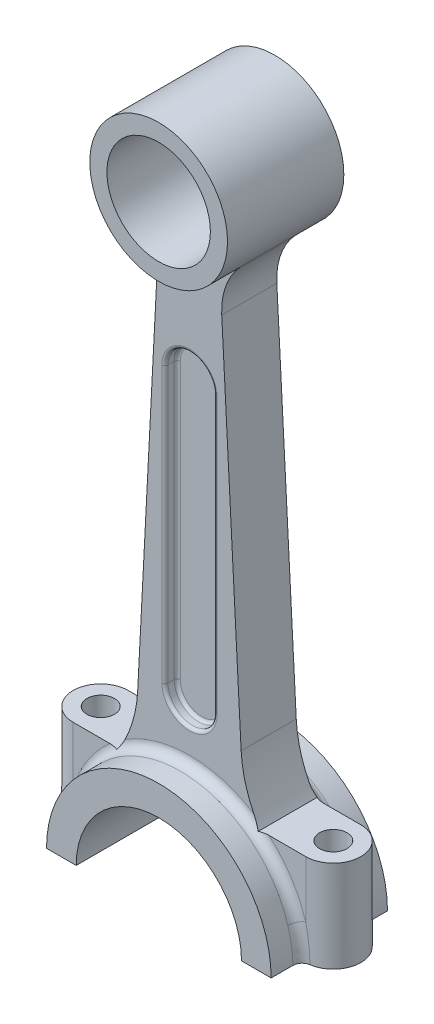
ISO-10303-21;
HEADER;
FILE_DESCRIPTION(('STEP AP214'),'2;1');
FILE_NAME('part.step','',(''),(''),'','','');
FILE_SCHEMA(('AUTOMOTIVE_DESIGN { 1 0 10303 214 1 1 1 1 }'));
ENDSEC;
DATA;
#1=APPLICATION_CONTEXT('core data for automotive mechanical design processes');
#2=APPLICATION_PROTOCOL_DEFINITION('international standard','automotive_design',2000,#1);
#3=PRODUCT_CONTEXT('',#1,'mechanical');
#4=PRODUCT('Part','Part','',(#3));
#5=PRODUCT_RELATED_PRODUCT_CATEGORY('part','',(#4));
#6=PRODUCT_DEFINITION_FORMATION('','',#4);
#7=PRODUCT_DEFINITION_CONTEXT('part definition',#1,'design');
#8=PRODUCT_DEFINITION('design','',#6,#7);
#9=PRODUCT_DEFINITION_SHAPE('','',#8);
#10=(LENGTH_UNIT() NAMED_UNIT(*) SI_UNIT(.MILLI.,.METRE.));
#11=(NAMED_UNIT(*) PLANE_ANGLE_UNIT() SI_UNIT($,.RADIAN.));
#12=(NAMED_UNIT(*) SI_UNIT($,.STERADIAN.) SOLID_ANGLE_UNIT());
#13=UNCERTAINTY_MEASURE_WITH_UNIT(LENGTH_MEASURE(1.E-05),#10,'distance_accuracy_value','');
#14=(GEOMETRIC_REPRESENTATION_CONTEXT(3) GLOBAL_UNCERTAINTY_ASSIGNED_CONTEXT((#13)) GLOBAL_UNIT_ASSIGNED_CONTEXT((#10,
#11,#12)) REPRESENTATION_CONTEXT('',''));
#15=CARTESIAN_POINT('',(0.,0.,0.));
#16=DIRECTION('',(0.,0.,1.));
#17=DIRECTION('',(1.,0.,0.));
#18=AXIS2_PLACEMENT_3D('',#15,#16,#17);
#19=CARTESIAN_POINT('',(0.,0.,-9.));
#20=DIRECTION('',(0.,0.,1.));
#21=DIRECTION('',(1.,0.,0.));
#22=AXIS2_PLACEMENT_3D('',#19,#20,#21);
#23=PLANE('',#22);
#24=DIRECTION('',(0.,1.,0.));
#25=VECTOR('',#24,1.);
#26=CARTESIAN_POINT('',(38.,-95.7078889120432,-9.));
#27=LINE('',#26,#25);
#28=CARTESIAN_POINT('',(38.,11.4747082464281,-9.));
#29=VERTEX_POINT('',#28);
#30=CARTESIAN_POINT('',(38.,30.,-9.));
#31=VERTEX_POINT('',#30);
#32=EDGE_CURVE('E343',#29,#31,#27,.T.);
#33=ORIENTED_EDGE('',*,*,#32,.F.);
#34=CARTESIAN_POINT('',(0.,0.,-9.));
#35=DIRECTION('',(0.,0.,1.));
#36=DIRECTION('',(1.,0.,0.));
#37=AXIS2_PLACEMENT_3D('',#34,#35,#36);
#38=CIRCLE('',#37,39.6946964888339);
#39=CARTESIAN_POINT('',(25.9936324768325,30.,-9.));
#40=VERTEX_POINT('',#39);
#41=EDGE_CURVE('E797',#29,#40,#38,.T.);
#42=ORIENTED_EDGE('',*,*,#41,.T.);
#43=DIRECTION('',(1.,0.,0.));
#44=VECTOR('',#43,1.);
#45=CARTESIAN_POINT('',(38.,30.,-9.));
#46=LINE('',#45,#44);
#47=EDGE_CURVE('E355',#40,#31,#46,.T.);
#48=ORIENTED_EDGE('',*,*,#47,.T.);
#49=EDGE_LOOP('',(#33,#42,#48));
#50=FACE_BOUND('',#49,.T.);
#51=ADVANCED_FACE('F44',(#50),#23,.F.);
#52=DIRECTION('',(0.,-1.,0.));
#53=VECTOR('',#52,1.);
#54=CARTESIAN_POINT('',(-9.00000000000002,55.6,-9.));
#55=LINE('',#54,#53);
#56=CARTESIAN_POINT('',(-9.00000000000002,145.6,-9.));
#57=VERTEX_POINT('',#56);
#58=CARTESIAN_POINT('',(-9.00000000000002,55.6,-9.));
#59=VERTEX_POINT('',#58);
#60=EDGE_CURVE('E477',#57,#59,#55,.T.);
#61=ORIENTED_EDGE('',*,*,#60,.T.);
#62=CARTESIAN_POINT('',(0.,55.6,-9.));
#63=DIRECTION('',(0.,0.,1.));
#64=DIRECTION('',(1.,0.,0.));
#65=AXIS2_PLACEMENT_3D('',#62,#63,#64);
#66=CIRCLE('',#65,9.);
#67=CARTESIAN_POINT('',(8.99999999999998,55.6,-9.));
#68=VERTEX_POINT('',#67);
#69=EDGE_CURVE('E479',#59,#68,#66,.T.);
#70=ORIENTED_EDGE('',*,*,#69,.T.);
#71=DIRECTION('',(0.,1.,0.));
#72=VECTOR('',#71,1.);
#73=CARTESIAN_POINT('',(8.99999999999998,145.6,-9.));
#74=LINE('',#73,#72);
#75=CARTESIAN_POINT('',(8.99999999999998,145.6,-9.));
#76=VERTEX_POINT('',#75);
#77=EDGE_CURVE('E473',#68,#76,#74,.T.);
#78=ORIENTED_EDGE('',*,*,#77,.T.);
#79=CARTESIAN_POINT('',(0.,145.6,-9.));
#80=DIRECTION('',(0.,0.,1.));
#81=DIRECTION('',(1.,0.,0.));
#82=AXIS2_PLACEMENT_3D('',#79,#80,#81);
#83=CIRCLE('',#82,9.);
#84=EDGE_CURVE('E475',#76,#57,#83,.T.);
#85=ORIENTED_EDGE('',*,*,#84,.T.);
#86=EDGE_LOOP('',(#61,#70,#78,#85));
#87=FACE_BOUND('',#86,.T.);
#88=CARTESIAN_POINT('',(56.8323077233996,51.4991773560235,-9.));
#89=DIRECTION('',(0.,0.,1.));
#90=DIRECTION('',(1.,0.,0.));
#91=AXIS2_PLACEMENT_3D('',#88,#89,#90);
#92=CIRCLE('',#91,40.);
#93=CARTESIAN_POINT('',(16.8879230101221,49.390592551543,-9.));
#94=VERTEX_POINT('',#93);
#95=CARTESIAN_POINT('',(21.0264114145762,33.6683672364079,-9.));
#96=VERTEX_POINT('',#95);
#97=EDGE_CURVE('E571',#94,#96,#92,.T.);
#98=ORIENTED_EDGE('',*,*,#97,.T.);
#99=CARTESIAN_POINT('',(0.,0.,-9.));
#100=DIRECTION('',(0.,0.,1.));
#101=DIRECTION('',(1.,0.,0.));
#102=AXIS2_PLACEMENT_3D('',#99,#100,#101);
#103=CIRCLE('',#102,39.6946964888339);
#104=CARTESIAN_POINT('',(-21.0427333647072,33.6581684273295,-9.));
#105=VERTEX_POINT('',#104);
#106=EDGE_CURVE('E794',#96,#105,#103,.T.);
#107=ORIENTED_EDGE('',*,*,#106,.T.);
#108=CARTESIAN_POINT('',(-56.8572708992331,51.471615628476,-9.));
#109=DIRECTION('',(0.,0.,1.));
#110=DIRECTION('',(1.,0.,0.));
#111=AXIS2_PLACEMENT_3D('',#108,#109,#110);
#112=CIRCLE('',#111,40.);
#113=CARTESIAN_POINT('',(-16.9112985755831,49.3933242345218,-9.));
#114=VERTEX_POINT('',#113);
#115=EDGE_CURVE('E566',#105,#114,#112,.T.);
#116=ORIENTED_EDGE('',*,*,#115,.T.);
#117=DIRECTION('',(-0.0519572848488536,-0.998649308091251,0.));
#118=VECTOR('',#117,1.);
#119=CARTESIAN_POINT('',(-19.4285221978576,1.01081856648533,-9.));
#120=LINE('',#119,#118);
#121=CARTESIAN_POINT('',(-10.6618127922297,169.51208470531,-9.));
#122=VERTEX_POINT('',#121);
#123=EDGE_CURVE('E414',#122,#114,#120,.T.);
#124=ORIENTED_EDGE('',*,*,#123,.F.);
#125=CARTESIAN_POINT('',(-33.1314222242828,170.68112361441,-9.));
#126=DIRECTION('',(0.,0.,1.));
#127=DIRECTION('',(1.,0.,0.));
#128=AXIS2_PLACEMENT_3D('',#125,#126,#127);
#129=CIRCLE('',#128,22.5);
#130=CARTESIAN_POINT('',(-16.596619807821,185.940557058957,-9.));
#131=VERTEX_POINT('',#130);
#132=EDGE_CURVE('E593',#122,#131,#129,.T.);
#133=ORIENTED_EDGE('',*,*,#132,.T.);
#134=CARTESIAN_POINT('',(-0.0618173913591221,201.199990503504,-9.));
#135=DIRECTION('',(0.,0.,1.));
#136=DIRECTION('',(1.,0.,0.));
#137=AXIS2_PLACEMENT_3D('',#134,#135,#136);
#138=CIRCLE('',#137,22.5);
#139=CARTESIAN_POINT('',(16.477135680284,185.945055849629,-9.));
#140=VERTEX_POINT('',#139);
#141=EDGE_CURVE('E401',#131,#140,#138,.T.);
#142=ORIENTED_EDGE('',*,*,#141,.T.);
#143=CARTESIAN_POINT('',(33.0160887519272,170.690121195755,-9.));
#144=DIRECTION('',(0.,0.,1.));
#145=DIRECTION('',(1.,0.,0.));
#146=AXIS2_PLACEMENT_3D('',#143,#144,#145);
#147=CIRCLE('',#146,22.5);
#148=CARTESIAN_POINT('',(10.5473723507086,169.504042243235,-9.));
#149=VERTEX_POINT('',#148);
#150=EDGE_CURVE('E588',#140,#149,#147,.T.);
#151=ORIENTED_EDGE('',*,*,#150,.T.);
#152=DIRECTION('',(0.0527146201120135,-0.998609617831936,0.));
#153=VECTOR('',#152,1.);
#154=CARTESIAN_POINT('',(19.4409806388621,1.0262507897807,-9.));
#155=LINE('',#154,#153);
#156=EDGE_CURVE('E407',#149,#94,#155,.T.);
#157=ORIENTED_EDGE('',*,*,#156,.T.);
#158=EDGE_LOOP('',(#98,#107,#116,#124,#133,#142,#151,#157));
#159=FACE_BOUND('',#158,.T.);
#160=ADVANCED_FACE('F762',(#87,#159),#23,.F.);
#161=CARTESIAN_POINT('',(0.,0.,9.));
#162=DIRECTION('',(0.,0.,1.));
#163=DIRECTION('',(1.,0.,0.));
#164=AXIS2_PLACEMENT_3D('',#161,#162,#163);
#165=PLANE('',#164);
#166=DIRECTION('',(0.,1.,0.));
#167=VECTOR('',#166,1.);
#168=CARTESIAN_POINT('',(-38.,-95.7078889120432,8.99999999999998));
#169=LINE('',#168,#167);
#170=CARTESIAN_POINT('',(-38.,11.474708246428,8.99999999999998));
#171=VERTEX_POINT('',#170);
#172=CARTESIAN_POINT('',(-38.,30.,8.99999999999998));
#173=VERTEX_POINT('',#172);
#174=EDGE_CURVE('E328',#171,#173,#169,.T.);
#175=ORIENTED_EDGE('',*,*,#174,.F.);
#176=CARTESIAN_POINT('',(0.,0.,9.));
#177=DIRECTION('',(0.,0.,1.));
#178=DIRECTION('',(1.,0.,0.));
#179=AXIS2_PLACEMENT_3D('',#176,#177,#178);
#180=CIRCLE('',#179,39.6946964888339);
#181=CARTESIAN_POINT('',(-25.9936324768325,30.,9.));
#182=VERTEX_POINT('',#181);
#183=EDGE_CURVE('E1308',#171,#182,#180,.F.);
#184=ORIENTED_EDGE('',*,*,#183,.T.);
#185=DIRECTION('',(-1.,0.,0.));
#186=VECTOR('',#185,1.);
#187=CARTESIAN_POINT('',(38.,30.,9.));
#188=LINE('',#187,#186);
#189=EDGE_CURVE('E338',#182,#173,#188,.T.);
#190=ORIENTED_EDGE('',*,*,#189,.T.);
#191=EDGE_LOOP('',(#175,#184,#190));
#192=FACE_BOUND('',#191,.T.);
#193=ADVANCED_FACE('F769',(#192),#165,.T.);
#194=DIRECTION('',(0.,1.,0.));
#195=VECTOR('',#194,1.);
#196=CARTESIAN_POINT('',(8.99999999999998,55.6,9.));
#197=LINE('',#196,#195);
#198=CARTESIAN_POINT('',(8.99999999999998,145.6,9.));
#199=VERTEX_POINT('',#198);
#200=CARTESIAN_POINT('',(8.99999999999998,55.6,9.));
#201=VERTEX_POINT('',#200);
#202=EDGE_CURVE('E505',#199,#201,#197,.F.);
#203=ORIENTED_EDGE('',*,*,#202,.T.);
#204=CARTESIAN_POINT('',(0.,55.6,9.));
#205=DIRECTION('',(0.,0.,1.));
#206=DIRECTION('',(1.,0.,0.));
#207=AXIS2_PLACEMENT_3D('',#204,#205,#206);
#208=CIRCLE('',#207,9.);
#209=CARTESIAN_POINT('',(-9.00000000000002,55.6,9.));
#210=VERTEX_POINT('',#209);
#211=EDGE_CURVE('E511',#201,#210,#208,.F.);
#212=ORIENTED_EDGE('',*,*,#211,.T.);
#213=DIRECTION('',(0.,-1.,0.));
#214=VECTOR('',#213,1.);
#215=CARTESIAN_POINT('',(-9.00000000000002,145.6,9.));
#216=LINE('',#215,#214);
#217=CARTESIAN_POINT('',(-9.00000000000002,145.6,9.));
#218=VERTEX_POINT('',#217);
#219=EDGE_CURVE('E509',#210,#218,#216,.F.);
#220=ORIENTED_EDGE('',*,*,#219,.T.);
#221=CARTESIAN_POINT('',(0.,145.6,9.));
#222=DIRECTION('',(0.,0.,1.));
#223=DIRECTION('',(1.,0.,0.));
#224=AXIS2_PLACEMENT_3D('',#221,#222,#223);
#225=CIRCLE('',#224,9.);
#226=EDGE_CURVE('E507',#218,#199,#225,.F.);
#227=ORIENTED_EDGE('',*,*,#226,.T.);
#228=EDGE_LOOP('',(#203,#212,#220,#227));
#229=FACE_BOUND('',#228,.T.);
#230=CARTESIAN_POINT('',(-56.8572708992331,51.471615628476,9.));
#231=DIRECTION('',(0.,0.,1.));
#232=DIRECTION('',(1.,0.,0.));
#233=AXIS2_PLACEMENT_3D('',#230,#231,#232);
#234=CIRCLE('',#233,40.);
#235=CARTESIAN_POINT('',(-16.9112985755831,49.3933242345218,9.));
#236=VERTEX_POINT('',#235);
#237=CARTESIAN_POINT('',(-21.0427333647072,33.6581684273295,9.));
#238=VERTEX_POINT('',#237);
#239=EDGE_CURVE('E568',#236,#238,#234,.F.);
#240=ORIENTED_EDGE('',*,*,#239,.T.);
#241=CARTESIAN_POINT('',(0.,0.,9.));
#242=DIRECTION('',(0.,0.,1.));
#243=DIRECTION('',(1.,0.,0.));
#244=AXIS2_PLACEMENT_3D('',#241,#242,#243);
#245=CIRCLE('',#244,39.6946964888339);
#246=CARTESIAN_POINT('',(21.0264114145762,33.6683672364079,9.));
#247=VERTEX_POINT('',#246);
#248=EDGE_CURVE('E815',#238,#247,#245,.F.);
#249=ORIENTED_EDGE('',*,*,#248,.T.);
#250=CARTESIAN_POINT('',(56.8323077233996,51.4991773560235,9.));
#251=DIRECTION('',(0.,0.,1.));
#252=DIRECTION('',(1.,0.,0.));
#253=AXIS2_PLACEMENT_3D('',#250,#251,#252);
#254=CIRCLE('',#253,40.);
#255=CARTESIAN_POINT('',(16.8879230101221,49.390592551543,9.));
#256=VERTEX_POINT('',#255);
#257=EDGE_CURVE('E574',#247,#256,#254,.F.);
#258=ORIENTED_EDGE('',*,*,#257,.T.);
#259=DIRECTION('',(0.0527146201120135,-0.998609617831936,0.));
#260=VECTOR('',#259,1.);
#261=CARTESIAN_POINT('',(19.4409806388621,1.0262507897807,9.));
#262=LINE('',#261,#260);
#263=CARTESIAN_POINT('',(10.5473723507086,169.504042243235,9.));
#264=VERTEX_POINT('',#263);
#265=EDGE_CURVE('E409',#264,#256,#262,.T.);
#266=ORIENTED_EDGE('',*,*,#265,.F.);
#267=CARTESIAN_POINT('',(33.0160887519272,170.690121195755,9.));
#268=DIRECTION('',(0.,0.,1.));
#269=DIRECTION('',(1.,0.,0.));
#270=AXIS2_PLACEMENT_3D('',#267,#268,#269);
#271=CIRCLE('',#270,22.5);
#272=CARTESIAN_POINT('',(16.477135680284,185.945055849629,9.));
#273=VERTEX_POINT('',#272);
#274=EDGE_CURVE('E590',#264,#273,#271,.F.);
#275=ORIENTED_EDGE('',*,*,#274,.T.);
#276=CARTESIAN_POINT('',(-0.0618173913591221,201.199990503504,9.));
#277=DIRECTION('',(0.,0.,1.));
#278=DIRECTION('',(1.,0.,0.));
#279=AXIS2_PLACEMENT_3D('',#276,#277,#278);
#280=CIRCLE('',#279,22.5);
#281=CARTESIAN_POINT('',(-16.596619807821,185.940557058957,9.));
#282=VERTEX_POINT('',#281);
#283=EDGE_CURVE('E404',#282,#273,#280,.T.);
#284=ORIENTED_EDGE('',*,*,#283,.F.);
#285=CARTESIAN_POINT('',(-33.1314222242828,170.68112361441,9.));
#286=DIRECTION('',(0.,0.,1.));
#287=DIRECTION('',(1.,0.,0.));
#288=AXIS2_PLACEMENT_3D('',#285,#286,#287);
#289=CIRCLE('',#288,22.5);
#290=CARTESIAN_POINT('',(-10.6618127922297,169.51208470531,9.));
#291=VERTEX_POINT('',#290);
#292=EDGE_CURVE('E596',#282,#291,#289,.F.);
#293=ORIENTED_EDGE('',*,*,#292,.T.);
#294=DIRECTION('',(-0.0519572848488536,-0.998649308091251,0.));
#295=VECTOR('',#294,1.);
#296=CARTESIAN_POINT('',(-19.4285221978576,1.01081856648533,9.));
#297=LINE('',#296,#295);
#298=EDGE_CURVE('E406',#291,#236,#297,.T.);
#299=ORIENTED_EDGE('',*,*,#298,.T.);
#300=EDGE_LOOP('',(#240,#249,#258,#266,#275,#284,#293,#299));
#301=FACE_BOUND('',#300,.T.);
#302=ADVANCED_FACE('F819',(#229,#301),#165,.T.);
#303=CARTESIAN_POINT('',(0.,0.,19.));
#304=DIRECTION('',(0.,1.,0.));
#305=DIRECTION('',(-1.,0.,0.));
#306=AXIS2_PLACEMENT_3D('',#303,#304,#305);
#307=PLANE('',#306);
#308=CARTESIAN_POINT('',(38.,0.,0.));
#309=DIRECTION('',(0.,-1.,0.));
#310=DIRECTION('',(1.,0.,0.));
#311=AXIS2_PLACEMENT_3D('',#308,#309,#310);
#312=CIRCLE('',#311,4.5);
#313=CARTESIAN_POINT('',(42.5,0.,0.));
#314=VERTEX_POINT('',#313);
#315=EDGE_CURVE('E1260',#314,#314,#312,.T.);
#316=ORIENTED_EDGE('',*,*,#315,.F.);
#317=EDGE_LOOP('',(#316));
#318=FACE_BOUND('',#317,.T.);
#319=DIRECTION('',(0.,0.,-1.));
#320=VECTOR('',#319,1.);
#321=CARTESIAN_POINT('',(27.,0.,19.));
#322=LINE('',#321,#320);
#323=CARTESIAN_POINT('',(27.,0.,19.));
#324=VERTEX_POINT('',#323);
#325=CARTESIAN_POINT('',(27.,0.,-19.));
#326=VERTEX_POINT('',#325);
#327=EDGE_CURVE('E442',#324,#326,#322,.T.);
#328=ORIENTED_EDGE('',*,*,#327,.T.);
#329=DIRECTION('',(1.,0.,0.));
#330=VECTOR('',#329,1.);
#331=CARTESIAN_POINT('',(0.,0.,-19.));
#332=LINE('',#331,#330);
#333=CARTESIAN_POINT('',(36.6946964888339,0.,-19.));
#334=VERTEX_POINT('',#333);
#335=EDGE_CURVE('E422',#326,#334,#332,.T.);
#336=ORIENTED_EDGE('',*,*,#335,.T.);
#337=DIRECTION('',(0.,0.,-1.));
#338=VECTOR('',#337,1.);
#339=CARTESIAN_POINT('',(36.6946964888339,0.,19.));
#340=LINE('',#339,#338);
#341=CARTESIAN_POINT('',(36.6946964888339,0.,-11.879730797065));
#342=VERTEX_POINT('',#341);
#343=EDGE_CURVE('E428',#342,#334,#340,.T.);
#344=ORIENTED_EDGE('',*,*,#343,.F.);
#345=CARTESIAN_POINT('',(39.6946964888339,0.,-11.879730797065));
#346=DIRECTION('',(0.,1.,0.));
#347=DIRECTION('',(-1.,0.,0.));
#348=AXIS2_PLACEMENT_3D('',#345,#346,#347);
#349=CIRCLE('',#348,3.);
#350=CARTESIAN_POINT('',(39.2710223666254,0.,-8.90979809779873));
#351=VERTEX_POINT('',#350);
#352=EDGE_CURVE('E1193',#342,#351,#349,.T.);
#353=ORIENTED_EDGE('',*,*,#352,.T.);
#354=CARTESIAN_POINT('',(38.,0.,0.));
#355=DIRECTION('',(0.,1.,0.));
#356=DIRECTION('',(-1.,0.,0.));
#357=AXIS2_PLACEMENT_3D('',#354,#355,#356);
#358=CIRCLE('',#357,9.);
#359=CARTESIAN_POINT('',(39.2710223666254,0.,8.90979809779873));
#360=VERTEX_POINT('',#359);
#361=EDGE_CURVE('E350',#360,#351,#358,.T.);
#362=ORIENTED_EDGE('',*,*,#361,.F.);
#363=CARTESIAN_POINT('',(39.6946964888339,0.,11.879730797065));
#364=DIRECTION('',(0.,1.,0.));
#365=DIRECTION('',(-1.,0.,0.));
#366=AXIS2_PLACEMENT_3D('',#363,#364,#365);
#367=CIRCLE('',#366,3.);
#368=CARTESIAN_POINT('',(36.6946964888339,0.,11.879730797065));
#369=VERTEX_POINT('',#368);
#370=EDGE_CURVE('E740',#360,#369,#367,.T.);
#371=ORIENTED_EDGE('',*,*,#370,.T.);
#372=CARTESIAN_POINT('',(36.6946964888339,0.,19.));
#373=VERTEX_POINT('',#372);
#374=EDGE_CURVE('E439',#373,#369,#340,.T.);
#375=ORIENTED_EDGE('',*,*,#374,.F.);
#376=DIRECTION('',(1.,0.,0.));
#377=VECTOR('',#376,1.);
#378=CARTESIAN_POINT('',(0.,0.,19.));
#379=LINE('',#378,#377);
#380=EDGE_CURVE('E426',#324,#373,#379,.T.);
#381=ORIENTED_EDGE('',*,*,#380,.F.);
#382=EDGE_LOOP('',(#328,#336,#344,#353,#362,#371,#375,#381));
#383=FACE_BOUND('',#382,.T.);
#384=ADVANCED_FACE('F783',(#318,#383),#307,.F.);
#385=CARTESIAN_POINT('',(0.,0.,19.));
#386=DIRECTION('',(0.,0.,-1.));
#387=DIRECTION('',(-1.,0.,0.));
#388=AXIS2_PLACEMENT_3D('',#385,#386,#387);
#389=CYLINDRICAL_SURFACE('',#388,36.6946964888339);
#390=DIRECTION('',(0.,0.,-1.));
#391=VECTOR('',#390,1.);
#392=CARTESIAN_POINT('',(-36.6946964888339,0.,19.));
#393=LINE('',#392,#391);
#394=CARTESIAN_POINT('',(-36.6946964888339,0.,-11.879730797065));
#395=VERTEX_POINT('',#394);
#396=CARTESIAN_POINT('',(-36.6946964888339,0.,-19.));
#397=VERTEX_POINT('',#396);
#398=EDGE_CURVE('E446',#395,#397,#393,.T.);
#399=ORIENTED_EDGE('',*,*,#398,.F.);
#400=CARTESIAN_POINT('',(-37.2455732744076,14.3911662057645,-8.96832427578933));
#401=CARTESIAN_POINT('',(-34.234055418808,13.2113580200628,-8.71499160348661));
#402=CARTESIAN_POINT('',(-34.1982004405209,13.3035272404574,-11.9577657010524));
#403=CARTESIAN_POINT('',(-37.3853323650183,13.9121563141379,-8.98005068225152));
#404=CARTESIAN_POINT('',(-34.3955473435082,12.792873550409,-8.77550313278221));
#405=CARTESIAN_POINT('',(-34.3704624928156,12.8607194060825,-11.9734009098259));
#406=CARTESIAN_POINT('',(-37.5181255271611,13.4294611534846,-8.98796530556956));
#407=CARTESIAN_POINT('',(-34.5520332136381,12.3642634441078,-8.8290398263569));
#408=CARTESIAN_POINT('',(-34.5341385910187,12.4145048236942,-11.983953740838));
#409=CARTESIAN_POINT('',(-37.769680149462,12.4570612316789,-8.9979397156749));
#410=CARTESIAN_POINT('',(-34.8505003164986,11.4957008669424,-8.92326560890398));
#411=CARTESIAN_POINT('',(-34.8441958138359,11.515595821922,-11.9972529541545));
#412=CARTESIAN_POINT('',(-37.888430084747,11.9673510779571,-8.9999947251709));
#413=CARTESIAN_POINT('',(-34.9928781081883,11.0552680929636,-8.96418391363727));
#414=CARTESIAN_POINT('',(-34.9905627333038,11.0628964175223,-11.9999929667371));
#415=CARTESIAN_POINT('',(-38.219926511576,10.5036111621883,-9.00001039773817));
#416=CARTESIAN_POINT('',(-35.389945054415,9.74019982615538,-9.0693703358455));
#417=CARTESIAN_POINT('',(-35.3991533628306,9.70978134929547,-12.0000138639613));
#418=CARTESIAN_POINT('',(-38.4119541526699,9.52111878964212,-8.99205629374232));
#419=CARTESIAN_POINT('',(-35.626069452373,8.84130700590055,-9.11989931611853));
#420=CARTESIAN_POINT('',(-35.635839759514,8.80154265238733,-11.989408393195));
#421=CARTESIAN_POINT('',(-38.7390573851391,7.53903352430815,-8.97110524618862));
#422=CARTESIAN_POINT('',(-36.0286805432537,7.02078792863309,-9.19458601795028));
#423=CARTESIAN_POINT('',(-36.0390154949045,6.96925714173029,-11.9614736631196));
#424=CARTESIAN_POINT('',(-38.8741043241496,6.53943229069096,-8.95810577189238));
#425=CARTESIAN_POINT('',(-36.1974592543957,6.0942967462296,-9.21938804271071));
#426=CARTESIAN_POINT('',(-36.2054695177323,6.0452026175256,-11.9441410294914));
#427=CARTESIAN_POINT('',(-39.0334090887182,5.0309447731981,-8.94062457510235));
#428=CARTESIAN_POINT('',(-36.3966866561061,4.69107464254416,-9.24541862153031));
#429=CARTESIAN_POINT('',(-36.4018228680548,4.65072183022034,-11.920832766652));
#430=CARTESIAN_POINT('',(-39.0793281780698,4.52600210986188,-8.93512857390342));
#431=CARTESIAN_POINT('',(-36.4541754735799,4.22142867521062,-9.2522512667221));
#432=CARTESIAN_POINT('',(-36.4584210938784,4.18394114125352,-11.9135047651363));
#433=CARTESIAN_POINT('',(-39.1565818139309,3.51412596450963,-8.92546230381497));
#434=CARTESIAN_POINT('',(-36.5508926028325,3.27974175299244,-9.2631265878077));
#435=CARTESIAN_POINT('',(-36.5536411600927,3.24853940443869,-11.9006164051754));
#436=CARTESIAN_POINT('',(-39.187917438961,3.00719263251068,-8.92129193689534));
#437=CARTESIAN_POINT('',(-36.5902654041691,2.80701526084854,-9.26718845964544));
#438=CARTESIAN_POINT('',(-36.5922643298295,2.77991849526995,-11.8950559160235));
#439=CARTESIAN_POINT('',(-39.2359541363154,1.99211007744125,-8.91476274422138));
#440=CARTESIAN_POINT('',(-36.6505735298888,1.86037451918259,-9.27320896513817));
#441=CARTESIAN_POINT('',(-36.6514726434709,1.84155267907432,-11.8863503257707));
#442=CARTESIAN_POINT('',(-39.252656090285,1.48396092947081,-8.91240380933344));
#443=CARTESIAN_POINT('',(-36.6715996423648,1.38576126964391,-9.27517731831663));
#444=CARTESIAN_POINT('',(-36.6720588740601,1.37180784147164,-11.8832050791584));
#445=CARTESIAN_POINT('',(-39.2714030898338,0.467207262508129,-8.90974884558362));
#446=CARTESIAN_POINT('',(-36.695168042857,0.436525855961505,-9.27737318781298));
#447=CARTESIAN_POINT('',(-36.6951657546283,0.431897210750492,-11.879665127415));
#448=CARTESIAN_POINT('',(-39.2734491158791,-0.0413972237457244,-8.90945267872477));
#449=CARTESIAN_POINT('',(-36.6977466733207,-0.0388020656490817,-9.27760410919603));
#450=CARTESIAN_POINT('',(-36.6976876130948,-0.0382685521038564,-11.8792702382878));
#451=CARTESIAN_POINT('',(-39.2623840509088,-1.10631881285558,-8.91102857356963));
#452=CARTESIAN_POINT('',(-36.6838315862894,-1.03316316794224,-9.27632054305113));
#453=CARTESIAN_POINT('',(-36.6840492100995,-1.0227067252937,-11.8813714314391));
#454=CARTESIAN_POINT('',(-39.2478245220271,-1.66260957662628,-8.91310786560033));
#455=CARTESIAN_POINT('',(-36.6654899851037,-1.55294697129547,-9.27463698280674));
#456=CARTESIAN_POINT('',(-36.6661036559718,-1.53695478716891,-11.884143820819));
#457=CARTESIAN_POINT('',(-39.2011771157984,-2.77386455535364,-8.91951367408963));
#458=CARTESIAN_POINT('',(-36.6069075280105,-2.58956191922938,-9.26888509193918));
#459=CARTESIAN_POINT('',(-36.6086077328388,-2.56422461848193,-11.8926848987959));
#460=CARTESIAN_POINT('',(-39.1690889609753,-3.32882874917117,-8.92384022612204));
#461=CARTESIAN_POINT('',(-36.5665619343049,-3.10731145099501,-9.26480591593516));
#462=CARTESIAN_POINT('',(-36.5690570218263,-3.07724636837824,-11.8984536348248));
#463=CARTESIAN_POINT('',(-39.0874369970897,-4.43653278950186,-8.93415771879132));
#464=CARTESIAN_POINT('',(-36.4642995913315,-4.13841502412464,-9.25345329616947));
#465=CARTESIAN_POINT('',(-36.4684157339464,-4.10123363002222,-11.9122102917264));
#466=CARTESIAN_POINT('',(-39.0378702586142,-4.98927224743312,-8.940148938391));
#467=CARTESIAN_POINT('',(-36.4021977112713,-4.65266936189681,-9.24615581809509));
#468=CARTESIAN_POINT('',(-36.4073215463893,-4.61219878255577,-11.9201985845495));
#469=CARTESIAN_POINT('',(-38.9213511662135,-6.09146579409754,-8.95290701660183));
#470=CARTESIAN_POINT('',(-36.2569090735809,-5.6751564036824,-9.22713808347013));
#471=CARTESIAN_POINT('',(-36.2637042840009,-5.63109201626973,-11.9372093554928));
#472=CARTESIAN_POINT('',(-38.8543988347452,-6.64091988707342,-8.9596738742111));
#473=CARTESIAN_POINT('',(-36.1734660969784,-6.18426337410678,-9.21537428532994));
#474=CARTESIAN_POINT('',(-36.181181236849,-6.13902010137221,-11.9462318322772));
#475=CARTESIAN_POINT('',(-38.7032132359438,-7.73567588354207,-8.97280628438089));
#476=CARTESIAN_POINT('',(-35.9861272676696,-7.19495971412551,-9.18579767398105));
#477=CARTESIAN_POINT('',(-35.9948352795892,-7.15103789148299,-11.9637417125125));
#478=CARTESIAN_POINT('',(-38.6189775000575,-8.28097718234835,-8.97917177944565));
#479=CARTESIAN_POINT('',(-35.8819012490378,-7.69738446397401,-9.16791010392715));
#480=CARTESIAN_POINT('',(-35.891009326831,-7.6551270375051,-11.9722290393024));
#481=CARTESIAN_POINT('',(-38.4333771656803,-9.36639385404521,-8.99003937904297));
#482=CARTESIAN_POINT('',(-35.6538505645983,-8.69299922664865,-9.12410038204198));
#483=CARTESIAN_POINT('',(-35.6622449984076,-8.65851133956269,-11.9867191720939));
#484=CARTESIAN_POINT('',(-38.3320129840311,-9.90650935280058,-8.99454152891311));
#485=CARTESIAN_POINT('',(-35.5296334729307,-9.18697748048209,-9.09806118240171));
#486=CARTESIAN_POINT('',(-35.5373071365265,-9.15780661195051,-11.9927220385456));
#487=CARTESIAN_POINT('',(-38.112330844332,-10.980592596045,-8.99997315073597));
#488=CARTESIAN_POINT('',(-35.2626473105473,-10.1639255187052,-9.03562151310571));
#489=CARTESIAN_POINT('',(-35.2665347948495,-10.1507140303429,-11.9999642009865));
#490=CARTESIAN_POINT('',(-37.994013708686,-11.5145606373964,-9.00090279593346));
#491=CARTESIAN_POINT('',(-35.1194279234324,-10.6476215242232,-8.99904537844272));
#492=CARTESIAN_POINT('',(-35.1207013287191,-10.6443264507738,-12.0012037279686));
#493=CARTESIAN_POINT('',(-37.740644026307,-12.5754078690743,-8.99714135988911));
#494=CARTESIAN_POINT('',(-34.8158853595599,-11.6022281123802,-8.91294741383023));
#495=CARTESIAN_POINT('',(-34.8084069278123,-11.6249981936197,-11.9961884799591));
#496=CARTESIAN_POINT('',(-37.6055897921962,-13.1022863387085,-8.99244971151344));
#497=CARTESIAN_POINT('',(-34.6550647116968,-12.0737821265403,-8.8631724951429));
#498=CARTESIAN_POINT('',(-34.6419439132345,-12.1120568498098,-11.9899329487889));
#499=CARTESIAN_POINT('',(-37.4622900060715,-13.6250821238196,-8.98392274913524));
#500=CARTESIAN_POINT('',(-34.4876905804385,-12.5341213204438,-8.80588561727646));
#501=CARTESIAN_POINT('',(-34.4653177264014,-12.5953413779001,-11.9785636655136));
#502=(BOUNDED_SURFACE() B_SPLINE_SURFACE(3,2,((#400,#401,#402),(#403,#404,#405),(#406,#407,
#408),(#409,#410,#411),(#412,#413,#414),(#415,#416,#417),(#418,#419,#420),(#421,#422,#423),
(#424,#425,#426),(#427,#428,#429),(#430,#431,#432),(#433,#434,#435),(#436,#437,#438),(#439,#440,
#441),(#442,#443,#444),(#445,#446,#447),(#448,#449,#450),(#451,#452,#453),(#454,#455,#456),
(#457,#458,#459),(#460,#461,#462),(#463,#464,#465),(#466,#467,#468),(#469,#470,#471),(#472,#473,
#474),(#475,#476,#477),(#478,#479,#480),(#481,#482,#483),(#484,#485,#486),(#487,#488,#489),
(#490,#491,#492),(#493,#494,#495),(#496,#497,#498),(#499,#500,#501)),.UNSPECIFIED.,.F.,.F.,
.F.) B_SPLINE_SURFACE_WITH_KNOTS((4,2,2,2,2,2,2,2,2,2,2,2,2,2,2,2,4),(3,3),(0.,1.54237954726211,
3.0860162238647,6.12883138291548,9.17317478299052,10.6989395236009,12.2245914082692,
13.7501513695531,15.2756092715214,16.9450088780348,18.6144349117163,20.2841408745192,
21.9538446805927,23.623787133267,25.2936889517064,26.963509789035,28.6334991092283),(0.,1.),
.UNSPECIFIED.) GEOMETRIC_REPRESENTATION_ITEM() RATIONAL_B_SPLINE_SURFACE(((1.,0.678924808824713,
1.),(1.,0.684109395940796,1.),(1.,0.689055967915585,1.),(1.,0.69845700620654,1.),(1.,
0.70291106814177,1.),(1.,0.715377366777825,1.),(1.,0.722644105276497,1.),(1.,0.735060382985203,
1.),(1.,0.740208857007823,1.),(1.,0.746292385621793,1.),(1.,0.748048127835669,1.),(1.,
0.751003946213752,1.),(1.,0.752204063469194,1.),(1.,0.754044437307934,1.),(1.,0.754684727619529,
1.),(1.,0.755403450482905,1.),(1.,0.755481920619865,1.),(1.,0.755057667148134,1.),(1.,
0.754499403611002,1.),(1.,0.752711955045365,1.),(1.,0.751482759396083,1.),(1.,0.748358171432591,
1.),(1.,0.746462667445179,1.),(1.,0.742013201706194,1.),(1.,0.739459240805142,1.),(1.,
0.733702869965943,1.),(1.,0.730500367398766,1.),(1.,0.723460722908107,1.),(1.,0.71962359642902,
1.),(1.,0.711331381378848,1.),(1.,0.706876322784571,1.),(1.,0.697369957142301,1.),(1.,
0.69231858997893,1.),(1.,0.686980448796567,1.))) REPRESENTATION_ITEM('') SURFACE());
#503=CARTESIAN_POINT('',(-34.4653177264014,-12.5953413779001,-11.9785636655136));
#504=CARTESIAN_POINT('',(-34.6419439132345,-12.1120568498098,-11.9899329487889));
#505=CARTESIAN_POINT('',(-34.8084069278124,-11.6249981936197,-11.9961884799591));
#506=CARTESIAN_POINT('',(-35.1207013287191,-10.6443264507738,-12.0012037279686));
#507=CARTESIAN_POINT('',(-35.2665347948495,-10.1507140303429,-11.9999642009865));
#508=CARTESIAN_POINT('',(-35.5373071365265,-9.1578066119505,-11.9927220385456));
#509=CARTESIAN_POINT('',(-35.6622449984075,-8.65851133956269,-11.986719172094));
#510=CARTESIAN_POINT('',(-35.8910093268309,-7.6551270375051,-11.9722290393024));
#511=CARTESIAN_POINT('',(-35.9948352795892,-7.15103789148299,-11.9637417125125));
#512=CARTESIAN_POINT('',(-36.181181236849,-6.13902010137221,-11.9462318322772));
#513=CARTESIAN_POINT('',(-36.2637042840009,-5.63109201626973,-11.9372093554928));
#514=CARTESIAN_POINT('',(-36.4073215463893,-4.61219878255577,-11.9201985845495));
#515=CARTESIAN_POINT('',(-36.4684157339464,-4.10123363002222,-11.9122102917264));
#516=CARTESIAN_POINT('',(-36.5690570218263,-3.07724636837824,-11.8984536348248));
#517=CARTESIAN_POINT('',(-36.6086077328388,-2.56422461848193,-11.8926848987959));
#518=CARTESIAN_POINT('',(-36.6661036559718,-1.53695478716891,-11.884143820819));
#519=CARTESIAN_POINT('',(-36.6840492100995,-1.0227067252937,-11.8813714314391));
#520=CARTESIAN_POINT('',(-36.6976876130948,-0.0382685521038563,-11.8792702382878));
#521=CARTESIAN_POINT('',(-36.6951657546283,0.431897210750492,-11.879665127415));
#522=CARTESIAN_POINT('',(-36.6720588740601,1.37180784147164,-11.8832050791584));
#523=CARTESIAN_POINT('',(-36.6514726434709,1.84155267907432,-11.8863503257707));
#524=CARTESIAN_POINT('',(-36.5922643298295,2.77991849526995,-11.8950559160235));
#525=CARTESIAN_POINT('',(-36.5536411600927,3.24853940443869,-11.9006164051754));
#526=CARTESIAN_POINT('',(-36.4584210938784,4.18394114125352,-11.9135047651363));
#527=CARTESIAN_POINT('',(-36.4018228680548,4.65072183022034,-11.920832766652));
#528=CARTESIAN_POINT('',(-36.2054695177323,6.0452026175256,-11.9441410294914));
#529=CARTESIAN_POINT('',(-36.0390154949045,6.96925714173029,-11.9614736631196));
#530=CARTESIAN_POINT('',(-35.635839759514,8.80154265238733,-11.989408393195));
#531=CARTESIAN_POINT('',(-35.3991533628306,9.70978134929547,-12.0000138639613));
#532=CARTESIAN_POINT('',(-34.9905627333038,11.0628964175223,-11.9999929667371));
#533=CARTESIAN_POINT('',(-34.8441958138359,11.515595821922,-11.9972529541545));
#534=CARTESIAN_POINT('',(-34.5341385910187,12.4145048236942,-11.983953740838));
#535=CARTESIAN_POINT('',(-34.3704624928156,12.8607194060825,-11.9734009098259));
#536=CARTESIAN_POINT('',(-34.1982004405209,13.3035272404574,-11.9577657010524));
#537=B_SPLINE_CURVE_WITH_KNOTS('',3,(#503,#504,#505,#506,#507,#508,#509,#510,#511,#512,#513,
#514,#515,#516,#517,#518,#519,#520,#521,#522,#523,#524,#525,#526,#527,#528,#529,#530,#531,#532,
#533,#534,#535,#536),.UNSPECIFIED.,.F.,.F.,(4,2,2,2,2,2,2,2,2,2,2,2,2,2,2,2,4),(0.,
1.66998932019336,3.33981015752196,5.00971197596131,6.67965442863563,8.34935823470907,
10.019064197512,11.6884902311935,13.3578898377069,14.8833477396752,16.4089077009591,
17.9345595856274,19.4603243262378,22.5046677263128,25.5474828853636,27.0911195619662,
28.6334991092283),.UNSPECIFIED.);
#538=CARTESIAN_POINT('',(-35.1280798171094,10.607485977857,-12.));
#539=VERTEX_POINT('',#538);
#540=EDGE_CURVE('E795',#395,#539,#537,.T.);
#541=ORIENTED_EDGE('',*,*,#540,.T.);
#542=CARTESIAN_POINT('',(0.,0.,-12.));
#543=DIRECTION('',(0.,0.,1.));
#544=DIRECTION('',(1.,0.,0.));
#545=AXIS2_PLACEMENT_3D('',#542,#543,#544);
#546=CIRCLE('',#545,36.6946964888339);
#547=CARTESIAN_POINT('',(35.1280798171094,10.6074859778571,-12.));
#548=VERTEX_POINT('',#547);
#549=EDGE_CURVE('E800',#539,#548,#546,.F.);
#550=ORIENTED_EDGE('',*,*,#549,.T.);
#551=CARTESIAN_POINT('',(34.1982004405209,13.3035272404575,-11.9577657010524));
#552=CARTESIAN_POINT('',(34.234055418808,13.2113580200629,-8.7149916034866));
#553=CARTESIAN_POINT('',(37.2455732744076,14.3911662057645,-8.96832427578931));
#554=CARTESIAN_POINT('',(34.3704624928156,12.8607194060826,-11.9734009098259));
#555=CARTESIAN_POINT('',(34.3955473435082,12.792873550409,-8.77550313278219));
#556=CARTESIAN_POINT('',(37.3853323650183,13.9121563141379,-8.98005068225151));
#557=CARTESIAN_POINT('',(34.5341385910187,12.4145048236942,-11.983953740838));
#558=CARTESIAN_POINT('',(34.552033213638,12.3642634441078,-8.82903982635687));
#559=CARTESIAN_POINT('',(37.518125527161,13.4294611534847,-8.98796530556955));
#560=CARTESIAN_POINT('',(34.8441958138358,11.5155958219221,-11.9972529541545));
#561=CARTESIAN_POINT('',(34.8505003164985,11.4957008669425,-8.92326560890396));
#562=CARTESIAN_POINT('',(37.769680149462,12.457061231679,-8.99793971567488));
#563=CARTESIAN_POINT('',(34.9905627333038,11.0628964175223,-11.9999929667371));
#564=CARTESIAN_POINT('',(34.9928781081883,11.0552680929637,-8.96418391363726));
#565=CARTESIAN_POINT('',(37.8884300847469,11.9673510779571,-8.99999472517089));
#566=CARTESIAN_POINT('',(35.3991533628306,9.70978134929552,-12.0000138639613));
#567=CARTESIAN_POINT('',(35.389945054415,9.74019982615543,-9.06937033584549));
#568=CARTESIAN_POINT('',(38.219926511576,10.5036111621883,-9.00001039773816));
#569=CARTESIAN_POINT('',(35.635839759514,8.80154265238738,-11.989408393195));
#570=CARTESIAN_POINT('',(35.626069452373,8.84130700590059,-9.11989931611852));
#571=CARTESIAN_POINT('',(38.4119541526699,9.52111878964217,-8.99205629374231));
#572=CARTESIAN_POINT('',(36.0390154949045,6.96925714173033,-11.9614736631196));
#573=CARTESIAN_POINT('',(36.0286805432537,7.02078792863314,-9.19458601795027));
#574=CARTESIAN_POINT('',(38.7390573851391,7.5390335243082,-8.97110524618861));
#575=CARTESIAN_POINT('',(36.2054695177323,6.04520261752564,-11.9441410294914));
#576=CARTESIAN_POINT('',(36.1974592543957,6.09429674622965,-9.2193880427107));
#577=CARTESIAN_POINT('',(38.8741043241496,6.53943229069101,-8.95810577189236));
#578=CARTESIAN_POINT('',(36.4018228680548,4.65072183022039,-11.920832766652));
#579=CARTESIAN_POINT('',(36.3966866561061,4.69107464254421,-9.2454186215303));
#580=CARTESIAN_POINT('',(39.0334090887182,5.03094477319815,-8.94062457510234));
#581=CARTESIAN_POINT('',(36.4584210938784,4.18394114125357,-11.9135047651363));
#582=CARTESIAN_POINT('',(36.4541754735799,4.22142867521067,-9.25225126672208));
#583=CARTESIAN_POINT('',(39.0793281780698,4.52600210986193,-8.9351285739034));
#584=CARTESIAN_POINT('',(36.5536411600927,3.24853940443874,-11.9006164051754));
#585=CARTESIAN_POINT('',(36.5508926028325,3.27974175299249,-9.26312658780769));
#586=CARTESIAN_POINT('',(39.1565818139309,3.51412596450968,-8.92546230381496));
#587=CARTESIAN_POINT('',(36.5922643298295,2.77991849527,-11.8950559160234));
#588=CARTESIAN_POINT('',(36.590265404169,2.80701526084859,-9.26718845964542));
#589=CARTESIAN_POINT('',(39.187917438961,3.00719263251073,-8.92129193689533));
#590=CARTESIAN_POINT('',(36.6514726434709,1.84155267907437,-11.8863503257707));
#591=CARTESIAN_POINT('',(36.6505735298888,1.86037451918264,-9.27320896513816));
#592=CARTESIAN_POINT('',(39.2359541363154,1.9921100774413,-8.91476274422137));
#593=CARTESIAN_POINT('',(36.6720588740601,1.37180784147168,-11.8832050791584));
#594=CARTESIAN_POINT('',(36.6715996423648,1.38576126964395,-9.27517731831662));
#595=CARTESIAN_POINT('',(39.252656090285,1.48396092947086,-8.91240380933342));
#596=CARTESIAN_POINT('',(36.6951657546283,0.431897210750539,-11.879665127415));
#597=CARTESIAN_POINT('',(36.6951680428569,0.436525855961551,-9.27737318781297));
#598=CARTESIAN_POINT('',(39.2714030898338,0.467207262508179,-8.90974884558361));
#599=CARTESIAN_POINT('',(36.6976876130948,-0.0382685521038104,-11.8792702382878));
#600=CARTESIAN_POINT('',(36.6977466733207,-0.0388020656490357,-9.27760410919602));
#601=CARTESIAN_POINT('',(39.2734491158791,-0.0413972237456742,-8.90945267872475));
#602=CARTESIAN_POINT('',(36.6840492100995,-1.02270672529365,-11.8813714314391));
#603=CARTESIAN_POINT('',(36.6838315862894,-1.0331631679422,-9.27632054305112));
#604=CARTESIAN_POINT('',(39.2623840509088,-1.10631881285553,-8.91102857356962));
#605=CARTESIAN_POINT('',(36.6661036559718,-1.53695478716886,-11.884143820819));
#606=CARTESIAN_POINT('',(36.6654899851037,-1.55294697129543,-9.27463698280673));
#607=CARTESIAN_POINT('',(39.2478245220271,-1.66260957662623,-8.91310786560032));
#608=CARTESIAN_POINT('',(36.6086077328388,-2.56422461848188,-11.8926848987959));
#609=CARTESIAN_POINT('',(36.6069075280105,-2.58956191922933,-9.26888509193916));
#610=CARTESIAN_POINT('',(39.2011771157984,-2.77386455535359,-8.91951367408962));
#611=CARTESIAN_POINT('',(36.5690570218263,-3.07724636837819,-11.8984536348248));
#612=CARTESIAN_POINT('',(36.5665619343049,-3.10731145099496,-9.26480591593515));
#613=CARTESIAN_POINT('',(39.1690889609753,-3.32882874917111,-8.92384022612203));
#614=CARTESIAN_POINT('',(36.4684157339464,-4.10123363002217,-11.9122102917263));
#615=CARTESIAN_POINT('',(36.4642995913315,-4.1384150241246,-9.25345329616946));
#616=CARTESIAN_POINT('',(39.0874369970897,-4.43653278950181,-8.93415771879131));
#617=CARTESIAN_POINT('',(36.4073215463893,-4.61219878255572,-11.9201985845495));
#618=CARTESIAN_POINT('',(36.4021977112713,-4.65266936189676,-9.24615581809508));
#619=CARTESIAN_POINT('',(39.0378702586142,-4.98927224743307,-8.94014893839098));
#620=CARTESIAN_POINT('',(36.2637042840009,-5.63109201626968,-11.9372093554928));
#621=CARTESIAN_POINT('',(36.2569090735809,-5.67515640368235,-9.22713808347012));
#622=CARTESIAN_POINT('',(38.9213511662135,-6.09146579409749,-8.95290701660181));
#623=CARTESIAN_POINT('',(36.181181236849,-6.13902010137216,-11.9462318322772));
#624=CARTESIAN_POINT('',(36.1734660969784,-6.18426337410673,-9.21537428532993));
#625=CARTESIAN_POINT('',(38.8543988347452,-6.64091988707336,-8.95967387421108));
#626=CARTESIAN_POINT('',(35.9948352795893,-7.15103789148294,-11.9637417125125));
#627=CARTESIAN_POINT('',(35.9861272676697,-7.19495971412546,-9.18579767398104));
#628=CARTESIAN_POINT('',(38.7032132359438,-7.73567588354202,-8.97280628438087));
#629=CARTESIAN_POINT('',(35.891009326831,-7.65512703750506,-11.9722290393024));
#630=CARTESIAN_POINT('',(35.8819012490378,-7.69738446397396,-9.16791010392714));
#631=CARTESIAN_POINT('',(38.6189775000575,-8.2809771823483,-8.97917177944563));
#632=CARTESIAN_POINT('',(35.6622449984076,-8.65851133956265,-11.9867191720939));
#633=CARTESIAN_POINT('',(35.6538505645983,-8.69299922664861,-9.12410038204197));
#634=CARTESIAN_POINT('',(38.4333771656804,-9.36639385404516,-8.99003937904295));
#635=CARTESIAN_POINT('',(35.5373071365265,-9.15780661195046,-11.9927220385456));
#636=CARTESIAN_POINT('',(35.5296334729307,-9.18697748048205,-9.0980611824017));
#637=CARTESIAN_POINT('',(38.3320129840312,-9.90650935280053,-8.99454152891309));
#638=CARTESIAN_POINT('',(35.2665347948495,-10.1507140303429,-11.9999642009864));
#639=CARTESIAN_POINT('',(35.2626473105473,-10.1639255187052,-9.0356215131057));
#640=CARTESIAN_POINT('',(38.112330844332,-10.980592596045,-8.99997315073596));
#641=CARTESIAN_POINT('',(35.1207013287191,-10.6443264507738,-12.0012037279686));
#642=CARTESIAN_POINT('',(35.1194279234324,-10.6476215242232,-8.99904537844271));
#643=CARTESIAN_POINT('',(37.994013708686,-11.5145606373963,-9.00090279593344));
#644=CARTESIAN_POINT('',(34.8084069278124,-11.6249981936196,-11.996188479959));
#645=CARTESIAN_POINT('',(34.8158853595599,-11.6022281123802,-8.91294741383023));
#646=CARTESIAN_POINT('',(37.740644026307,-12.5754078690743,-8.9971413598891));
#647=CARTESIAN_POINT('',(34.6419439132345,-12.1120568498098,-11.9899329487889));
#648=CARTESIAN_POINT('',(34.6550647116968,-12.0737821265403,-8.86317249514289));
#649=CARTESIAN_POINT('',(37.6055897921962,-13.1022863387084,-8.99244971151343));
#650=CARTESIAN_POINT('',(34.4653177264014,-12.5953413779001,-11.9785636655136));
#651=CARTESIAN_POINT('',(34.4876905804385,-12.5341213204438,-8.80588561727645));
#652=CARTESIAN_POINT('',(37.4622900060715,-13.6250821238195,-8.98392274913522));
#653=(BOUNDED_SURFACE() B_SPLINE_SURFACE(3,2,((#551,#552,#553),(#554,#555,#556),(#557,#558,
#559),(#560,#561,#562),(#563,#564,#565),(#566,#567,#568),(#569,#570,#571),(#572,#573,#574),
(#575,#576,#577),(#578,#579,#580),(#581,#582,#583),(#584,#585,#586),(#587,#588,#589),(#590,#591,
#592),(#593,#594,#595),(#596,#597,#598),(#599,#600,#601),(#602,#603,#604),(#605,#606,#607),
(#608,#609,#610),(#611,#612,#613),(#614,#615,#616),(#617,#618,#619),(#620,#621,#622),(#623,#624,
#625),(#626,#627,#628),(#629,#630,#631),(#632,#633,#634),(#635,#636,#637),(#638,#639,#640),
(#641,#642,#643),(#644,#645,#646),(#647,#648,#649),(#650,#651,#652)),.UNSPECIFIED.,.F.,.F.,
.F.) B_SPLINE_SURFACE_WITH_KNOTS((4,2,2,2,2,2,2,2,2,2,2,2,2,2,2,2,4),(3,3),(0.,1.54237954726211,
3.0860162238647,6.12883138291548,9.17317478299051,10.6989395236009,12.2245914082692,
13.7501513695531,15.2756092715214,16.9450088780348,18.6144349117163,20.2841408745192,
21.9538446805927,23.623787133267,25.2936889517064,26.963509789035,28.6334991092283),(0.,1.),
.UNSPECIFIED.) GEOMETRIC_REPRESENTATION_ITEM() RATIONAL_B_SPLINE_SURFACE(((1.,0.678924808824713,
1.),(1.,0.684109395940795,1.),(1.,0.689055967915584,1.),(1.,0.698457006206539,1.),(1.,
0.702911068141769,1.),(1.,0.715377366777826,1.),(1.,0.722644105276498,1.),(1.,0.735060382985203,
1.),(1.,0.740208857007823,1.),(1.,0.746292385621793,1.),(1.,0.748048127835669,1.),(1.,
0.751003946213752,1.),(1.,0.752204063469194,1.),(1.,0.754044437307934,1.),(1.,0.754684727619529,
1.),(1.,0.755403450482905,1.),(1.,0.755481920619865,1.),(1.,0.755057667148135,1.),(1.,
0.754499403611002,1.),(1.,0.752711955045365,1.),(1.,0.751482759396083,1.),(1.,0.748358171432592,
1.),(1.,0.74646266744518,1.),(1.,0.742013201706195,1.),(1.,0.739459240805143,1.),(1.,
0.733702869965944,1.),(1.,0.730500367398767,1.),(1.,0.723460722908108,1.),(1.,0.719623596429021,
1.),(1.,0.711331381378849,1.),(1.,0.706876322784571,1.),(1.,0.697369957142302,1.),(1.,
0.692318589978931,1.),(1.,0.686980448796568,1.))) REPRESENTATION_ITEM('') SURFACE());
#654=CARTESIAN_POINT('',(34.1982004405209,13.3035272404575,-11.9577657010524));
#655=CARTESIAN_POINT('',(34.3704624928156,12.8607194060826,-11.9734009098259));
#656=CARTESIAN_POINT('',(34.5341385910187,12.4145048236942,-11.983953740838));
#657=CARTESIAN_POINT('',(34.8441958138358,11.5155958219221,-11.9972529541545));
#658=CARTESIAN_POINT('',(34.9905627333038,11.0628964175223,-11.9999929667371));
#659=CARTESIAN_POINT('',(35.3991533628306,9.70978134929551,-12.0000138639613));
#660=CARTESIAN_POINT('',(35.635839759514,8.80154265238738,-11.989408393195));
#661=CARTESIAN_POINT('',(36.0390154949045,6.96925714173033,-11.9614736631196));
#662=CARTESIAN_POINT('',(36.2054695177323,6.04520261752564,-11.9441410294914));
#663=CARTESIAN_POINT('',(36.4018228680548,4.65072183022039,-11.920832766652));
#664=CARTESIAN_POINT('',(36.4584210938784,4.18394114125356,-11.9135047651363));
#665=CARTESIAN_POINT('',(36.5536411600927,3.24853940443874,-11.9006164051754));
#666=CARTESIAN_POINT('',(36.5922643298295,2.77991849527,-11.8950559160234));
#667=CARTESIAN_POINT('',(36.6514726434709,1.84155267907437,-11.8863503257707));
#668=CARTESIAN_POINT('',(36.6720588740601,1.37180784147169,-11.8832050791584));
#669=CARTESIAN_POINT('',(36.6951657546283,0.431897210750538,-11.879665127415));
#670=CARTESIAN_POINT('',(36.6976876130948,-0.0382685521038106,-11.8792702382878));
#671=CARTESIAN_POINT('',(36.6840492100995,-1.02270672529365,-11.8813714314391));
#672=CARTESIAN_POINT('',(36.6661036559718,-1.53695478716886,-11.884143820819));
#673=CARTESIAN_POINT('',(36.6086077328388,-2.56422461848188,-11.8926848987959));
#674=CARTESIAN_POINT('',(36.5690570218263,-3.07724636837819,-11.8984536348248));
#675=CARTESIAN_POINT('',(36.4684157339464,-4.10123363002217,-11.9122102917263));
#676=CARTESIAN_POINT('',(36.4073215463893,-4.61219878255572,-11.9201985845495));
#677=CARTESIAN_POINT('',(36.2637042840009,-5.63109201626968,-11.9372093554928));
#678=CARTESIAN_POINT('',(36.181181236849,-6.13902010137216,-11.9462318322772));
#679=CARTESIAN_POINT('',(35.9948352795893,-7.15103789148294,-11.9637417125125));
#680=CARTESIAN_POINT('',(35.891009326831,-7.65512703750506,-11.9722290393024));
#681=CARTESIAN_POINT('',(35.6622449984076,-8.65851133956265,-11.9867191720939));
#682=CARTESIAN_POINT('',(35.5373071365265,-9.15780661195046,-11.9927220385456));
#683=CARTESIAN_POINT('',(35.2665347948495,-10.1507140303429,-11.9999642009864));
#684=CARTESIAN_POINT('',(35.1207013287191,-10.6443264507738,-12.0012037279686));
#685=CARTESIAN_POINT('',(34.8084069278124,-11.6249981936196,-11.996188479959));
#686=CARTESIAN_POINT('',(34.6419439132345,-12.1120568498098,-11.9899329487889));
#687=CARTESIAN_POINT('',(34.4653177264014,-12.5953413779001,-11.9785636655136));
#688=B_SPLINE_CURVE_WITH_KNOTS('',3,(#654,#655,#656,#657,#658,#659,#660,#661,#662,#663,#664,
#665,#666,#667,#668,#669,#670,#671,#672,#673,#674,#675,#676,#677,#678,#679,#680,#681,#682,#683,
#684,#685,#686,#687),.UNSPECIFIED.,.F.,.F.,(4,2,2,2,2,2,2,2,2,2,2,2,2,2,2,2,4),(0.,
1.54237954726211,3.0860162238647,6.12883138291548,9.17317478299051,10.6989395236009,
12.2245914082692,13.7501513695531,15.2756092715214,16.9450088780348,18.6144349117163,
20.2841408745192,21.9538446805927,23.623787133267,25.2936889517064,26.963509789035,
28.6334991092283),.UNSPECIFIED.);
#689=EDGE_CURVE('E1195',#548,#342,#688,.T.);
#690=ORIENTED_EDGE('',*,*,#689,.T.);
#691=ORIENTED_EDGE('',*,*,#343,.T.);
#692=CARTESIAN_POINT('',(0.,0.,-19.));
#693=DIRECTION('',(0.,0.,1.));
#694=DIRECTION('',(1.,0.,0.));
#695=AXIS2_PLACEMENT_3D('',#692,#693,#694);
#696=CIRCLE('',#695,36.6946964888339);
#697=EDGE_CURVE('E412',#397,#334,#696,.F.);
#698=ORIENTED_EDGE('',*,*,#697,.F.);
#699=EDGE_LOOP('',(#399,#541,#550,#690,#691,#698));
#700=FACE_BOUND('',#699,.T.);
#701=ADVANCED_FACE('F639',(#700),#389,.T.);
#702=ORIENTED_EDGE('',*,*,#374,.T.);
#703=CARTESIAN_POINT('',(37.2455732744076,14.3911662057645,8.96832427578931));
#704=CARTESIAN_POINT('',(34.234055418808,13.2113580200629,8.7149916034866));
#705=CARTESIAN_POINT('',(34.1982004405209,13.3035272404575,11.9577657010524));
#706=CARTESIAN_POINT('',(37.3853323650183,13.9121563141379,8.98005068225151));
#707=CARTESIAN_POINT('',(34.3955473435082,12.792873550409,8.77550313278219));
#708=CARTESIAN_POINT('',(34.3704624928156,12.8607194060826,11.9734009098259));
#709=CARTESIAN_POINT('',(37.518125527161,13.4294611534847,8.98796530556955));
#710=CARTESIAN_POINT('',(34.552033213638,12.3642634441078,8.82903982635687));
#711=CARTESIAN_POINT('',(34.5341385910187,12.4145048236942,11.983953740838));
#712=CARTESIAN_POINT('',(37.769680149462,12.457061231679,8.99793971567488));
#713=CARTESIAN_POINT('',(34.8505003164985,11.4957008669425,8.92326560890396));
#714=CARTESIAN_POINT('',(34.8441958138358,11.5155958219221,11.9972529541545));
#715=CARTESIAN_POINT('',(37.8884300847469,11.9673510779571,8.99999472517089));
#716=CARTESIAN_POINT('',(34.9928781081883,11.0552680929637,8.96418391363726));
#717=CARTESIAN_POINT('',(34.9905627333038,11.0628964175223,11.9999929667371));
#718=CARTESIAN_POINT('',(38.219926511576,10.5036111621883,9.00001039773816));
#719=CARTESIAN_POINT('',(35.389945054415,9.74019982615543,9.06937033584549));
#720=CARTESIAN_POINT('',(35.3991533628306,9.70978134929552,12.0000138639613));
#721=CARTESIAN_POINT('',(38.4119541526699,9.52111878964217,8.99205629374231));
#722=CARTESIAN_POINT('',(35.626069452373,8.84130700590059,9.11989931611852));
#723=CARTESIAN_POINT('',(35.635839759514,8.80154265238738,11.989408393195));
#724=CARTESIAN_POINT('',(38.7390573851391,7.5390335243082,8.97110524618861));
#725=CARTESIAN_POINT('',(36.0286805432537,7.02078792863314,9.19458601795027));
#726=CARTESIAN_POINT('',(36.0390154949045,6.96925714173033,11.9614736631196));
#727=CARTESIAN_POINT('',(38.8741043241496,6.53943229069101,8.95810577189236));
#728=CARTESIAN_POINT('',(36.1974592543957,6.09429674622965,9.2193880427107));
#729=CARTESIAN_POINT('',(36.2054695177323,6.04520261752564,11.9441410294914));
#730=CARTESIAN_POINT('',(39.0334090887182,5.03094477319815,8.94062457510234));
#731=CARTESIAN_POINT('',(36.3966866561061,4.69107464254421,9.2454186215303));
#732=CARTESIAN_POINT('',(36.4018228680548,4.65072183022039,11.920832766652));
#733=CARTESIAN_POINT('',(39.0793281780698,4.52600210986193,8.9351285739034));
#734=CARTESIAN_POINT('',(36.4541754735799,4.22142867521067,9.25225126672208));
#735=CARTESIAN_POINT('',(36.4584210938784,4.18394114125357,11.9135047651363));
#736=CARTESIAN_POINT('',(39.1565818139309,3.51412596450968,8.92546230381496));
#737=CARTESIAN_POINT('',(36.5508926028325,3.27974175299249,9.26312658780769));
#738=CARTESIAN_POINT('',(36.5536411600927,3.24853940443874,11.9006164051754));
#739=CARTESIAN_POINT('',(39.187917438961,3.00719263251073,8.92129193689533));
#740=CARTESIAN_POINT('',(36.590265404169,2.80701526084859,9.26718845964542));
#741=CARTESIAN_POINT('',(36.5922643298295,2.77991849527,11.8950559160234));
#742=CARTESIAN_POINT('',(39.2359541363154,1.9921100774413,8.91476274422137));
#743=CARTESIAN_POINT('',(36.6505735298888,1.86037451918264,9.27320896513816));
#744=CARTESIAN_POINT('',(36.6514726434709,1.84155267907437,11.8863503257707));
#745=CARTESIAN_POINT('',(39.252656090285,1.48396092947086,8.91240380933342));
#746=CARTESIAN_POINT('',(36.6715996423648,1.38576126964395,9.27517731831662));
#747=CARTESIAN_POINT('',(36.6720588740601,1.37180784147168,11.8832050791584));
#748=CARTESIAN_POINT('',(39.2714030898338,0.467207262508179,8.90974884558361));
#749=CARTESIAN_POINT('',(36.6951680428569,0.436525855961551,9.27737318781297));
#750=CARTESIAN_POINT('',(36.6951657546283,0.431897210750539,11.879665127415));
#751=CARTESIAN_POINT('',(39.2734491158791,-0.0413972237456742,8.90945267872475));
#752=CARTESIAN_POINT('',(36.6977466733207,-0.0388020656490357,9.27760410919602));
#753=CARTESIAN_POINT('',(36.6976876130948,-0.0382685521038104,11.8792702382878));
#754=CARTESIAN_POINT('',(39.2623840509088,-1.10631881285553,8.91102857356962));
#755=CARTESIAN_POINT('',(36.6838315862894,-1.0331631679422,9.27632054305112));
#756=CARTESIAN_POINT('',(36.6840492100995,-1.02270672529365,11.8813714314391));
#757=CARTESIAN_POINT('',(39.2478245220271,-1.66260957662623,8.91310786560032));
#758=CARTESIAN_POINT('',(36.6654899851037,-1.55294697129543,9.27463698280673));
#759=CARTESIAN_POINT('',(36.6661036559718,-1.53695478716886,11.884143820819));
#760=CARTESIAN_POINT('',(39.2011771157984,-2.77386455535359,8.91951367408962));
#761=CARTESIAN_POINT('',(36.6069075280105,-2.58956191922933,9.26888509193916));
#762=CARTESIAN_POINT('',(36.6086077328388,-2.56422461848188,11.8926848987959));
#763=CARTESIAN_POINT('',(39.1690889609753,-3.32882874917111,8.92384022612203));
#764=CARTESIAN_POINT('',(36.5665619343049,-3.10731145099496,9.26480591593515));
#765=CARTESIAN_POINT('',(36.5690570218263,-3.07724636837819,11.8984536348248));
#766=CARTESIAN_POINT('',(39.0874369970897,-4.43653278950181,8.93415771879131));
#767=CARTESIAN_POINT('',(36.4642995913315,-4.1384150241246,9.25345329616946));
#768=CARTESIAN_POINT('',(36.4684157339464,-4.10123363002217,11.9122102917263));
#769=CARTESIAN_POINT('',(39.0378702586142,-4.98927224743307,8.94014893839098));
#770=CARTESIAN_POINT('',(36.4021977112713,-4.65266936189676,9.24615581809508));
#771=CARTESIAN_POINT('',(36.4073215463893,-4.61219878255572,11.9201985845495));
#772=CARTESIAN_POINT('',(38.9213511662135,-6.09146579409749,8.95290701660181));
#773=CARTESIAN_POINT('',(36.2569090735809,-5.67515640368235,9.22713808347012));
#774=CARTESIAN_POINT('',(36.2637042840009,-5.63109201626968,11.9372093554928));
#775=CARTESIAN_POINT('',(38.8543988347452,-6.64091988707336,8.95967387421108));
#776=CARTESIAN_POINT('',(36.1734660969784,-6.18426337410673,9.21537428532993));
#777=CARTESIAN_POINT('',(36.181181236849,-6.13902010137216,11.9462318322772));
#778=CARTESIAN_POINT('',(38.7032132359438,-7.73567588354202,8.97280628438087));
#779=CARTESIAN_POINT('',(35.9861272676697,-7.19495971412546,9.18579767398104));
#780=CARTESIAN_POINT('',(35.9948352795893,-7.15103789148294,11.9637417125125));
#781=CARTESIAN_POINT('',(38.6189775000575,-8.2809771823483,8.97917177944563));
#782=CARTESIAN_POINT('',(35.8819012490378,-7.69738446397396,9.16791010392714));
#783=CARTESIAN_POINT('',(35.891009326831,-7.65512703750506,11.9722290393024));
#784=CARTESIAN_POINT('',(38.4333771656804,-9.36639385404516,8.99003937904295));
#785=CARTESIAN_POINT('',(35.6538505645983,-8.69299922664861,9.12410038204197));
#786=CARTESIAN_POINT('',(35.6622449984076,-8.65851133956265,11.9867191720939));
#787=CARTESIAN_POINT('',(38.3320129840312,-9.90650935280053,8.99454152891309));
#788=CARTESIAN_POINT('',(35.5296334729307,-9.18697748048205,9.0980611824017));
#789=CARTESIAN_POINT('',(35.5373071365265,-9.15780661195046,11.9927220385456));
#790=CARTESIAN_POINT('',(38.112330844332,-10.980592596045,8.99997315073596));
#791=CARTESIAN_POINT('',(35.2626473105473,-10.1639255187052,9.0356215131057));
#792=CARTESIAN_POINT('',(35.2665347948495,-10.1507140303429,11.9999642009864));
#793=CARTESIAN_POINT('',(37.994013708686,-11.5145606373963,9.00090279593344));
#794=CARTESIAN_POINT('',(35.1194279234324,-10.6476215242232,8.99904537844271));
#795=CARTESIAN_POINT('',(35.1207013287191,-10.6443264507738,12.0012037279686));
#796=CARTESIAN_POINT('',(37.740644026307,-12.5754078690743,8.9971413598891));
#797=CARTESIAN_POINT('',(34.8158853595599,-11.6022281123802,8.91294741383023));
#798=CARTESIAN_POINT('',(34.8084069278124,-11.6249981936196,11.996188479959));
#799=CARTESIAN_POINT('',(37.6055897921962,-13.1022863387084,8.99244971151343));
#800=CARTESIAN_POINT('',(34.6550647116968,-12.0737821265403,8.86317249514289));
#801=CARTESIAN_POINT('',(34.6419439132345,-12.1120568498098,11.9899329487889));
#802=CARTESIAN_POINT('',(37.4622900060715,-13.6250821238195,8.98392274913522));
#803=CARTESIAN_POINT('',(34.4876905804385,-12.5341213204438,8.80588561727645));
#804=CARTESIAN_POINT('',(34.4653177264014,-12.5953413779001,11.9785636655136));
#805=(BOUNDED_SURFACE() B_SPLINE_SURFACE(3,2,((#703,#704,#705),(#706,#707,#708),(#709,#710,
#711),(#712,#713,#714),(#715,#716,#717),(#718,#719,#720),(#721,#722,#723),(#724,#725,#726),
(#727,#728,#729),(#730,#731,#732),(#733,#734,#735),(#736,#737,#738),(#739,#740,#741),(#742,#743,
#744),(#745,#746,#747),(#748,#749,#750),(#751,#752,#753),(#754,#755,#756),(#757,#758,#759),
(#760,#761,#762),(#763,#764,#765),(#766,#767,#768),(#769,#770,#771),(#772,#773,#774),(#775,#776,
#777),(#778,#779,#780),(#781,#782,#783),(#784,#785,#786),(#787,#788,#789),(#790,#791,#792),
(#793,#794,#795),(#796,#797,#798),(#799,#800,#801),(#802,#803,#804)),.UNSPECIFIED.,.F.,.F.,
.F.) B_SPLINE_SURFACE_WITH_KNOTS((4,2,2,2,2,2,2,2,2,2,2,2,2,2,2,2,4),(3,3),(0.,1.54237954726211,
3.0860162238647,6.12883138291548,9.17317478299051,10.6989395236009,12.2245914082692,
13.7501513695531,15.2756092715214,16.9450088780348,18.6144349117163,20.2841408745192,
21.9538446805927,23.623787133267,25.2936889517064,26.963509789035,28.6334991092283),(0.,1.),
.UNSPECIFIED.) GEOMETRIC_REPRESENTATION_ITEM() RATIONAL_B_SPLINE_SURFACE(((1.,0.678924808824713,
1.),(1.,0.684109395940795,1.),(1.,0.689055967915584,1.),(1.,0.698457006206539,1.),(1.,
0.702911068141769,1.),(1.,0.715377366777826,1.),(1.,0.722644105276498,1.),(1.,0.735060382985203,
1.),(1.,0.740208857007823,1.),(1.,0.746292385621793,1.),(1.,0.748048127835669,1.),(1.,
0.751003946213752,1.),(1.,0.752204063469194,1.),(1.,0.754044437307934,1.),(1.,0.754684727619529,
1.),(1.,0.755403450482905,1.),(1.,0.755481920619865,1.),(1.,0.755057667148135,1.),(1.,
0.754499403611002,1.),(1.,0.752711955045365,1.),(1.,0.751482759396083,1.),(1.,0.748358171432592,
1.),(1.,0.74646266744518,1.),(1.,0.742013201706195,1.),(1.,0.739459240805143,1.),(1.,
0.733702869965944,1.),(1.,0.730500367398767,1.),(1.,0.723460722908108,1.),(1.,0.719623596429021,
1.),(1.,0.711331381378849,1.),(1.,0.706876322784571,1.),(1.,0.697369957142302,1.),(1.,
0.692318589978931,1.),(1.,0.686980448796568,1.))) REPRESENTATION_ITEM('') SURFACE());
#806=CARTESIAN_POINT('',(34.4653177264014,-12.5953413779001,11.9785636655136));
#807=CARTESIAN_POINT('',(34.6419439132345,-12.1120568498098,11.9899329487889));
#808=CARTESIAN_POINT('',(34.8084069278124,-11.6249981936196,11.996188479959));
#809=CARTESIAN_POINT('',(35.1207013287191,-10.6443264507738,12.0012037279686));
#810=CARTESIAN_POINT('',(35.2665347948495,-10.1507140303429,11.9999642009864));
#811=CARTESIAN_POINT('',(35.5373071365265,-9.15780661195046,11.9927220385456));
#812=CARTESIAN_POINT('',(35.6622449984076,-8.65851133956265,11.9867191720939));
#813=CARTESIAN_POINT('',(35.891009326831,-7.65512703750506,11.9722290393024));
#814=CARTESIAN_POINT('',(35.9948352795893,-7.15103789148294,11.9637417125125));
#815=CARTESIAN_POINT('',(36.181181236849,-6.13902010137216,11.9462318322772));
#816=CARTESIAN_POINT('',(36.2637042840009,-5.63109201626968,11.9372093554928));
#817=CARTESIAN_POINT('',(36.4073215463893,-4.61219878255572,11.9201985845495));
#818=CARTESIAN_POINT('',(36.4684157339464,-4.10123363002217,11.9122102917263));
#819=CARTESIAN_POINT('',(36.5690570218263,-3.07724636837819,11.8984536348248));
#820=CARTESIAN_POINT('',(36.6086077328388,-2.56422461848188,11.8926848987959));
#821=CARTESIAN_POINT('',(36.6661036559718,-1.53695478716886,11.884143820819));
#822=CARTESIAN_POINT('',(36.6840492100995,-1.02270672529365,11.8813714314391));
#823=CARTESIAN_POINT('',(36.6976876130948,-0.0382685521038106,11.8792702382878));
#824=CARTESIAN_POINT('',(36.6951657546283,0.431897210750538,11.879665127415));
#825=CARTESIAN_POINT('',(36.6720588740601,1.37180784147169,11.8832050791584));
#826=CARTESIAN_POINT('',(36.6514726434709,1.84155267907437,11.8863503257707));
#827=CARTESIAN_POINT('',(36.5922643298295,2.77991849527,11.8950559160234));
#828=CARTESIAN_POINT('',(36.5536411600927,3.24853940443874,11.9006164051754));
#829=CARTESIAN_POINT('',(36.4584210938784,4.18394114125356,11.9135047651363));
#830=CARTESIAN_POINT('',(36.4018228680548,4.65072183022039,11.920832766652));
#831=CARTESIAN_POINT('',(36.2054695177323,6.04520261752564,11.9441410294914));
#832=CARTESIAN_POINT('',(36.0390154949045,6.96925714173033,11.9614736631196));
#833=CARTESIAN_POINT('',(35.635839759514,8.80154265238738,11.989408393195));
#834=CARTESIAN_POINT('',(35.3991533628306,9.70978134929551,12.0000138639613));
#835=CARTESIAN_POINT('',(34.9905627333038,11.0628964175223,11.9999929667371));
#836=CARTESIAN_POINT('',(34.8441958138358,11.5155958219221,11.9972529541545));
#837=CARTESIAN_POINT('',(34.5341385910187,12.4145048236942,11.983953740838));
#838=CARTESIAN_POINT('',(34.3704624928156,12.8607194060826,11.9734009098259));
#839=CARTESIAN_POINT('',(34.1982004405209,13.3035272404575,11.9577657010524));
#840=B_SPLINE_CURVE_WITH_KNOTS('',3,(#806,#807,#808,#809,#810,#811,#812,#813,#814,#815,#816,
#817,#818,#819,#820,#821,#822,#823,#824,#825,#826,#827,#828,#829,#830,#831,#832,#833,#834,#835,
#836,#837,#838,#839),.UNSPECIFIED.,.F.,.F.,(4,2,2,2,2,2,2,2,2,2,2,2,2,2,2,2,4),(0.,
1.66998932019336,3.33981015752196,5.00971197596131,6.67965442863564,8.34935823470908,
10.019064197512,11.6884902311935,13.3578898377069,14.8833477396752,16.4089077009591,
17.9345595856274,19.4603243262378,22.5046677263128,25.5474828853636,27.0911195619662,
28.6334991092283),.UNSPECIFIED.);
#841=CARTESIAN_POINT('',(35.1280798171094,10.6074859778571,12.));
#842=VERTEX_POINT('',#841);
#843=EDGE_CURVE('E1212',#369,#842,#840,.T.);
#844=ORIENTED_EDGE('',*,*,#843,.T.);
#845=CARTESIAN_POINT('',(0.,0.,12.));
#846=DIRECTION('',(0.,0.,1.));
#847=DIRECTION('',(1.,0.,0.));
#848=AXIS2_PLACEMENT_3D('',#845,#846,#847);
#849=CIRCLE('',#848,36.6946964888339);
#850=CARTESIAN_POINT('',(-35.1280798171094,10.607485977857,12.));
#851=VERTEX_POINT('',#850);
#852=EDGE_CURVE('E1218',#842,#851,#849,.T.);
#853=ORIENTED_EDGE('',*,*,#852,.T.);
#854=CARTESIAN_POINT('',(-34.1982004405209,13.3035272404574,11.9577657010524));
#855=CARTESIAN_POINT('',(-34.234055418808,13.2113580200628,8.71499160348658));
#856=CARTESIAN_POINT('',(-37.2455732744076,14.3911662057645,8.9683242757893));
#857=CARTESIAN_POINT('',(-34.3704624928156,12.8607194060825,11.9734009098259));
#858=CARTESIAN_POINT('',(-34.3955473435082,12.792873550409,8.77550313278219));
#859=CARTESIAN_POINT('',(-37.3853323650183,13.9121563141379,8.9800506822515));
#860=CARTESIAN_POINT('',(-34.5341385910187,12.4145048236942,11.983953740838));
#861=CARTESIAN_POINT('',(-34.5520332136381,12.3642634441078,8.82903982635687));
#862=CARTESIAN_POINT('',(-37.5181255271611,13.4294611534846,8.98796530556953));
#863=CARTESIAN_POINT('',(-34.8441958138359,11.515595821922,11.9972529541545));
#864=CARTESIAN_POINT('',(-34.8505003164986,11.4957008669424,8.92326560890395));
#865=CARTESIAN_POINT('',(-37.769680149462,12.4570612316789,8.99793971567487));
#866=CARTESIAN_POINT('',(-34.9905627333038,11.0628964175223,11.999992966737));
#867=CARTESIAN_POINT('',(-34.9928781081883,11.0552680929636,8.96418391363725));
#868=CARTESIAN_POINT('',(-37.888430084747,11.9673510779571,8.99999472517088));
#869=CARTESIAN_POINT('',(-35.3991533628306,9.70978134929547,12.0000138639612));
#870=CARTESIAN_POINT('',(-35.389945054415,9.74019982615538,9.06937033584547));
#871=CARTESIAN_POINT('',(-38.219926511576,10.5036111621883,9.00001039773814));
#872=CARTESIAN_POINT('',(-35.635839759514,8.80154265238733,11.989408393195));
#873=CARTESIAN_POINT('',(-35.626069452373,8.84130700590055,9.1198993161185));
#874=CARTESIAN_POINT('',(-38.4119541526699,9.52111878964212,8.9920562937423));
#875=CARTESIAN_POINT('',(-36.0390154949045,6.96925714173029,11.9614736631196));
#876=CARTESIAN_POINT('',(-36.0286805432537,7.02078792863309,9.19458601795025));
#877=CARTESIAN_POINT('',(-38.7390573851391,7.53903352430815,8.97110524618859));
#878=CARTESIAN_POINT('',(-36.2054695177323,6.0452026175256,11.9441410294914));
#879=CARTESIAN_POINT('',(-36.1974592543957,6.0942967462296,9.21938804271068));
#880=CARTESIAN_POINT('',(-38.8741043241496,6.53943229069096,8.95810577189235));
#881=CARTESIAN_POINT('',(-36.4018228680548,4.65072183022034,11.920832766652));
#882=CARTESIAN_POINT('',(-36.3966866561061,4.69107464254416,9.24541862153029));
#883=CARTESIAN_POINT('',(-39.0334090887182,5.0309447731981,8.94062457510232));
#884=CARTESIAN_POINT('',(-36.4584210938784,4.18394114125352,11.9135047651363));
#885=CARTESIAN_POINT('',(-36.4541754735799,4.22142867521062,9.25225126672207));
#886=CARTESIAN_POINT('',(-39.0793281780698,4.52600210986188,8.93512857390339));
#887=CARTESIAN_POINT('',(-36.5536411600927,3.24853940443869,11.9006164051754));
#888=CARTESIAN_POINT('',(-36.5508926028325,3.27974175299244,9.26312658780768));
#889=CARTESIAN_POINT('',(-39.1565818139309,3.51412596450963,8.92546230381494));
#890=CARTESIAN_POINT('',(-36.5922643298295,2.77991849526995,11.8950559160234));
#891=CARTESIAN_POINT('',(-36.5902654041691,2.80701526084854,9.26718845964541));
#892=CARTESIAN_POINT('',(-39.187917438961,3.00719263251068,8.92129193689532));
#893=CARTESIAN_POINT('',(-36.6514726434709,1.84155267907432,11.8863503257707));
#894=CARTESIAN_POINT('',(-36.6505735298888,1.86037451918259,9.27320896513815));
#895=CARTESIAN_POINT('',(-39.2359541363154,1.99211007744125,8.91476274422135));
#896=CARTESIAN_POINT('',(-36.6720588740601,1.37180784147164,11.8832050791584));
#897=CARTESIAN_POINT('',(-36.6715996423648,1.38576126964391,9.2751773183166));
#898=CARTESIAN_POINT('',(-39.252656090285,1.48396092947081,8.91240380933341));
#899=CARTESIAN_POINT('',(-36.6951657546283,0.431897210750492,11.879665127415));
#900=CARTESIAN_POINT('',(-36.695168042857,0.436525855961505,9.27737318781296));
#901=CARTESIAN_POINT('',(-39.2714030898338,0.467207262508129,8.90974884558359));
#902=CARTESIAN_POINT('',(-36.6976876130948,-0.0382685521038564,11.8792702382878));
#903=CARTESIAN_POINT('',(-36.6977466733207,-0.0388020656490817,9.277604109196));
#904=CARTESIAN_POINT('',(-39.2734491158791,-0.0413972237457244,8.90945267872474));
#905=CARTESIAN_POINT('',(-36.6840492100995,-1.0227067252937,11.8813714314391));
#906=CARTESIAN_POINT('',(-36.6838315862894,-1.03316316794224,9.2763205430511));
#907=CARTESIAN_POINT('',(-39.2623840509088,-1.10631881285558,8.91102857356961));
#908=CARTESIAN_POINT('',(-36.6661036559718,-1.53695478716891,11.8841438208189));
#909=CARTESIAN_POINT('',(-36.6654899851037,-1.55294697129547,9.27463698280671));
#910=CARTESIAN_POINT('',(-39.2478245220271,-1.66260957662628,8.91310786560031));
#911=CARTESIAN_POINT('',(-36.6086077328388,-2.56422461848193,11.8926848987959));
#912=CARTESIAN_POINT('',(-36.6069075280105,-2.58956191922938,9.26888509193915));
#913=CARTESIAN_POINT('',(-39.2011771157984,-2.77386455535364,8.9195136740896));
#914=CARTESIAN_POINT('',(-36.5690570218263,-3.07724636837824,11.8984536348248));
#915=CARTESIAN_POINT('',(-36.5665619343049,-3.10731145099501,9.26480591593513));
#916=CARTESIAN_POINT('',(-39.1690889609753,-3.32882874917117,8.92384022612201));
#917=CARTESIAN_POINT('',(-36.4684157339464,-4.10123363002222,11.9122102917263));
#918=CARTESIAN_POINT('',(-36.4642995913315,-4.13841502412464,9.25345329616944));
#919=CARTESIAN_POINT('',(-39.0874369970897,-4.43653278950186,8.93415771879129));
#920=CARTESIAN_POINT('',(-36.4073215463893,-4.61219878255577,11.9201985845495));
#921=CARTESIAN_POINT('',(-36.4021977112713,-4.65266936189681,9.24615581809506));
#922=CARTESIAN_POINT('',(-39.0378702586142,-4.98927224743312,8.94014893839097));
#923=CARTESIAN_POINT('',(-36.2637042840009,-5.63109201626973,11.9372093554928));
#924=CARTESIAN_POINT('',(-36.2569090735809,-5.6751564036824,9.2271380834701));
#925=CARTESIAN_POINT('',(-38.9213511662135,-6.09146579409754,8.9529070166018));
#926=CARTESIAN_POINT('',(-36.181181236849,-6.13902010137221,11.9462318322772));
#927=CARTESIAN_POINT('',(-36.1734660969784,-6.18426337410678,9.21537428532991));
#928=CARTESIAN_POINT('',(-38.8543988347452,-6.64091988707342,8.95967387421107));
#929=CARTESIAN_POINT('',(-35.9948352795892,-7.15103789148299,11.9637417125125));
#930=CARTESIAN_POINT('',(-35.9861272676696,-7.19495971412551,9.18579767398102));
#931=CARTESIAN_POINT('',(-38.7032132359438,-7.73567588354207,8.97280628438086));
#932=CARTESIAN_POINT('',(-35.891009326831,-7.6551270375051,11.9722290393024));
#933=CARTESIAN_POINT('',(-35.8819012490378,-7.69738446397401,9.16791010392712));
#934=CARTESIAN_POINT('',(-38.6189775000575,-8.28097718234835,8.97917177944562));
#935=CARTESIAN_POINT('',(-35.6622449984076,-8.65851133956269,11.9867191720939));
#936=CARTESIAN_POINT('',(-35.6538505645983,-8.69299922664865,9.12410038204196));
#937=CARTESIAN_POINT('',(-38.4333771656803,-9.36639385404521,8.99003937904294));
#938=CARTESIAN_POINT('',(-35.5373071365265,-9.15780661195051,11.9927220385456));
#939=CARTESIAN_POINT('',(-35.5296334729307,-9.18697748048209,9.09806118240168));
#940=CARTESIAN_POINT('',(-38.3320129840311,-9.90650935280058,8.99454152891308));
#941=CARTESIAN_POINT('',(-35.2665347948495,-10.1507140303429,11.9999642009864));
#942=CARTESIAN_POINT('',(-35.2626473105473,-10.1639255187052,9.03562151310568));
#943=CARTESIAN_POINT('',(-38.112330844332,-10.980592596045,8.99997315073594));
#944=CARTESIAN_POINT('',(-35.1207013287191,-10.6443264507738,12.0012037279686));
#945=CARTESIAN_POINT('',(-35.1194279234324,-10.6476215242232,8.99904537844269));
#946=CARTESIAN_POINT('',(-37.994013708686,-11.5145606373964,9.00090279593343));
#947=CARTESIAN_POINT('',(-34.8084069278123,-11.6249981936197,11.996188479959));
#948=CARTESIAN_POINT('',(-34.8158853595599,-11.6022281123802,8.91294741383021));
#949=CARTESIAN_POINT('',(-37.740644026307,-12.5754078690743,8.99714135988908));
#950=CARTESIAN_POINT('',(-34.6419439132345,-12.1120568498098,11.9899329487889));
#951=CARTESIAN_POINT('',(-34.6550647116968,-12.0737821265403,8.86317249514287));
#952=CARTESIAN_POINT('',(-37.6055897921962,-13.1022863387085,8.99244971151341));
#953=CARTESIAN_POINT('',(-34.4653177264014,-12.5953413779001,11.9785636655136));
#954=CARTESIAN_POINT('',(-34.4876905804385,-12.5341213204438,8.80588561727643));
#955=CARTESIAN_POINT('',(-37.4622900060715,-13.6250821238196,8.98392274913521));
#956=(BOUNDED_SURFACE() B_SPLINE_SURFACE(3,2,((#854,#855,#856),(#857,#858,#859),(#860,#861,
#862),(#863,#864,#865),(#866,#867,#868),(#869,#870,#871),(#872,#873,#874),(#875,#876,#877),
(#878,#879,#880),(#881,#882,#883),(#884,#885,#886),(#887,#888,#889),(#890,#891,#892),(#893,#894,
#895),(#896,#897,#898),(#899,#900,#901),(#902,#903,#904),(#905,#906,#907),(#908,#909,#910),
(#911,#912,#913),(#914,#915,#916),(#917,#918,#919),(#920,#921,#922),(#923,#924,#925),(#926,#927,
#928),(#929,#930,#931),(#932,#933,#934),(#935,#936,#937),(#938,#939,#940),(#941,#942,#943),
(#944,#945,#946),(#947,#948,#949),(#950,#951,#952),(#953,#954,#955)),.UNSPECIFIED.,.F.,.F.,
.F.) B_SPLINE_SURFACE_WITH_KNOTS((4,2,2,2,2,2,2,2,2,2,2,2,2,2,2,2,4),(3,3),(0.,1.54237954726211,
3.0860162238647,6.12883138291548,9.17317478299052,10.6989395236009,12.2245914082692,
13.7501513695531,15.2756092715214,16.9450088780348,18.6144349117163,20.2841408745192,
21.9538446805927,23.623787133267,25.2936889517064,26.963509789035,28.6334991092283),(0.,1.),
.UNSPECIFIED.) GEOMETRIC_REPRESENTATION_ITEM() RATIONAL_B_SPLINE_SURFACE(((1.,0.678924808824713,
1.),(1.,0.684109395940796,1.),(1.,0.689055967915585,1.),(1.,0.69845700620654,1.),(1.,
0.70291106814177,1.),(1.,0.715377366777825,1.),(1.,0.722644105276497,1.),(1.,0.735060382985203,
1.),(1.,0.740208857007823,1.),(1.,0.746292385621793,1.),(1.,0.748048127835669,1.),(1.,
0.751003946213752,1.),(1.,0.752204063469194,1.),(1.,0.754044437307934,1.),(1.,0.754684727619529,
1.),(1.,0.755403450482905,1.),(1.,0.755481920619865,1.),(1.,0.755057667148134,1.),(1.,
0.754499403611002,1.),(1.,0.752711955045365,1.),(1.,0.751482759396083,1.),(1.,0.748358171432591,
1.),(1.,0.746462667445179,1.),(1.,0.742013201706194,1.),(1.,0.739459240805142,1.),(1.,
0.733702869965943,1.),(1.,0.730500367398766,1.),(1.,0.723460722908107,1.),(1.,0.71962359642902,
1.),(1.,0.711331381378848,1.),(1.,0.706876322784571,1.),(1.,0.697369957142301,1.),(1.,
0.69231858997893,1.),(1.,0.686980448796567,1.))) REPRESENTATION_ITEM('') SURFACE());
#957=CARTESIAN_POINT('',(-34.1982004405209,13.3035272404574,11.9577657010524));
#958=CARTESIAN_POINT('',(-34.3704624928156,12.8607194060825,11.9734009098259));
#959=CARTESIAN_POINT('',(-34.5341385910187,12.4145048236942,11.983953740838));
#960=CARTESIAN_POINT('',(-34.8441958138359,11.515595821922,11.9972529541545));
#961=CARTESIAN_POINT('',(-34.9905627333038,11.0628964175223,11.999992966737));
#962=CARTESIAN_POINT('',(-35.3991533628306,9.70978134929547,12.0000138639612));
#963=CARTESIAN_POINT('',(-35.635839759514,8.80154265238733,11.989408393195));
#964=CARTESIAN_POINT('',(-36.0390154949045,6.96925714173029,11.9614736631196));
#965=CARTESIAN_POINT('',(-36.2054695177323,6.0452026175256,11.9441410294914));
#966=CARTESIAN_POINT('',(-36.4018228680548,4.65072183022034,11.920832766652));
#967=CARTESIAN_POINT('',(-36.4584210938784,4.18394114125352,11.9135047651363));
#968=CARTESIAN_POINT('',(-36.5536411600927,3.24853940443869,11.9006164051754));
#969=CARTESIAN_POINT('',(-36.5922643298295,2.77991849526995,11.8950559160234));
#970=CARTESIAN_POINT('',(-36.6514726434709,1.84155267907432,11.8863503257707));
#971=CARTESIAN_POINT('',(-36.6720588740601,1.37180784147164,11.8832050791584));
#972=CARTESIAN_POINT('',(-36.6951657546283,0.431897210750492,11.879665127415));
#973=CARTESIAN_POINT('',(-36.6976876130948,-0.0382685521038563,11.8792702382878));
#974=CARTESIAN_POINT('',(-36.6840492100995,-1.0227067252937,11.8813714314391));
#975=CARTESIAN_POINT('',(-36.6661036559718,-1.53695478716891,11.8841438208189));
#976=CARTESIAN_POINT('',(-36.6086077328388,-2.56422461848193,11.8926848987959));
#977=CARTESIAN_POINT('',(-36.5690570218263,-3.07724636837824,11.8984536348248));
#978=CARTESIAN_POINT('',(-36.4684157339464,-4.10123363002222,11.9122102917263));
#979=CARTESIAN_POINT('',(-36.4073215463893,-4.61219878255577,11.9201985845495));
#980=CARTESIAN_POINT('',(-36.2637042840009,-5.63109201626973,11.9372093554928));
#981=CARTESIAN_POINT('',(-36.181181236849,-6.13902010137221,11.9462318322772));
#982=CARTESIAN_POINT('',(-35.9948352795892,-7.15103789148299,11.9637417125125));
#983=CARTESIAN_POINT('',(-35.8910093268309,-7.6551270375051,11.9722290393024));
#984=CARTESIAN_POINT('',(-35.6622449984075,-8.65851133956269,11.9867191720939));
#985=CARTESIAN_POINT('',(-35.5373071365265,-9.1578066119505,11.9927220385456));
#986=CARTESIAN_POINT('',(-35.2665347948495,-10.1507140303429,11.9999642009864));
#987=CARTESIAN_POINT('',(-35.1207013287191,-10.6443264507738,12.0012037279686));
#988=CARTESIAN_POINT('',(-34.8084069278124,-11.6249981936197,11.996188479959));
#989=CARTESIAN_POINT('',(-34.6419439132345,-12.1120568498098,11.9899329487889));
#990=CARTESIAN_POINT('',(-34.4653177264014,-12.5953413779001,11.9785636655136));
#991=B_SPLINE_CURVE_WITH_KNOTS('',3,(#957,#958,#959,#960,#961,#962,#963,#964,#965,#966,#967,
#968,#969,#970,#971,#972,#973,#974,#975,#976,#977,#978,#979,#980,#981,#982,#983,#984,#985,#986,
#987,#988,#989,#990),.UNSPECIFIED.,.F.,.F.,(4,2,2,2,2,2,2,2,2,2,2,2,2,2,2,2,4),(0.,
1.54237954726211,3.0860162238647,6.12883138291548,9.17317478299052,10.6989395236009,
12.2245914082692,13.7501513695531,15.2756092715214,16.9450088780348,18.6144349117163,
20.2841408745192,21.9538446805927,23.623787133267,25.2936889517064,26.963509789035,
28.6334991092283),.UNSPECIFIED.);
#992=CARTESIAN_POINT('',(-36.6946964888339,0.,11.879730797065));
#993=VERTEX_POINT('',#992);
#994=EDGE_CURVE('E1221',#851,#993,#991,.T.);
#995=ORIENTED_EDGE('',*,*,#994,.T.);
#996=CARTESIAN_POINT('',(-36.6946964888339,0.,19.));
#997=VERTEX_POINT('',#996);
#998=EDGE_CURVE('E447',#997,#993,#393,.T.);
#999=ORIENTED_EDGE('',*,*,#998,.F.);
#1000=CARTESIAN_POINT('',(0.,0.,19.));
#1001=DIRECTION('',(0.,0.,1.));
#1002=DIRECTION('',(1.,0.,0.));
#1003=AXIS2_PLACEMENT_3D('',#1000,#1001,#1002);
#1004=CIRCLE('',#1003,36.6946964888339);
#1005=EDGE_CURVE('E418',#997,#373,#1004,.F.);
#1006=ORIENTED_EDGE('',*,*,#1005,.T.);
#1007=EDGE_LOOP('',(#702,#844,#853,#995,#999,#1006));
#1008=FACE_BOUND('',#1007,.T.);
#1009=ADVANCED_FACE('F1211',(#1008),#389,.T.);
#1010=CARTESIAN_POINT('',(0.,0.,19.));
#1011=DIRECTION('',(0.,0.,-1.));
#1012=DIRECTION('',(-1.,0.,0.));
#1013=AXIS2_PLACEMENT_3D('',#1010,#1011,#1012);
#1014=CYLINDRICAL_SURFACE('',#1013,27.);
#1015=DIRECTION('',(0.,0.,-1.));
#1016=VECTOR('',#1015,1.);
#1017=CARTESIAN_POINT('',(-27.,0.,19.));
#1018=LINE('',#1017,#1016);
#1019=CARTESIAN_POINT('',(-27.,0.,19.));
#1020=VERTEX_POINT('',#1019);
#1021=CARTESIAN_POINT('',(-27.,0.,-19.));
#1022=VERTEX_POINT('',#1021);
#1023=EDGE_CURVE('E444',#1020,#1022,#1018,.T.);
#1024=ORIENTED_EDGE('',*,*,#1023,.T.);
#1025=CARTESIAN_POINT('',(0.,0.,-19.));
#1026=DIRECTION('',(0.,0.,1.));
#1027=DIRECTION('',(1.,0.,0.));
#1028=AXIS2_PLACEMENT_3D('',#1025,#1026,#1027);
#1029=CIRCLE('',#1028,27.);
#1030=EDGE_CURVE('E434',#1022,#326,#1029,.F.);
#1031=ORIENTED_EDGE('',*,*,#1030,.T.);
#1032=ORIENTED_EDGE('',*,*,#327,.F.);
#1033=CARTESIAN_POINT('',(0.,0.,19.));
#1034=DIRECTION('',(0.,0.,1.));
#1035=DIRECTION('',(1.,0.,0.));
#1036=AXIS2_PLACEMENT_3D('',#1033,#1034,#1035);
#1037=CIRCLE('',#1036,27.);
#1038=EDGE_CURVE('E424',#1020,#324,#1037,.F.);
#1039=ORIENTED_EDGE('',*,*,#1038,.F.);
#1040=EDGE_LOOP('',(#1024,#1031,#1032,#1039));
#1041=FACE_BOUND('',#1040,.T.);
#1042=ADVANCED_FACE('F694',(#1041),#1014,.F.);
#1043=CARTESIAN_POINT('',(-56.8572708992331,51.471615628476,19.));
#1044=DIRECTION('',(0.,0.,-1.));
#1045=DIRECTION('',(-1.,0.,0.));
#1046=AXIS2_PLACEMENT_3D('',#1043,#1044,#1045);
#1047=CYLINDRICAL_SURFACE('',#1046,40.);
#1048=DIRECTION('',(0.,0.,-1.));
#1049=VECTOR('',#1048,1.);
#1050=CARTESIAN_POINT('',(-23.1086454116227,30.,19.));
#1051=LINE('',#1050,#1049);
#1052=CARTESIAN_POINT('',(-23.1086454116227,30.,9.62001242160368));
#1053=VERTEX_POINT('',#1052);
#1054=CARTESIAN_POINT('',(-23.1086454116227,30.,-9.62001242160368));
#1055=VERTEX_POINT('',#1054);
#1056=EDGE_CURVE('E65',#1053,#1055,#1051,.T.);
#1057=ORIENTED_EDGE('',*,*,#1056,.F.);
#1058=CARTESIAN_POINT('',(-23.1086454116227,30.,9.62001242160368));
#1059=CARTESIAN_POINT('',(-23.0163276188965,30.1451044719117,9.57503450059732));
#1060=CARTESIAN_POINT('',(-22.9247081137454,30.2911753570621,9.53177650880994));
#1061=CARTESIAN_POINT('',(-22.7428768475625,30.5853034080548,9.44912982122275));
#1062=CARTESIAN_POINT('',(-22.6526652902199,30.7333608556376,9.40974168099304));
#1063=CARTESIAN_POINT('',(-22.3850516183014,31.1791097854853,9.29839993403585));
#1064=CARTESIAN_POINT('',(-22.2097901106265,31.4797604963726,9.23283214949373));
#1065=CARTESIAN_POINT('',(-21.9515339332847,31.9365138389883,9.15052190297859));
#1066=CARTESIAN_POINT('',(-21.866155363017,32.0898517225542,9.12574545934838));
#1067=CARTESIAN_POINT('',(-21.6970770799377,32.3982915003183,9.08222982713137));
#1068=CARTESIAN_POINT('',(-21.6133771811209,32.5533931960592,9.0634899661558));
#1069=CARTESIAN_POINT('',(-21.4473807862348,32.8659412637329,9.03269976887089));
#1070=CARTESIAN_POINT('',(-21.3650924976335,33.0233951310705,9.02068054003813));
#1071=CARTESIAN_POINT('',(-21.2024299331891,33.3397645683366,9.00434041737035));
#1072=CARTESIAN_POINT('',(-21.1220565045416,33.4986807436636,9.00002287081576));
#1073=CARTESIAN_POINT('',(-21.0427333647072,33.6581684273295,9.));
#1074=B_SPLINE_CURVE_WITH_KNOTS('',3,(#1058,#1059,#1060,#1061,#1062,#1063,#1064,#1065,#1066,
#1067,#1068,#1069,#1070,#1071,#1072,#1073),.UNSPECIFIED.,.F.,.F.,(4,2,2,2,2,2,2,4),(0.,
0.533263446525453,1.06660333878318,2.12819992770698,2.65984204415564,3.19142492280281,
3.72544836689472,4.25970385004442),.UNSPECIFIED.);
#1075=EDGE_CURVE('E701',#1053,#238,#1074,.T.);
#1076=ORIENTED_EDGE('',*,*,#1075,.T.);
#1077=ORIENTED_EDGE('',*,*,#239,.F.);
#1078=DIRECTION('',(0.,0.,-1.));
#1079=VECTOR('',#1078,1.);
#1080=CARTESIAN_POINT('',(-16.9112985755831,49.3933242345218,9.));
#1081=LINE('',#1080,#1079);
#1082=EDGE_CURVE('E522',#114,#236,#1081,.F.);
#1083=ORIENTED_EDGE('',*,*,#1082,.F.);
#1084=ORIENTED_EDGE('',*,*,#115,.F.);
#1085=CARTESIAN_POINT('',(-21.0427333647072,33.6581684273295,-9.));
#1086=CARTESIAN_POINT('',(-21.1220565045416,33.4986807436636,-9.00002287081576));
#1087=CARTESIAN_POINT('',(-21.2024299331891,33.3397645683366,-9.00434041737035));
#1088=CARTESIAN_POINT('',(-21.3650924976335,33.0233951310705,-9.02068054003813));
#1089=CARTESIAN_POINT('',(-21.4473807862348,32.8659412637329,-9.03269976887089));
#1090=CARTESIAN_POINT('',(-21.6133771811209,32.5533931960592,-9.0634899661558));
#1091=CARTESIAN_POINT('',(-21.6970770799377,32.3982915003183,-9.08222982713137));
#1092=CARTESIAN_POINT('',(-21.866155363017,32.0898517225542,-9.12574545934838));
#1093=CARTESIAN_POINT('',(-21.9515339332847,31.9365138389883,-9.15052190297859));
#1094=CARTESIAN_POINT('',(-22.2097901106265,31.4797604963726,-9.23283214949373));
#1095=CARTESIAN_POINT('',(-22.3850516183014,31.1791097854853,-9.29839993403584));
#1096=CARTESIAN_POINT('',(-22.6526652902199,30.7333608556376,-9.40974168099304));
#1097=CARTESIAN_POINT('',(-22.7428768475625,30.5853034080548,-9.44912982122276));
#1098=CARTESIAN_POINT('',(-22.9247081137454,30.2911753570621,-9.53177650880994));
#1099=CARTESIAN_POINT('',(-23.0163276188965,30.1451044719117,-9.5750345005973));
#1100=CARTESIAN_POINT('',(-23.1086454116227,30.,-9.62001242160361));
#1101=B_SPLINE_CURVE_WITH_KNOTS('',3,(#1085,#1086,#1087,#1088,#1089,#1090,#1091,#1092,#1093,
#1094,#1095,#1096,#1097,#1098,#1099,#1100),.UNSPECIFIED.,.F.,.F.,(4,2,2,2,2,2,2,4),(0.,
0.534255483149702,1.06827892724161,1.59986180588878,2.13150392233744,3.19310051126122,
3.72644040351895,4.2597038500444),.UNSPECIFIED.);
#1102=EDGE_CURVE('E679',#105,#1055,#1101,.T.);
#1103=ORIENTED_EDGE('',*,*,#1102,.T.);
#1104=EDGE_LOOP('',(#1057,#1076,#1077,#1083,#1084,#1103));
#1105=FACE_BOUND('',#1104,.T.);
#1106=ADVANCED_FACE('F689',(#1105),#1047,.F.);
#1107=CARTESIAN_POINT('',(56.8323077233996,51.4991773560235,19.));
#1108=DIRECTION('',(0.,0.,-1.));
#1109=DIRECTION('',(-1.,0.,0.));
#1110=AXIS2_PLACEMENT_3D('',#1107,#1108,#1109);
#1111=CYLINDRICAL_SURFACE('',#1110,40.);
#1112=DIRECTION('',(0.,0.,-1.));
#1113=VECTOR('',#1112,1.);
#1114=CARTESIAN_POINT('',(23.1012334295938,30.,19.));
#1115=LINE('',#1114,#1113);
#1116=CARTESIAN_POINT('',(23.1012334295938,30.,-9.62348986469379));
#1117=VERTEX_POINT('',#1116);
#1118=CARTESIAN_POINT('',(23.1012334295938,30.,9.62348986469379));
#1119=VERTEX_POINT('',#1118);
#1120=EDGE_CURVE('E73',#1117,#1119,#1115,.F.);
#1121=ORIENTED_EDGE('',*,*,#1120,.F.);
#1122=CARTESIAN_POINT('',(23.1012334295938,30.,-9.62348986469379));
#1123=CARTESIAN_POINT('',(23.0085114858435,30.1454771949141,-9.57827775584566));
#1124=CARTESIAN_POINT('',(22.9164914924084,30.2919271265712,-9.53479155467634));
#1125=CARTESIAN_POINT('',(22.7338664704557,30.5868266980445,-9.45170352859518));
#1126=CARTESIAN_POINT('',(22.6432616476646,30.7352766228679,-9.41210226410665));
#1127=CARTESIAN_POINT('',(22.3744864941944,31.1822141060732,-9.30015207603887));
#1128=CARTESIAN_POINT('',(22.1984675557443,31.4836813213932,-9.23421578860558));
#1129=CARTESIAN_POINT('',(21.9390983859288,31.9417027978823,-9.15143164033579));
#1130=CARTESIAN_POINT('',(21.8533518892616,32.0954719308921,-9.12651018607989));
#1131=CARTESIAN_POINT('',(21.6835467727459,32.4047875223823,-9.08273670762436));
#1132=CARTESIAN_POINT('',(21.5994879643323,32.5603337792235,-9.06388400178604));
#1133=CARTESIAN_POINT('',(21.4327803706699,32.8737887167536,-9.03290573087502));
#1134=CARTESIAN_POINT('',(21.3501398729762,33.0317049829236,-9.0208115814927));
#1135=CARTESIAN_POINT('',(21.1867839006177,33.3490108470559,-9.00436859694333));
#1136=CARTESIAN_POINT('',(21.106069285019,33.508401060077,-9.0000231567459));
#1137=CARTESIAN_POINT('',(21.0264114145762,33.6683672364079,-9.));
#1138=B_SPLINE_CURVE_WITH_KNOTS('',3,(#1122,#1123,#1124,#1125,#1126,#1127,#1128,#1129,#1130,
#1131,#1132,#1133,#1134,#1135,#1136,#1137),.UNSPECIFIED.,.F.,.F.,(4,2,2,2,2,2,2,4),(0.,
0.534983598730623,1.07004425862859,2.13504477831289,2.66839804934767,3.20169139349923,
3.73744344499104,4.27343016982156),.UNSPECIFIED.);
#1139=EDGE_CURVE('E672',#1117,#96,#1138,.T.);
#1140=ORIENTED_EDGE('',*,*,#1139,.T.);
#1141=ORIENTED_EDGE('',*,*,#97,.F.);
#1142=DIRECTION('',(0.,0.,1.));
#1143=VECTOR('',#1142,1.);
#1144=CARTESIAN_POINT('',(16.8879230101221,49.390592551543,-9.));
#1145=LINE('',#1144,#1143);
#1146=EDGE_CURVE('E563',#256,#94,#1145,.F.);
#1147=ORIENTED_EDGE('',*,*,#1146,.F.);
#1148=ORIENTED_EDGE('',*,*,#257,.F.);
#1149=CARTESIAN_POINT('',(21.0264114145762,33.6683672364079,9.));
#1150=CARTESIAN_POINT('',(21.106069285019,33.508401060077,9.0000231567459));
#1151=CARTESIAN_POINT('',(21.1867839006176,33.3490108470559,9.00436859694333));
#1152=CARTESIAN_POINT('',(21.3501398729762,33.0317049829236,9.0208115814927));
#1153=CARTESIAN_POINT('',(21.4327803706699,32.8737887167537,9.03290573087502));
#1154=CARTESIAN_POINT('',(21.5994879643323,32.5603337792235,9.06388400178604));
#1155=CARTESIAN_POINT('',(21.6835467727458,32.4047875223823,9.08273670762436));
#1156=CARTESIAN_POINT('',(21.8533518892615,32.0954719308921,9.12651018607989));
#1157=CARTESIAN_POINT('',(21.9390983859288,31.9417027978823,9.15143164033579));
#1158=CARTESIAN_POINT('',(22.1984675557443,31.4836813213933,9.23421578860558));
#1159=CARTESIAN_POINT('',(22.3744864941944,31.1822141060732,9.30015207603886));
#1160=CARTESIAN_POINT('',(22.6432616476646,30.7352766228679,9.41210226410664));
#1161=CARTESIAN_POINT('',(22.7338664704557,30.5868266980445,9.45170352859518));
#1162=CARTESIAN_POINT('',(22.9164914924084,30.2919271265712,9.53479155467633));
#1163=CARTESIAN_POINT('',(23.0085114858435,30.1454771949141,9.57827775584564));
#1164=CARTESIAN_POINT('',(23.1012334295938,30.,9.62348986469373));
#1165=B_SPLINE_CURVE_WITH_KNOTS('',3,(#1149,#1150,#1151,#1152,#1153,#1154,#1155,#1156,#1157,
#1158,#1159,#1160,#1161,#1162,#1163,#1164),.UNSPECIFIED.,.F.,.F.,(4,2,2,2,2,2,2,4),(0.,
0.535986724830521,1.07173877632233,1.60503212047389,2.13838539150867,3.20338591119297,
3.73844657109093,4.27343016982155),.UNSPECIFIED.);
#1166=EDGE_CURVE('E709',#247,#1119,#1165,.T.);
#1167=ORIENTED_EDGE('',*,*,#1166,.T.);
#1168=EDGE_LOOP('',(#1121,#1140,#1141,#1147,#1148,#1167));
#1169=FACE_BOUND('',#1168,.T.);
#1170=ADVANCED_FACE('F693',(#1169),#1111,.F.);
#1171=CARTESIAN_POINT('',(-38.,30.,-9.));
#1172=VERTEX_POINT('',#1171);
#1173=CARTESIAN_POINT('',(-25.9936324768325,30.,-9.));
#1174=VERTEX_POINT('',#1173);
#1175=EDGE_CURVE('E356',#1172,#1174,#46,.T.);
#1176=ORIENTED_EDGE('',*,*,#1175,.T.);
#1177=CARTESIAN_POINT('',(0.,0.,-9.));
#1178=DIRECTION('',(0.,0.,1.));
#1179=DIRECTION('',(1.,0.,0.));
#1180=AXIS2_PLACEMENT_3D('',#1177,#1178,#1179);
#1181=CIRCLE('',#1180,39.6946964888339);
#1182=CARTESIAN_POINT('',(-38.,11.474708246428,-9.));
#1183=VERTEX_POINT('',#1182);
#1184=EDGE_CURVE('E786',#1174,#1183,#1181,.T.);
#1185=ORIENTED_EDGE('',*,*,#1184,.T.);
#1186=DIRECTION('',(0.,1.,0.));
#1187=VECTOR('',#1186,1.);
#1188=CARTESIAN_POINT('',(-38.,-95.7078889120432,-9.));
#1189=LINE('',#1188,#1187);
#1190=EDGE_CURVE('E360',#1183,#1172,#1189,.T.);
#1191=ORIENTED_EDGE('',*,*,#1190,.T.);
#1192=EDGE_LOOP('',(#1176,#1185,#1191));
#1193=FACE_BOUND('',#1192,.T.);
#1194=ADVANCED_FACE('F765',(#1193),#23,.F.);
#1195=CARTESIAN_POINT('',(-38.,0.,0.));
#1196=DIRECTION('',(0.,-1.,0.));
#1197=DIRECTION('',(1.,0.,0.));
#1198=AXIS2_PLACEMENT_3D('',#1195,#1196,#1197);
#1199=CIRCLE('',#1198,4.5);
#1200=CARTESIAN_POINT('',(-33.5,0.,0.));
#1201=VERTEX_POINT('',#1200);
#1202=EDGE_CURVE('E344',#1201,#1201,#1199,.T.);
#1203=ORIENTED_EDGE('',*,*,#1202,.F.);
#1204=EDGE_LOOP('',(#1203));
#1205=FACE_BOUND('',#1204,.T.);
#1206=DIRECTION('',(1.,0.,0.));
#1207=VECTOR('',#1206,1.);
#1208=CARTESIAN_POINT('',(0.,0.,-19.));
#1209=LINE('',#1208,#1207);
#1210=EDGE_CURVE('E431',#397,#1022,#1209,.T.);
#1211=ORIENTED_EDGE('',*,*,#1210,.T.);
#1212=ORIENTED_EDGE('',*,*,#1023,.F.);
#1213=DIRECTION('',(1.,0.,0.));
#1214=VECTOR('',#1213,1.);
#1215=CARTESIAN_POINT('',(0.,0.,19.));
#1216=LINE('',#1215,#1214);
#1217=EDGE_CURVE('E421',#997,#1020,#1216,.T.);
#1218=ORIENTED_EDGE('',*,*,#1217,.F.);
#1219=ORIENTED_EDGE('',*,*,#998,.T.);
#1220=CARTESIAN_POINT('',(-39.6946964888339,0.,11.879730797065));
#1221=DIRECTION('',(0.,1.,0.));
#1222=DIRECTION('',(-1.,0.,0.));
#1223=AXIS2_PLACEMENT_3D('',#1220,#1221,#1222);
#1224=CIRCLE('',#1223,3.);
#1225=CARTESIAN_POINT('',(-39.2710223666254,0.,8.90979809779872));
#1226=VERTEX_POINT('',#1225);
#1227=EDGE_CURVE('E1201',#993,#1226,#1224,.T.);
#1228=ORIENTED_EDGE('',*,*,#1227,.T.);
#1229=CARTESIAN_POINT('',(-38.,0.,0.));
#1230=DIRECTION('',(0.,1.,0.));
#1231=DIRECTION('',(-1.,0.,0.));
#1232=AXIS2_PLACEMENT_3D('',#1229,#1230,#1231);
#1233=CIRCLE('',#1232,9.);
#1234=CARTESIAN_POINT('',(-39.2710223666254,0.,-8.90979809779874));
#1235=VERTEX_POINT('',#1234);
#1236=EDGE_CURVE('E327',#1235,#1226,#1233,.T.);
#1237=ORIENTED_EDGE('',*,*,#1236,.F.);
#1238=CARTESIAN_POINT('',(-39.6946964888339,0.,-11.879730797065));
#1239=DIRECTION('',(0.,1.,0.));
#1240=DIRECTION('',(-1.,0.,0.));
#1241=AXIS2_PLACEMENT_3D('',#1238,#1239,#1240);
#1242=CIRCLE('',#1241,3.);
#1243=EDGE_CURVE('E12',#1235,#395,#1242,.T.);
#1244=ORIENTED_EDGE('',*,*,#1243,.T.);
#1245=ORIENTED_EDGE('',*,*,#398,.T.);
#1246=EDGE_LOOP('',(#1211,#1212,#1218,#1219,#1228,#1237,#1244,#1245));
#1247=FACE_BOUND('',#1246,.T.);
#1248=ADVANCED_FACE('F774',(#1205,#1247),#307,.F.);
#1249=CARTESIAN_POINT('',(0.,0.,19.));
#1250=DIRECTION('',(0.,0.,1.));
#1251=DIRECTION('',(1.,0.,0.));
#1252=AXIS2_PLACEMENT_3D('',#1249,#1250,#1251);
#1253=PLANE('',#1252);
#1254=ORIENTED_EDGE('',*,*,#1005,.F.);
#1255=ORIENTED_EDGE('',*,*,#1217,.T.);
#1256=ORIENTED_EDGE('',*,*,#1038,.T.);
#1257=ORIENTED_EDGE('',*,*,#380,.T.);
#1258=EDGE_LOOP('',(#1254,#1255,#1256,#1257));
#1259=FACE_BOUND('',#1258,.T.);
#1260=ADVANCED_FACE('F780',(#1259),#1253,.T.);
#1261=CARTESIAN_POINT('',(0.,0.,-19.));
#1262=DIRECTION('',(0.,0.,1.));
#1263=DIRECTION('',(1.,0.,0.));
#1264=AXIS2_PLACEMENT_3D('',#1261,#1262,#1263);
#1265=PLANE('',#1264);
#1266=ORIENTED_EDGE('',*,*,#697,.T.);
#1267=ORIENTED_EDGE('',*,*,#335,.F.);
#1268=ORIENTED_EDGE('',*,*,#1030,.F.);
#1269=ORIENTED_EDGE('',*,*,#1210,.F.);
#1270=EDGE_LOOP('',(#1266,#1267,#1268,#1269));
#1271=FACE_BOUND('',#1270,.T.);
#1272=ADVANCED_FACE('F873',(#1271),#1265,.F.);
#1273=CARTESIAN_POINT('',(-19.4285221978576,1.01081856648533,9.));
#1274=DIRECTION('',(0.998649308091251,-0.0519572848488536,0.));
#1275=DIRECTION('',(0.0519572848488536,0.998649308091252,0.));
#1276=AXIS2_PLACEMENT_3D('',#1273,#1274,#1275);
#1277=PLANE('',#1276);
#1278=ORIENTED_EDGE('',*,*,#298,.F.);
#1279=DIRECTION('',(0.,0.,1.));
#1280=VECTOR('',#1279,1.);
#1281=CARTESIAN_POINT('',(-10.6618127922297,169.51208470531,-9.));
#1282=LINE('',#1281,#1280);
#1283=EDGE_CURVE('E585',#291,#122,#1282,.F.);
#1284=ORIENTED_EDGE('',*,*,#1283,.T.);
#1285=ORIENTED_EDGE('',*,*,#123,.T.);
#1286=ORIENTED_EDGE('',*,*,#1082,.T.);
#1287=EDGE_LOOP('',(#1278,#1284,#1285,#1286));
#1288=FACE_BOUND('',#1287,.T.);
#1289=ADVANCED_FACE('F825',(#1288),#1277,.F.);
#1290=CARTESIAN_POINT('',(19.4409806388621,1.0262507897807,9.));
#1291=DIRECTION('',(0.998609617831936,0.0527146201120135,0.));
#1292=DIRECTION('',(-0.0527146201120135,0.998609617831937,0.));
#1293=AXIS2_PLACEMENT_3D('',#1290,#1291,#1292);
#1294=PLANE('',#1293);
#1295=ORIENTED_EDGE('',*,*,#156,.F.);
#1296=DIRECTION('',(0.,0.,-1.));
#1297=VECTOR('',#1296,1.);
#1298=CARTESIAN_POINT('',(10.5473723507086,169.504042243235,9.));
#1299=LINE('',#1298,#1297);
#1300=EDGE_CURVE('E583',#149,#264,#1299,.F.);
#1301=ORIENTED_EDGE('',*,*,#1300,.T.);
#1302=ORIENTED_EDGE('',*,*,#265,.T.);
#1303=ORIENTED_EDGE('',*,*,#1146,.T.);
#1304=EDGE_LOOP('',(#1295,#1301,#1302,#1303));
#1305=FACE_BOUND('',#1304,.T.);
#1306=ADVANCED_FACE('F836',(#1305),#1294,.T.);
#1307=CARTESIAN_POINT('',(38.,30.,9.));
#1308=VERTEX_POINT('',#1307);
#1309=CARTESIAN_POINT('',(25.9936324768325,30.,9.));
#1310=VERTEX_POINT('',#1309);
#1311=EDGE_CURVE('E321',#1308,#1310,#188,.T.);
#1312=ORIENTED_EDGE('',*,*,#1311,.T.);
#1313=CARTESIAN_POINT('',(0.,0.,9.));
#1314=DIRECTION('',(0.,0.,1.));
#1315=DIRECTION('',(1.,0.,0.));
#1316=AXIS2_PLACEMENT_3D('',#1313,#1314,#1315);
#1317=CIRCLE('',#1316,39.6946964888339);
#1318=CARTESIAN_POINT('',(38.,11.4747082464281,9.));
#1319=VERTEX_POINT('',#1318);
#1320=EDGE_CURVE('E323',#1310,#1319,#1317,.F.);
#1321=ORIENTED_EDGE('',*,*,#1320,.T.);
#1322=DIRECTION('',(0.,1.,0.));
#1323=VECTOR('',#1322,1.);
#1324=CARTESIAN_POINT('',(38.,-95.7078889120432,9.));
#1325=LINE('',#1324,#1323);
#1326=EDGE_CURVE('E318',#1319,#1308,#1325,.T.);
#1327=ORIENTED_EDGE('',*,*,#1326,.T.);
#1328=EDGE_LOOP('',(#1312,#1321,#1327));
#1329=FACE_BOUND('',#1328,.T.);
#1330=ADVANCED_FACE('F320',(#1329),#165,.T.);
#1331=CARTESIAN_POINT('',(-0.0618173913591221,201.199990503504,19.));
#1332=DIRECTION('',(0.,0.,1.));
#1333=DIRECTION('',(1.,0.,0.));
#1334=AXIS2_PLACEMENT_3D('',#1331,#1332,#1333);
#1335=PLANE('',#1334);
#1336=CARTESIAN_POINT('',(-0.0618173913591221,201.199990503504,19.));
#1337=DIRECTION('',(0.,0.,1.));
#1338=DIRECTION('',(1.,0.,0.));
#1339=AXIS2_PLACEMENT_3D('',#1336,#1337,#1338);
#1340=CIRCLE('',#1339,22.5);
#1341=CARTESIAN_POINT('',(22.4381826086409,201.199990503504,19.));
#1342=VERTEX_POINT('',#1341);
#1343=EDGE_CURVE('E383',#1342,#1342,#1340,.T.);
#1344=ORIENTED_EDGE('',*,*,#1343,.T.);
#1345=EDGE_LOOP('',(#1344));
#1346=FACE_BOUND('',#1345,.T.);
#1347=CARTESIAN_POINT('',(-0.0618173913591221,201.199990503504,19.));
#1348=DIRECTION('',(0.,0.,1.));
#1349=DIRECTION('',(1.,0.,0.));
#1350=AXIS2_PLACEMENT_3D('',#1347,#1348,#1349);
#1351=CIRCLE('',#1350,16.9);
#1352=CARTESIAN_POINT('',(16.8381826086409,201.199990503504,19.));
#1353=VERTEX_POINT('',#1352);
#1354=EDGE_CURVE('E395',#1353,#1353,#1351,.T.);
#1355=ORIENTED_EDGE('',*,*,#1354,.F.);
#1356=EDGE_LOOP('',(#1355));
#1357=FACE_BOUND('',#1356,.T.);
#1358=ADVANCED_FACE('F1331',(#1346,#1357),#1335,.T.);
#1359=CARTESIAN_POINT('',(-0.0618173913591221,201.199990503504,-19.));
#1360=DIRECTION('',(0.,0.,1.));
#1361=DIRECTION('',(1.,0.,0.));
#1362=AXIS2_PLACEMENT_3D('',#1359,#1360,#1361);
#1363=PLANE('',#1362);
#1364=CARTESIAN_POINT('',(-0.0618173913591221,201.199990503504,-19.));
#1365=DIRECTION('',(0.,0.,1.));
#1366=DIRECTION('',(1.,0.,0.));
#1367=AXIS2_PLACEMENT_3D('',#1364,#1365,#1366);
#1368=CIRCLE('',#1367,22.5);
#1369=CARTESIAN_POINT('',(22.4381826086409,201.199990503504,-19.));
#1370=VERTEX_POINT('',#1369);
#1371=EDGE_CURVE('E392',#1370,#1370,#1368,.T.);
#1372=ORIENTED_EDGE('',*,*,#1371,.F.);
#1373=EDGE_LOOP('',(#1372));
#1374=FACE_BOUND('',#1373,.T.);
#1375=CARTESIAN_POINT('',(-0.0618173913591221,201.199990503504,-19.));
#1376=DIRECTION('',(0.,0.,1.));
#1377=DIRECTION('',(1.,0.,0.));
#1378=AXIS2_PLACEMENT_3D('',#1375,#1376,#1377);
#1379=CIRCLE('',#1378,16.9);
#1380=CARTESIAN_POINT('',(16.8381826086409,201.199990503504,-19.));
#1381=VERTEX_POINT('',#1380);
#1382=EDGE_CURVE('E398',#1381,#1381,#1379,.T.);
#1383=ORIENTED_EDGE('',*,*,#1382,.T.);
#1384=EDGE_LOOP('',(#1383));
#1385=FACE_BOUND('',#1384,.T.);
#1386=ADVANCED_FACE('F892',(#1374,#1385),#1363,.F.);
#1387=CARTESIAN_POINT('',(-0.0618173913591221,201.199990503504,19.));
#1388=DIRECTION('',(0.,0.,-1.));
#1389=DIRECTION('',(-1.,0.,0.));
#1390=AXIS2_PLACEMENT_3D('',#1387,#1388,#1389);
#1391=CYLINDRICAL_SURFACE('',#1390,22.5);
#1392=DIRECTION('',(0.,0.,-1.));
#1393=VECTOR('',#1392,1.);
#1394=CARTESIAN_POINT('',(16.477135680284,185.945055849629,19.));
#1395=LINE('',#1394,#1393);
#1396=EDGE_CURVE('E580',#273,#140,#1395,.T.);
#1397=ORIENTED_EDGE('',*,*,#1396,.T.);
#1398=ORIENTED_EDGE('',*,*,#141,.F.);
#1399=DIRECTION('',(0.,0.,-1.));
#1400=VECTOR('',#1399,1.);
#1401=CARTESIAN_POINT('',(-16.596619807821,185.940557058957,19.));
#1402=LINE('',#1401,#1400);
#1403=EDGE_CURVE('E577',#131,#282,#1402,.F.);
#1404=ORIENTED_EDGE('',*,*,#1403,.T.);
#1405=ORIENTED_EDGE('',*,*,#283,.T.);
#1406=EDGE_LOOP('',(#1397,#1398,#1404,#1405));
#1407=FACE_BOUND('',#1406,.T.);
#1408=ORIENTED_EDGE('',*,*,#1343,.F.);
#1409=EDGE_LOOP('',(#1408));
#1410=FACE_BOUND('',#1409,.T.);
#1411=ORIENTED_EDGE('',*,*,#1371,.T.);
#1412=EDGE_LOOP('',(#1411));
#1413=FACE_BOUND('',#1412,.T.);
#1414=ADVANCED_FACE('F844',(#1407,#1410,#1413),#1391,.T.);
#1415=CARTESIAN_POINT('',(-0.0618173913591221,201.199990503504,19.));
#1416=DIRECTION('',(0.,0.,-1.));
#1417=DIRECTION('',(-1.,0.,0.));
#1418=AXIS2_PLACEMENT_3D('',#1415,#1416,#1417);
#1419=CYLINDRICAL_SURFACE('',#1418,16.9);
#1420=ORIENTED_EDGE('',*,*,#1354,.T.);
#1421=EDGE_LOOP('',(#1420));
#1422=FACE_BOUND('',#1421,.T.);
#1423=ORIENTED_EDGE('',*,*,#1382,.F.);
#1424=EDGE_LOOP('',(#1423));
#1425=FACE_BOUND('',#1424,.T.);
#1426=ADVANCED_FACE('F891',(#1422,#1425),#1419,.F.);
#1427=CARTESIAN_POINT('',(0.,55.6,5.));
#1428=DIRECTION('',(0.,0.,1.));
#1429=DIRECTION('',(1.,0.,0.));
#1430=AXIS2_PLACEMENT_3D('',#1427,#1428,#1429);
#1431=CYLINDRICAL_SURFACE('',#1430,8.);
#1432=DIRECTION('',(0.,0.,1.));
#1433=VECTOR('',#1432,1.);
#1434=CARTESIAN_POINT('',(7.99999999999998,55.6,5.));
#1435=LINE('',#1434,#1433);
#1436=CARTESIAN_POINT('',(7.99999999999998,55.6,6.));
#1437=VERTEX_POINT('',#1436);
#1438=CARTESIAN_POINT('',(7.99999999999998,55.6,8.));
#1439=VERTEX_POINT('',#1438);
#1440=EDGE_CURVE('E369',#1437,#1439,#1435,.T.);
#1441=ORIENTED_EDGE('',*,*,#1440,.F.);
#1442=CARTESIAN_POINT('',(0.,55.6,6.));
#1443=DIRECTION('',(0.,0.,1.));
#1444=DIRECTION('',(1.,0.,0.));
#1445=AXIS2_PLACEMENT_3D('',#1442,#1443,#1444);
#1446=CIRCLE('',#1445,8.);
#1447=CARTESIAN_POINT('',(-8.00000000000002,55.6,6.));
#1448=VERTEX_POINT('',#1447);
#1449=EDGE_CURVE('E494',#1437,#1448,#1446,.F.);
#1450=ORIENTED_EDGE('',*,*,#1449,.T.);
#1451=DIRECTION('',(0.,0.,1.));
#1452=VECTOR('',#1451,1.);
#1453=CARTESIAN_POINT('',(-8.00000000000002,55.6,5.));
#1454=LINE('',#1453,#1452);
#1455=CARTESIAN_POINT('',(-8.00000000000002,55.6,8.));
#1456=VERTEX_POINT('',#1455);
#1457=EDGE_CURVE('E380',#1448,#1456,#1454,.T.);
#1458=ORIENTED_EDGE('',*,*,#1457,.T.);
#1459=CARTESIAN_POINT('',(0.,55.6,8.));
#1460=DIRECTION('',(0.,0.,1.));
#1461=DIRECTION('',(1.,0.,0.));
#1462=AXIS2_PLACEMENT_3D('',#1459,#1460,#1461);
#1463=CIRCLE('',#1462,8.);
#1464=EDGE_CURVE('E491',#1456,#1439,#1463,.T.);
#1465=ORIENTED_EDGE('',*,*,#1464,.T.);
#1466=EDGE_LOOP('',(#1441,#1450,#1458,#1465));
#1467=FACE_BOUND('',#1466,.T.);
#1468=ADVANCED_FACE('F906',(#1467),#1431,.F.);
#1469=CARTESIAN_POINT('',(-8.00000000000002,55.6,5.));
#1470=DIRECTION('',(-1.,0.,0.));
#1471=DIRECTION('',(0.,0.,1.));
#1472=AXIS2_PLACEMENT_3D('',#1469,#1470,#1471);
#1473=PLANE('',#1472);
#1474=ORIENTED_EDGE('',*,*,#1457,.F.);
#1475=DIRECTION('',(0.,-1.,0.));
#1476=VECTOR('',#1475,1.);
#1477=CARTESIAN_POINT('',(-8.00000000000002,55.6,6.));
#1478=LINE('',#1477,#1476);
#1479=CARTESIAN_POINT('',(-8.00000000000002,145.6,6.));
#1480=VERTEX_POINT('',#1479);
#1481=EDGE_CURVE('E499',#1448,#1480,#1478,.F.);
#1482=ORIENTED_EDGE('',*,*,#1481,.T.);
#1483=DIRECTION('',(0.,0.,1.));
#1484=VECTOR('',#1483,1.);
#1485=CARTESIAN_POINT('',(-8.00000000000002,145.6,5.));
#1486=LINE('',#1485,#1484);
#1487=CARTESIAN_POINT('',(-8.00000000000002,145.6,8.));
#1488=VERTEX_POINT('',#1487);
#1489=EDGE_CURVE('E384',#1480,#1488,#1486,.T.);
#1490=ORIENTED_EDGE('',*,*,#1489,.T.);
#1491=DIRECTION('',(0.,-1.,0.));
#1492=VECTOR('',#1491,1.);
#1493=CARTESIAN_POINT('',(-8.00000000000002,55.6,8.));
#1494=LINE('',#1493,#1492);
#1495=EDGE_CURVE('E497',#1488,#1456,#1494,.T.);
#1496=ORIENTED_EDGE('',*,*,#1495,.T.);
#1497=EDGE_LOOP('',(#1474,#1482,#1490,#1496));
#1498=FACE_BOUND('',#1497,.T.);
#1499=ADVANCED_FACE('F913',(#1498),#1473,.F.);
#1500=CARTESIAN_POINT('',(0.,145.6,5.));
#1501=DIRECTION('',(0.,0.,1.));
#1502=DIRECTION('',(1.,0.,0.));
#1503=AXIS2_PLACEMENT_3D('',#1500,#1501,#1502);
#1504=CYLINDRICAL_SURFACE('',#1503,8.);
#1505=ORIENTED_EDGE('',*,*,#1489,.F.);
#1506=CARTESIAN_POINT('',(0.,145.6,6.));
#1507=DIRECTION('',(0.,0.,1.));
#1508=DIRECTION('',(1.,0.,0.));
#1509=AXIS2_PLACEMENT_3D('',#1506,#1507,#1508);
#1510=CIRCLE('',#1509,8.);
#1511=CARTESIAN_POINT('',(7.99999999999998,145.6,6.));
#1512=VERTEX_POINT('',#1511);
#1513=EDGE_CURVE('E503',#1480,#1512,#1510,.F.);
#1514=ORIENTED_EDGE('',*,*,#1513,.T.);
#1515=DIRECTION('',(0.,0.,1.));
#1516=VECTOR('',#1515,1.);
#1517=CARTESIAN_POINT('',(7.99999999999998,145.6,5.));
#1518=LINE('',#1517,#1516);
#1519=CARTESIAN_POINT('',(7.99999999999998,145.6,8.));
#1520=VERTEX_POINT('',#1519);
#1521=EDGE_CURVE('E387',#1512,#1520,#1518,.T.);
#1522=ORIENTED_EDGE('',*,*,#1521,.T.);
#1523=CARTESIAN_POINT('',(0.,145.6,8.));
#1524=DIRECTION('',(0.,0.,1.));
#1525=DIRECTION('',(1.,0.,0.));
#1526=AXIS2_PLACEMENT_3D('',#1523,#1524,#1525);
#1527=CIRCLE('',#1526,8.);
#1528=EDGE_CURVE('E501',#1520,#1488,#1527,.T.);
#1529=ORIENTED_EDGE('',*,*,#1528,.T.);
#1530=EDGE_LOOP('',(#1505,#1514,#1522,#1529));
#1531=FACE_BOUND('',#1530,.T.);
#1532=ADVANCED_FACE('F921',(#1531),#1504,.F.);
#1533=CARTESIAN_POINT('',(7.99999999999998,55.6,5.));
#1534=DIRECTION('',(1.,0.,0.));
#1535=DIRECTION('',(0.,0.,-1.));
#1536=AXIS2_PLACEMENT_3D('',#1533,#1534,#1535);
#1537=PLANE('',#1536);
#1538=ORIENTED_EDGE('',*,*,#1521,.F.);
#1539=DIRECTION('',(0.,1.,0.));
#1540=VECTOR('',#1539,1.);
#1541=CARTESIAN_POINT('',(7.99999999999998,55.6,6.));
#1542=LINE('',#1541,#1540);
#1543=EDGE_CURVE('E520',#1512,#1437,#1542,.F.);
#1544=ORIENTED_EDGE('',*,*,#1543,.T.);
#1545=ORIENTED_EDGE('',*,*,#1440,.T.);
#1546=DIRECTION('',(0.,1.,0.));
#1547=VECTOR('',#1546,1.);
#1548=CARTESIAN_POINT('',(7.99999999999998,145.6,8.));
#1549=LINE('',#1548,#1547);
#1550=EDGE_CURVE('E518',#1439,#1520,#1549,.T.);
#1551=ORIENTED_EDGE('',*,*,#1550,.T.);
#1552=EDGE_LOOP('',(#1538,#1544,#1545,#1551));
#1553=FACE_BOUND('',#1552,.T.);
#1554=ADVANCED_FACE('F929',(#1553),#1537,.F.);
#1555=CARTESIAN_POINT('',(0.,55.6,5.));
#1556=DIRECTION('',(0.,0.,1.));
#1557=DIRECTION('',(1.,0.,0.));
#1558=AXIS2_PLACEMENT_3D('',#1555,#1556,#1557);
#1559=PLANE('',#1558);
#1560=DIRECTION('',(0.,-1.,0.));
#1561=VECTOR('',#1560,1.);
#1562=CARTESIAN_POINT('',(-7.00000000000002,55.6,5.));
#1563=LINE('',#1562,#1561);
#1564=CARTESIAN_POINT('',(-7.00000000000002,145.6,5.));
#1565=VERTEX_POINT('',#1564);
#1566=CARTESIAN_POINT('',(-7.00000000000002,55.6,5.));
#1567=VERTEX_POINT('',#1566);
#1568=EDGE_CURVE('E486',#1565,#1567,#1563,.T.);
#1569=ORIENTED_EDGE('',*,*,#1568,.T.);
#1570=CARTESIAN_POINT('',(0.,55.6,5.));
#1571=DIRECTION('',(0.,0.,1.));
#1572=DIRECTION('',(1.,0.,0.));
#1573=AXIS2_PLACEMENT_3D('',#1570,#1571,#1572);
#1574=CIRCLE('',#1573,7.);
#1575=CARTESIAN_POINT('',(6.99999999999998,55.6,5.));
#1576=VERTEX_POINT('',#1575);
#1577=EDGE_CURVE('E488',#1567,#1576,#1574,.T.);
#1578=ORIENTED_EDGE('',*,*,#1577,.T.);
#1579=DIRECTION('',(0.,1.,0.));
#1580=VECTOR('',#1579,1.);
#1581=CARTESIAN_POINT('',(6.99999999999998,55.6,5.));
#1582=LINE('',#1581,#1580);
#1583=CARTESIAN_POINT('',(6.99999999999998,145.6,5.));
#1584=VERTEX_POINT('',#1583);
#1585=EDGE_CURVE('E482',#1576,#1584,#1582,.T.);
#1586=ORIENTED_EDGE('',*,*,#1585,.T.);
#1587=CARTESIAN_POINT('',(0.,145.6,5.));
#1588=DIRECTION('',(0.,0.,1.));
#1589=DIRECTION('',(1.,0.,0.));
#1590=AXIS2_PLACEMENT_3D('',#1587,#1588,#1589);
#1591=CIRCLE('',#1590,7.);
#1592=EDGE_CURVE('E484',#1584,#1565,#1591,.T.);
#1593=ORIENTED_EDGE('',*,*,#1592,.T.);
#1594=EDGE_LOOP('',(#1569,#1578,#1586,#1593));
#1595=FACE_BOUND('',#1594,.T.);
#1596=ADVANCED_FACE('F937',(#1595),#1559,.T.);
#1597=CARTESIAN_POINT('',(0.,55.6,-5.));
#1598=DIRECTION('',(0.,0.,-1.));
#1599=DIRECTION('',(-1.,0.,0.));
#1600=AXIS2_PLACEMENT_3D('',#1597,#1598,#1599);
#1601=CYLINDRICAL_SURFACE('',#1600,8.);
#1602=DIRECTION('',(0.,0.,-1.));
#1603=VECTOR('',#1602,1.);
#1604=CARTESIAN_POINT('',(-8.00000000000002,55.6,-5.));
#1605=LINE('',#1604,#1603);
#1606=CARTESIAN_POINT('',(-8.00000000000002,55.6,-6.));
#1607=VERTEX_POINT('',#1606);
#1608=CARTESIAN_POINT('',(-8.00000000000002,55.6,-8.));
#1609=VERTEX_POINT('',#1608);
#1610=EDGE_CURVE('E376',#1607,#1609,#1605,.T.);
#1611=ORIENTED_EDGE('',*,*,#1610,.F.);
#1612=CARTESIAN_POINT('',(0.,55.6,-6.));
#1613=DIRECTION('',(0.,0.,-1.));
#1614=DIRECTION('',(-1.,0.,0.));
#1615=AXIS2_PLACEMENT_3D('',#1612,#1613,#1614);
#1616=CIRCLE('',#1615,8.);
#1617=CARTESIAN_POINT('',(7.99999999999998,55.6,-6.));
#1618=VERTEX_POINT('',#1617);
#1619=EDGE_CURVE('E453',#1607,#1618,#1616,.F.);
#1620=ORIENTED_EDGE('',*,*,#1619,.T.);
#1621=DIRECTION('',(0.,0.,-1.));
#1622=VECTOR('',#1621,1.);
#1623=CARTESIAN_POINT('',(7.99999999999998,55.6,-5.));
#1624=LINE('',#1623,#1622);
#1625=CARTESIAN_POINT('',(7.99999999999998,55.6,-8.));
#1626=VERTEX_POINT('',#1625);
#1627=EDGE_CURVE('E366',#1618,#1626,#1624,.T.);
#1628=ORIENTED_EDGE('',*,*,#1627,.T.);
#1629=CARTESIAN_POINT('',(0.,55.6,-8.));
#1630=DIRECTION('',(0.,0.,1.));
#1631=DIRECTION('',(1.,0.,0.));
#1632=AXIS2_PLACEMENT_3D('',#1629,#1630,#1631);
#1633=CIRCLE('',#1632,8.);
#1634=EDGE_CURVE('E450',#1626,#1609,#1633,.F.);
#1635=ORIENTED_EDGE('',*,*,#1634,.T.);
#1636=EDGE_LOOP('',(#1611,#1620,#1628,#1635));
#1637=FACE_BOUND('',#1636,.T.);
#1638=ADVANCED_FACE('F945',(#1637),#1601,.F.);
#1639=CARTESIAN_POINT('',(7.99999999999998,55.6,-5.));
#1640=DIRECTION('',(-1.,0.,0.));
#1641=DIRECTION('',(0.,0.,1.));
#1642=AXIS2_PLACEMENT_3D('',#1639,#1640,#1641);
#1643=PLANE('',#1642);
#1644=ORIENTED_EDGE('',*,*,#1627,.F.);
#1645=DIRECTION('',(0.,1.,0.));
#1646=VECTOR('',#1645,1.);
#1647=CARTESIAN_POINT('',(7.99999999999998,145.6,-6.));
#1648=LINE('',#1647,#1646);
#1649=CARTESIAN_POINT('',(7.99999999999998,145.6,-6.));
#1650=VERTEX_POINT('',#1649);
#1651=EDGE_CURVE('E516',#1618,#1650,#1648,.T.);
#1652=ORIENTED_EDGE('',*,*,#1651,.T.);
#1653=DIRECTION('',(0.,0.,-1.));
#1654=VECTOR('',#1653,1.);
#1655=CARTESIAN_POINT('',(7.99999999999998,145.6,-5.));
#1656=LINE('',#1655,#1654);
#1657=CARTESIAN_POINT('',(7.99999999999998,145.6,-8.));
#1658=VERTEX_POINT('',#1657);
#1659=EDGE_CURVE('E370',#1650,#1658,#1656,.T.);
#1660=ORIENTED_EDGE('',*,*,#1659,.T.);
#1661=DIRECTION('',(0.,1.,0.));
#1662=VECTOR('',#1661,1.);
#1663=CARTESIAN_POINT('',(7.99999999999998,55.6,-8.));
#1664=LINE('',#1663,#1662);
#1665=EDGE_CURVE('E514',#1658,#1626,#1664,.F.);
#1666=ORIENTED_EDGE('',*,*,#1665,.T.);
#1667=EDGE_LOOP('',(#1644,#1652,#1660,#1666));
#1668=FACE_BOUND('',#1667,.T.);
#1669=ADVANCED_FACE('F953',(#1668),#1643,.T.);
#1670=CARTESIAN_POINT('',(0.,145.6,-5.));
#1671=DIRECTION('',(0.,0.,-1.));
#1672=DIRECTION('',(-1.,0.,0.));
#1673=AXIS2_PLACEMENT_3D('',#1670,#1671,#1672);
#1674=CYLINDRICAL_SURFACE('',#1673,8.);
#1675=ORIENTED_EDGE('',*,*,#1659,.F.);
#1676=CARTESIAN_POINT('',(0.,145.6,-6.));
#1677=DIRECTION('',(0.,0.,-1.));
#1678=DIRECTION('',(-1.,0.,0.));
#1679=AXIS2_PLACEMENT_3D('',#1676,#1677,#1678);
#1680=CIRCLE('',#1679,8.);
#1681=CARTESIAN_POINT('',(-8.00000000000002,145.6,-6.));
#1682=VERTEX_POINT('',#1681);
#1683=EDGE_CURVE('E471',#1650,#1682,#1680,.F.);
#1684=ORIENTED_EDGE('',*,*,#1683,.T.);
#1685=DIRECTION('',(0.,0.,-1.));
#1686=VECTOR('',#1685,1.);
#1687=CARTESIAN_POINT('',(-8.00000000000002,145.6,-5.));
#1688=LINE('',#1687,#1686);
#1689=CARTESIAN_POINT('',(-8.00000000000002,145.6,-8.));
#1690=VERTEX_POINT('',#1689);
#1691=EDGE_CURVE('E373',#1682,#1690,#1688,.T.);
#1692=ORIENTED_EDGE('',*,*,#1691,.T.);
#1693=CARTESIAN_POINT('',(0.,145.6,-8.));
#1694=DIRECTION('',(0.,0.,1.));
#1695=DIRECTION('',(1.,0.,0.));
#1696=AXIS2_PLACEMENT_3D('',#1693,#1694,#1695);
#1697=CIRCLE('',#1696,8.);
#1698=EDGE_CURVE('E469',#1690,#1658,#1697,.F.);
#1699=ORIENTED_EDGE('',*,*,#1698,.T.);
#1700=EDGE_LOOP('',(#1675,#1684,#1692,#1699));
#1701=FACE_BOUND('',#1700,.T.);
#1702=ADVANCED_FACE('F961',(#1701),#1674,.F.);
#1703=CARTESIAN_POINT('',(-8.00000000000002,55.6,-5.));
#1704=DIRECTION('',(1.,0.,0.));
#1705=DIRECTION('',(0.,0.,-1.));
#1706=AXIS2_PLACEMENT_3D('',#1703,#1704,#1705);
#1707=PLANE('',#1706);
#1708=ORIENTED_EDGE('',*,*,#1691,.F.);
#1709=DIRECTION('',(0.,-1.,0.));
#1710=VECTOR('',#1709,1.);
#1711=CARTESIAN_POINT('',(-8.00000000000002,55.6,-6.));
#1712=LINE('',#1711,#1710);
#1713=EDGE_CURVE('E467',#1682,#1607,#1712,.T.);
#1714=ORIENTED_EDGE('',*,*,#1713,.T.);
#1715=ORIENTED_EDGE('',*,*,#1610,.T.);
#1716=DIRECTION('',(0.,-1.,0.));
#1717=VECTOR('',#1716,1.);
#1718=CARTESIAN_POINT('',(-8.00000000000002,145.6,-8.));
#1719=LINE('',#1718,#1717);
#1720=EDGE_CURVE('E465',#1609,#1690,#1719,.F.);
#1721=ORIENTED_EDGE('',*,*,#1720,.T.);
#1722=EDGE_LOOP('',(#1708,#1714,#1715,#1721));
#1723=FACE_BOUND('',#1722,.T.);
#1724=ADVANCED_FACE('F969',(#1723),#1707,.T.);
#1725=CARTESIAN_POINT('',(0.,55.6,-5.));
#1726=DIRECTION('',(0.,0.,-1.));
#1727=DIRECTION('',(1.,0.,0.));
#1728=AXIS2_PLACEMENT_3D('',#1725,#1726,#1727);
#1729=PLANE('',#1728);
#1730=DIRECTION('',(0.,1.,0.));
#1731=VECTOR('',#1730,1.);
#1732=CARTESIAN_POINT('',(6.99999999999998,55.6,-5.));
#1733=LINE('',#1732,#1731);
#1734=CARTESIAN_POINT('',(6.99999999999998,145.6,-5.));
#1735=VERTEX_POINT('',#1734);
#1736=CARTESIAN_POINT('',(6.99999999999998,55.6,-5.));
#1737=VERTEX_POINT('',#1736);
#1738=EDGE_CURVE('E456',#1735,#1737,#1733,.F.);
#1739=ORIENTED_EDGE('',*,*,#1738,.T.);
#1740=CARTESIAN_POINT('',(0.,55.6,-5.));
#1741=DIRECTION('',(0.,0.,-1.));
#1742=DIRECTION('',(-1.,0.,0.));
#1743=AXIS2_PLACEMENT_3D('',#1740,#1741,#1742);
#1744=CIRCLE('',#1743,7.);
#1745=CARTESIAN_POINT('',(-7.00000000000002,55.6,-5.));
#1746=VERTEX_POINT('',#1745);
#1747=EDGE_CURVE('E462',#1737,#1746,#1744,.T.);
#1748=ORIENTED_EDGE('',*,*,#1747,.T.);
#1749=DIRECTION('',(0.,-1.,0.));
#1750=VECTOR('',#1749,1.);
#1751=CARTESIAN_POINT('',(-7.00000000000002,145.6,-5.));
#1752=LINE('',#1751,#1750);
#1753=CARTESIAN_POINT('',(-7.00000000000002,145.6,-5.));
#1754=VERTEX_POINT('',#1753);
#1755=EDGE_CURVE('E460',#1746,#1754,#1752,.F.);
#1756=ORIENTED_EDGE('',*,*,#1755,.T.);
#1757=CARTESIAN_POINT('',(0.,145.6,-5.));
#1758=DIRECTION('',(0.,0.,-1.));
#1759=DIRECTION('',(-1.,0.,0.));
#1760=AXIS2_PLACEMENT_3D('',#1757,#1758,#1759);
#1761=CIRCLE('',#1760,7.);
#1762=EDGE_CURVE('E458',#1754,#1735,#1761,.T.);
#1763=ORIENTED_EDGE('',*,*,#1762,.T.);
#1764=EDGE_LOOP('',(#1739,#1748,#1756,#1763));
#1765=FACE_BOUND('',#1764,.T.);
#1766=ADVANCED_FACE('F977',(#1765),#1729,.T.);
#1767=CARTESIAN_POINT('',(0.,145.6,-6.));
#1768=DIRECTION('',(0.,0.,-1.));
#1769=DIRECTION('',(-1.,0.,0.));
#1770=AXIS2_PLACEMENT_3D('',#1767,#1768,#1769);
#1771=TOROIDAL_SURFACE('',#1770,7.,1.);
#1772=CARTESIAN_POINT('',(6.99999999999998,145.6,-6.));
#1773=DIRECTION('',(0.,1.,0.));
#1774=DIRECTION('',(0.,0.,1.));
#1775=AXIS2_PLACEMENT_3D('',#1772,#1773,#1774);
#1776=CIRCLE('',#1775,1.);
#1777=EDGE_CURVE('E528',#1735,#1650,#1776,.T.);
#1778=ORIENTED_EDGE('',*,*,#1777,.F.);
#1779=ORIENTED_EDGE('',*,*,#1762,.F.);
#1780=CARTESIAN_POINT('',(-7.00000000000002,145.6,-6.));
#1781=DIRECTION('',(0.,1.,0.));
#1782=DIRECTION('',(0.,0.,1.));
#1783=AXIS2_PLACEMENT_3D('',#1780,#1781,#1782);
#1784=CIRCLE('',#1783,1.);
#1785=EDGE_CURVE('E379',#1682,#1754,#1784,.T.);
#1786=ORIENTED_EDGE('',*,*,#1785,.F.);
#1787=ORIENTED_EDGE('',*,*,#1683,.F.);
#1788=EDGE_LOOP('',(#1778,#1779,#1786,#1787));
#1789=FACE_BOUND('',#1788,.T.);
#1790=ADVANCED_FACE('F985',(#1789),#1771,.F.);
#1791=CARTESIAN_POINT('',(-7.00000000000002,55.6,-6.));
#1792=DIRECTION('',(0.,1.,0.));
#1793=DIRECTION('',(0.,0.,1.));
#1794=AXIS2_PLACEMENT_3D('',#1791,#1792,#1793);
#1795=CYLINDRICAL_SURFACE('',#1794,1.);
#1796=ORIENTED_EDGE('',*,*,#1785,.T.);
#1797=ORIENTED_EDGE('',*,*,#1755,.F.);
#1798=CARTESIAN_POINT('',(-7.00000000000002,55.6,-6.));
#1799=DIRECTION('',(0.,1.,0.));
#1800=DIRECTION('',(0.,0.,1.));
#1801=AXIS2_PLACEMENT_3D('',#1798,#1799,#1800);
#1802=CIRCLE('',#1801,1.);
#1803=EDGE_CURVE('E525',#1607,#1746,#1802,.T.);
#1804=ORIENTED_EDGE('',*,*,#1803,.F.);
#1805=ORIENTED_EDGE('',*,*,#1713,.F.);
#1806=EDGE_LOOP('',(#1796,#1797,#1804,#1805));
#1807=FACE_BOUND('',#1806,.T.);
#1808=ADVANCED_FACE('F993',(#1807),#1795,.F.);
#1809=CARTESIAN_POINT('',(6.99999999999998,55.6,-6.));
#1810=DIRECTION('',(0.,-1.,0.));
#1811=DIRECTION('',(0.,0.,-1.));
#1812=AXIS2_PLACEMENT_3D('',#1809,#1810,#1811);
#1813=CYLINDRICAL_SURFACE('',#1812,1.);
#1814=ORIENTED_EDGE('',*,*,#1777,.T.);
#1815=ORIENTED_EDGE('',*,*,#1651,.F.);
#1816=CARTESIAN_POINT('',(6.99999999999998,55.6,-6.));
#1817=DIRECTION('',(0.,1.,0.));
#1818=DIRECTION('',(0.,0.,1.));
#1819=AXIS2_PLACEMENT_3D('',#1816,#1817,#1818);
#1820=CIRCLE('',#1819,1.);
#1821=EDGE_CURVE('E523',#1737,#1618,#1820,.T.);
#1822=ORIENTED_EDGE('',*,*,#1821,.F.);
#1823=ORIENTED_EDGE('',*,*,#1738,.F.);
#1824=EDGE_LOOP('',(#1814,#1815,#1822,#1823));
#1825=FACE_BOUND('',#1824,.T.);
#1826=ADVANCED_FACE('F1001',(#1825),#1813,.F.);
#1827=CARTESIAN_POINT('',(0.,55.6,-6.));
#1828=DIRECTION('',(0.,0.,-1.));
#1829=DIRECTION('',(-1.,0.,0.));
#1830=AXIS2_PLACEMENT_3D('',#1827,#1828,#1829);
#1831=TOROIDAL_SURFACE('',#1830,7.,1.);
#1832=ORIENTED_EDGE('',*,*,#1803,.T.);
#1833=ORIENTED_EDGE('',*,*,#1747,.F.);
#1834=ORIENTED_EDGE('',*,*,#1821,.T.);
#1835=ORIENTED_EDGE('',*,*,#1619,.F.);
#1836=EDGE_LOOP('',(#1832,#1833,#1834,#1835));
#1837=FACE_BOUND('',#1836,.T.);
#1838=ADVANCED_FACE('F1009',(#1837),#1831,.F.);
#1839=CARTESIAN_POINT('',(0.,145.6,-8.));
#1840=DIRECTION('',(0.,0.,1.));
#1841=DIRECTION('',(1.,0.,0.));
#1842=AXIS2_PLACEMENT_3D('',#1839,#1840,#1841);
#1843=TOROIDAL_SURFACE('',#1842,9.,1.);
#1844=CARTESIAN_POINT('',(8.99999999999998,145.6,-8.));
#1845=DIRECTION('',(0.,-1.,0.));
#1846=DIRECTION('',(0.,0.,-1.));
#1847=AXIS2_PLACEMENT_3D('',#1844,#1845,#1846);
#1848=CIRCLE('',#1847,1.);
#1849=EDGE_CURVE('E538',#1658,#76,#1848,.T.);
#1850=ORIENTED_EDGE('',*,*,#1849,.F.);
#1851=ORIENTED_EDGE('',*,*,#1698,.F.);
#1852=CARTESIAN_POINT('',(-9.00000000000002,145.6,-8.));
#1853=DIRECTION('',(0.,-1.,0.));
#1854=DIRECTION('',(0.,0.,-1.));
#1855=AXIS2_PLACEMENT_3D('',#1852,#1853,#1854);
#1856=CIRCLE('',#1855,1.);
#1857=EDGE_CURVE('E526',#57,#1690,#1856,.T.);
#1858=ORIENTED_EDGE('',*,*,#1857,.F.);
#1859=ORIENTED_EDGE('',*,*,#84,.F.);
#1860=EDGE_LOOP('',(#1850,#1851,#1858,#1859));
#1861=FACE_BOUND('',#1860,.T.);
#1862=ADVANCED_FACE('F1017',(#1861),#1843,.T.);
#1863=CARTESIAN_POINT('',(-9.00000000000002,0.,-8.));
#1864=DIRECTION('',(0.,1.,0.));
#1865=DIRECTION('',(0.,0.,1.));
#1866=AXIS2_PLACEMENT_3D('',#1863,#1864,#1865);
#1867=CYLINDRICAL_SURFACE('',#1866,1.);
#1868=ORIENTED_EDGE('',*,*,#1857,.T.);
#1869=ORIENTED_EDGE('',*,*,#1720,.F.);
#1870=CARTESIAN_POINT('',(-9.00000000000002,55.6,-8.));
#1871=DIRECTION('',(0.,-1.,0.));
#1872=DIRECTION('',(0.,0.,-1.));
#1873=AXIS2_PLACEMENT_3D('',#1870,#1871,#1872);
#1874=CIRCLE('',#1873,1.);
#1875=EDGE_CURVE('E535',#59,#1609,#1874,.T.);
#1876=ORIENTED_EDGE('',*,*,#1875,.F.);
#1877=ORIENTED_EDGE('',*,*,#60,.F.);
#1878=EDGE_LOOP('',(#1868,#1869,#1876,#1877));
#1879=FACE_BOUND('',#1878,.T.);
#1880=ADVANCED_FACE('F1024',(#1879),#1867,.T.);
#1881=CARTESIAN_POINT('',(8.99999999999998,0.,-8.));
#1882=DIRECTION('',(0.,-1.,0.));
#1883=DIRECTION('',(0.,0.,-1.));
#1884=AXIS2_PLACEMENT_3D('',#1881,#1882,#1883);
#1885=CYLINDRICAL_SURFACE('',#1884,1.);
#1886=ORIENTED_EDGE('',*,*,#1849,.T.);
#1887=ORIENTED_EDGE('',*,*,#77,.F.);
#1888=CARTESIAN_POINT('',(8.99999999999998,55.6,-8.));
#1889=DIRECTION('',(0.,-1.,0.));
#1890=DIRECTION('',(0.,0.,-1.));
#1891=AXIS2_PLACEMENT_3D('',#1888,#1889,#1890);
#1892=CIRCLE('',#1891,1.);
#1893=EDGE_CURVE('E533',#1626,#68,#1892,.T.);
#1894=ORIENTED_EDGE('',*,*,#1893,.F.);
#1895=ORIENTED_EDGE('',*,*,#1665,.F.);
#1896=EDGE_LOOP('',(#1886,#1887,#1894,#1895));
#1897=FACE_BOUND('',#1896,.T.);
#1898=ADVANCED_FACE('F1032',(#1897),#1885,.T.);
#1899=CARTESIAN_POINT('',(0.,55.6,-8.));
#1900=DIRECTION('',(0.,0.,1.));
#1901=DIRECTION('',(1.,0.,0.));
#1902=AXIS2_PLACEMENT_3D('',#1899,#1900,#1901);
#1903=TOROIDAL_SURFACE('',#1902,9.,1.);
#1904=ORIENTED_EDGE('',*,*,#1875,.T.);
#1905=ORIENTED_EDGE('',*,*,#1634,.F.);
#1906=ORIENTED_EDGE('',*,*,#1893,.T.);
#1907=ORIENTED_EDGE('',*,*,#69,.F.);
#1908=EDGE_LOOP('',(#1904,#1905,#1906,#1907));
#1909=FACE_BOUND('',#1908,.T.);
#1910=ADVANCED_FACE('F1040',(#1909),#1903,.T.);
#1911=CARTESIAN_POINT('',(0.,145.6,6.));
#1912=DIRECTION('',(0.,0.,1.));
#1913=DIRECTION('',(1.,0.,0.));
#1914=AXIS2_PLACEMENT_3D('',#1911,#1912,#1913);
#1915=TOROIDAL_SURFACE('',#1914,7.,1.);
#1916=CARTESIAN_POINT('',(6.99999999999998,145.6,6.));
#1917=DIRECTION('',(0.,1.,0.));
#1918=DIRECTION('',(0.,0.,1.));
#1919=AXIS2_PLACEMENT_3D('',#1916,#1917,#1918);
#1920=CIRCLE('',#1919,1.);
#1921=EDGE_CURVE('E548',#1512,#1584,#1920,.T.);
#1922=ORIENTED_EDGE('',*,*,#1921,.F.);
#1923=ORIENTED_EDGE('',*,*,#1513,.F.);
#1924=CARTESIAN_POINT('',(-7.00000000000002,145.6,6.));
#1925=DIRECTION('',(0.,1.,0.));
#1926=DIRECTION('',(0.,0.,1.));
#1927=AXIS2_PLACEMENT_3D('',#1924,#1925,#1926);
#1928=CIRCLE('',#1927,1.);
#1929=EDGE_CURVE('E536',#1565,#1480,#1928,.T.);
#1930=ORIENTED_EDGE('',*,*,#1929,.F.);
#1931=ORIENTED_EDGE('',*,*,#1592,.F.);
#1932=EDGE_LOOP('',(#1922,#1923,#1930,#1931));
#1933=FACE_BOUND('',#1932,.T.);
#1934=ADVANCED_FACE('F1048',(#1933),#1915,.F.);
#1935=CARTESIAN_POINT('',(-7.00000000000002,55.6,6.));
#1936=DIRECTION('',(0.,-1.,0.));
#1937=DIRECTION('',(0.,0.,-1.));
#1938=AXIS2_PLACEMENT_3D('',#1935,#1936,#1937);
#1939=CYLINDRICAL_SURFACE('',#1938,1.);
#1940=ORIENTED_EDGE('',*,*,#1929,.T.);
#1941=ORIENTED_EDGE('',*,*,#1481,.F.);
#1942=CARTESIAN_POINT('',(-7.00000000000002,55.6,6.));
#1943=DIRECTION('',(0.,1.,0.));
#1944=DIRECTION('',(0.,0.,1.));
#1945=AXIS2_PLACEMENT_3D('',#1942,#1943,#1944);
#1946=CIRCLE('',#1945,1.);
#1947=EDGE_CURVE('E545',#1567,#1448,#1946,.T.);
#1948=ORIENTED_EDGE('',*,*,#1947,.F.);
#1949=ORIENTED_EDGE('',*,*,#1568,.F.);
#1950=EDGE_LOOP('',(#1940,#1941,#1948,#1949));
#1951=FACE_BOUND('',#1950,.T.);
#1952=ADVANCED_FACE('F1056',(#1951),#1939,.F.);
#1953=CARTESIAN_POINT('',(6.99999999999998,55.6,6.));
#1954=DIRECTION('',(0.,1.,0.));
#1955=DIRECTION('',(0.,0.,1.));
#1956=AXIS2_PLACEMENT_3D('',#1953,#1954,#1955);
#1957=CYLINDRICAL_SURFACE('',#1956,1.);
#1958=ORIENTED_EDGE('',*,*,#1921,.T.);
#1959=ORIENTED_EDGE('',*,*,#1585,.F.);
#1960=CARTESIAN_POINT('',(6.99999999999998,55.6,6.));
#1961=DIRECTION('',(0.,1.,0.));
#1962=DIRECTION('',(0.,0.,1.));
#1963=AXIS2_PLACEMENT_3D('',#1960,#1961,#1962);
#1964=CIRCLE('',#1963,1.);
#1965=EDGE_CURVE('E543',#1437,#1576,#1964,.T.);
#1966=ORIENTED_EDGE('',*,*,#1965,.F.);
#1967=ORIENTED_EDGE('',*,*,#1543,.F.);
#1968=EDGE_LOOP('',(#1958,#1959,#1966,#1967));
#1969=FACE_BOUND('',#1968,.T.);
#1970=ADVANCED_FACE('F1064',(#1969),#1957,.F.);
#1971=CARTESIAN_POINT('',(0.,55.6,6.));
#1972=DIRECTION('',(0.,0.,1.));
#1973=DIRECTION('',(1.,0.,0.));
#1974=AXIS2_PLACEMENT_3D('',#1971,#1972,#1973);
#1975=TOROIDAL_SURFACE('',#1974,7.,1.);
#1976=ORIENTED_EDGE('',*,*,#1947,.T.);
#1977=ORIENTED_EDGE('',*,*,#1449,.F.);
#1978=ORIENTED_EDGE('',*,*,#1965,.T.);
#1979=ORIENTED_EDGE('',*,*,#1577,.F.);
#1980=EDGE_LOOP('',(#1976,#1977,#1978,#1979));
#1981=FACE_BOUND('',#1980,.T.);
#1982=ADVANCED_FACE('F1072',(#1981),#1975,.F.);
#1983=CARTESIAN_POINT('',(0.,145.6,8.));
#1984=DIRECTION('',(0.,0.,1.));
#1985=DIRECTION('',(1.,0.,0.));
#1986=AXIS2_PLACEMENT_3D('',#1983,#1984,#1985);
#1987=TOROIDAL_SURFACE('',#1986,9.,1.);
#1988=CARTESIAN_POINT('',(8.99999999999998,145.6,8.));
#1989=DIRECTION('',(0.,-1.,0.));
#1990=DIRECTION('',(0.,0.,-1.));
#1991=AXIS2_PLACEMENT_3D('',#1988,#1989,#1990);
#1992=CIRCLE('',#1991,1.);
#1993=EDGE_CURVE('E556',#199,#1520,#1992,.T.);
#1994=ORIENTED_EDGE('',*,*,#1993,.F.);
#1995=ORIENTED_EDGE('',*,*,#226,.F.);
#1996=CARTESIAN_POINT('',(-9.00000000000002,145.6,8.));
#1997=DIRECTION('',(0.,-1.,0.));
#1998=DIRECTION('',(0.,0.,-1.));
#1999=AXIS2_PLACEMENT_3D('',#1996,#1997,#1998);
#2000=CIRCLE('',#1999,1.);
#2001=EDGE_CURVE('E546',#1488,#218,#2000,.T.);
#2002=ORIENTED_EDGE('',*,*,#2001,.F.);
#2003=ORIENTED_EDGE('',*,*,#1528,.F.);
#2004=EDGE_LOOP('',(#1994,#1995,#2002,#2003));
#2005=FACE_BOUND('',#2004,.T.);
#2006=ADVANCED_FACE('F696',(#2005),#1987,.T.);
#2007=CARTESIAN_POINT('',(-9.00000000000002,55.6,8.));
#2008=DIRECTION('',(0.,1.,0.));
#2009=DIRECTION('',(0.,0.,1.));
#2010=AXIS2_PLACEMENT_3D('',#2007,#2008,#2009);
#2011=CYLINDRICAL_SURFACE('',#2010,1.);
#2012=ORIENTED_EDGE('',*,*,#2001,.T.);
#2013=ORIENTED_EDGE('',*,*,#219,.F.);
#2014=CARTESIAN_POINT('',(-9.00000000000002,55.6,8.));
#2015=DIRECTION('',(0.,-1.,0.));
#2016=DIRECTION('',(0.,0.,-1.));
#2017=AXIS2_PLACEMENT_3D('',#2014,#2015,#2016);
#2018=CIRCLE('',#2017,1.);
#2019=EDGE_CURVE('E554',#1456,#210,#2018,.T.);
#2020=ORIENTED_EDGE('',*,*,#2019,.F.);
#2021=ORIENTED_EDGE('',*,*,#1495,.F.);
#2022=EDGE_LOOP('',(#2012,#2013,#2020,#2021));
#2023=FACE_BOUND('',#2022,.T.);
#2024=ADVANCED_FACE('F1087',(#2023),#2011,.T.);
#2025=CARTESIAN_POINT('',(8.99999999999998,55.6,8.));
#2026=DIRECTION('',(0.,-1.,0.));
#2027=DIRECTION('',(0.,0.,-1.));
#2028=AXIS2_PLACEMENT_3D('',#2025,#2026,#2027);
#2029=CYLINDRICAL_SURFACE('',#2028,1.);
#2030=ORIENTED_EDGE('',*,*,#1993,.T.);
#2031=ORIENTED_EDGE('',*,*,#1550,.F.);
#2032=CARTESIAN_POINT('',(8.99999999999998,55.6,8.));
#2033=DIRECTION('',(0.,-1.,0.));
#2034=DIRECTION('',(0.,0.,-1.));
#2035=AXIS2_PLACEMENT_3D('',#2032,#2033,#2034);
#2036=CIRCLE('',#2035,1.);
#2037=EDGE_CURVE('E365',#201,#1439,#2036,.T.);
#2038=ORIENTED_EDGE('',*,*,#2037,.F.);
#2039=ORIENTED_EDGE('',*,*,#202,.F.);
#2040=EDGE_LOOP('',(#2030,#2031,#2038,#2039));
#2041=FACE_BOUND('',#2040,.T.);
#2042=ADVANCED_FACE('F1094',(#2041),#2029,.T.);
#2043=CARTESIAN_POINT('',(0.,55.6,8.));
#2044=DIRECTION('',(0.,0.,1.));
#2045=DIRECTION('',(1.,0.,0.));
#2046=AXIS2_PLACEMENT_3D('',#2043,#2044,#2045);
#2047=TOROIDAL_SURFACE('',#2046,9.,1.);
#2048=ORIENTED_EDGE('',*,*,#2019,.T.);
#2049=ORIENTED_EDGE('',*,*,#211,.F.);
#2050=ORIENTED_EDGE('',*,*,#2037,.T.);
#2051=ORIENTED_EDGE('',*,*,#1464,.F.);
#2052=EDGE_LOOP('',(#2048,#2049,#2050,#2051));
#2053=FACE_BOUND('',#2052,.T.);
#2054=ADVANCED_FACE('F1101',(#2053),#2047,.T.);
#2055=CARTESIAN_POINT('',(38.,-95.7078889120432,0.));
#2056=DIRECTION('',(0.,1.,0.));
#2057=DIRECTION('',(-1.,0.,0.));
#2058=AXIS2_PLACEMENT_3D('',#2055,#2056,#2057);
#2059=CYLINDRICAL_SURFACE('',#2058,9.);
#2060=ORIENTED_EDGE('',*,*,#1326,.F.);
#2061=CARTESIAN_POINT('',(37.2455732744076,14.3911662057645,8.96832427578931));
#2062=CARTESIAN_POINT('',(37.3853323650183,13.9121563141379,8.98005068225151));
#2063=CARTESIAN_POINT('',(37.518125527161,13.4294611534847,8.98796530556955));
#2064=CARTESIAN_POINT('',(37.769680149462,12.457061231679,8.99793971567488));
#2065=CARTESIAN_POINT('',(37.8884300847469,11.9673510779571,8.99999472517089));
#2066=CARTESIAN_POINT('',(38.219926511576,10.5036111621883,9.00001039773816));
#2067=CARTESIAN_POINT('',(38.4119541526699,9.52111878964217,8.99205629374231));
#2068=CARTESIAN_POINT('',(38.7390573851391,7.5390335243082,8.97110524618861));
#2069=CARTESIAN_POINT('',(38.8741043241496,6.53943229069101,8.95810577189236));
#2070=CARTESIAN_POINT('',(39.0334090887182,5.03094477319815,8.94062457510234));
#2071=CARTESIAN_POINT('',(39.0793281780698,4.52600210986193,8.9351285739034));
#2072=CARTESIAN_POINT('',(39.1565818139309,3.51412596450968,8.92546230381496));
#2073=CARTESIAN_POINT('',(39.187917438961,3.00719263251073,8.92129193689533));
#2074=CARTESIAN_POINT('',(39.2359541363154,1.9921100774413,8.91476274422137));
#2075=CARTESIAN_POINT('',(39.252656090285,1.48396092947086,8.91240380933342));
#2076=CARTESIAN_POINT('',(39.2714030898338,0.467207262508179,8.90974884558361));
#2077=CARTESIAN_POINT('',(39.2734491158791,-0.0413972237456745,8.90945267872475));
#2078=CARTESIAN_POINT('',(39.2623840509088,-1.10631881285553,8.91102857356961));
#2079=CARTESIAN_POINT('',(39.2478245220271,-1.66260957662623,8.91310786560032));
#2080=CARTESIAN_POINT('',(39.2011771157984,-2.77386455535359,8.91951367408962));
#2081=CARTESIAN_POINT('',(39.1690889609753,-3.32882874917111,8.92384022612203));
#2082=CARTESIAN_POINT('',(39.0874369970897,-4.43653278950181,8.93415771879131));
#2083=CARTESIAN_POINT('',(39.0378702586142,-4.98927224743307,8.94014893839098));
#2084=CARTESIAN_POINT('',(38.9213511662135,-6.09146579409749,8.95290701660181));
#2085=CARTESIAN_POINT('',(38.8543988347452,-6.64091988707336,8.95967387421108));
#2086=CARTESIAN_POINT('',(38.7032132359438,-7.73567588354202,8.97280628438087));
#2087=CARTESIAN_POINT('',(38.6189775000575,-8.2809771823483,8.97917177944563));
#2088=CARTESIAN_POINT('',(38.4333771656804,-9.36639385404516,8.99003937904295));
#2089=CARTESIAN_POINT('',(38.3320129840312,-9.90650935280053,8.99454152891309));
#2090=CARTESIAN_POINT('',(38.112330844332,-10.980592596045,8.99997315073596));
#2091=CARTESIAN_POINT('',(37.994013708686,-11.5145606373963,9.00090279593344));
#2092=CARTESIAN_POINT('',(37.740644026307,-12.5754078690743,8.99714135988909));
#2093=CARTESIAN_POINT('',(37.6055897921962,-13.1022863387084,8.99244971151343));
#2094=CARTESIAN_POINT('',(37.4622900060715,-13.6250821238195,8.98392274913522));
#2095=B_SPLINE_CURVE_WITH_KNOTS('',3,(#2061,#2062,#2063,#2064,#2065,#2066,#2067,#2068,#2069,
#2070,#2071,#2072,#2073,#2074,#2075,#2076,#2077,#2078,#2079,#2080,#2081,#2082,#2083,#2084,#2085,
#2086,#2087,#2088,#2089,#2090,#2091,#2092,#2093,#2094),.UNSPECIFIED.,.F.,.F.,(4,2,2,2,2,2,2,2,2,
2,2,2,2,2,2,2,4),(0.,1.54237954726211,3.0860162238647,6.12883138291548,9.17317478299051,
10.6989395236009,12.2245914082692,13.7501513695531,15.2756092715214,16.9450088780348,
18.6144349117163,20.2841408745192,21.9538446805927,23.623787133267,25.2936889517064,
26.963509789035,28.6334991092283),.UNSPECIFIED.);
#2096=EDGE_CURVE('E1306',#1319,#360,#2095,.T.);
#2097=ORIENTED_EDGE('',*,*,#2096,.T.);
#2098=ORIENTED_EDGE('',*,*,#361,.T.);
#2099=CARTESIAN_POINT('',(37.4622900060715,-13.6250821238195,-8.98392274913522));
#2100=CARTESIAN_POINT('',(37.6055897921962,-13.1022863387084,-8.99244971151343));
#2101=CARTESIAN_POINT('',(37.740644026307,-12.5754078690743,-8.99714135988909));
#2102=CARTESIAN_POINT('',(37.994013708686,-11.5145606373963,-9.00090279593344));
#2103=CARTESIAN_POINT('',(38.112330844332,-10.980592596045,-8.99997315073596));
#2104=CARTESIAN_POINT('',(38.3320129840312,-9.90650935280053,-8.99454152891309));
#2105=CARTESIAN_POINT('',(38.4333771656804,-9.36639385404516,-8.99003937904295));
#2106=CARTESIAN_POINT('',(38.6189775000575,-8.2809771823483,-8.97917177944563));
#2107=CARTESIAN_POINT('',(38.7032132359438,-7.73567588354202,-8.97280628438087));
#2108=CARTESIAN_POINT('',(38.8543988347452,-6.64091988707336,-8.95967387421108));
#2109=CARTESIAN_POINT('',(38.9213511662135,-6.09146579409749,-8.95290701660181));
#2110=CARTESIAN_POINT('',(39.0378702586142,-4.98927224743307,-8.94014893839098));
#2111=CARTESIAN_POINT('',(39.0874369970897,-4.43653278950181,-8.93415771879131));
#2112=CARTESIAN_POINT('',(39.1690889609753,-3.32882874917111,-8.92384022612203));
#2113=CARTESIAN_POINT('',(39.2011771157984,-2.77386455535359,-8.91951367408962));
#2114=CARTESIAN_POINT('',(39.2478245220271,-1.66260957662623,-8.91310786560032));
#2115=CARTESIAN_POINT('',(39.2623840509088,-1.10631881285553,-8.91102857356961));
#2116=CARTESIAN_POINT('',(39.2734491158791,-0.0413972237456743,-8.90945267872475));
#2117=CARTESIAN_POINT('',(39.2714030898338,0.467207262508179,-8.90974884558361));
#2118=CARTESIAN_POINT('',(39.252656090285,1.48396092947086,-8.91240380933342));
#2119=CARTESIAN_POINT('',(39.2359541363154,1.9921100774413,-8.91476274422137));
#2120=CARTESIAN_POINT('',(39.187917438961,3.00719263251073,-8.92129193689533));
#2121=CARTESIAN_POINT('',(39.1565818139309,3.51412596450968,-8.92546230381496));
#2122=CARTESIAN_POINT('',(39.0793281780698,4.52600210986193,-8.9351285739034));
#2123=CARTESIAN_POINT('',(39.0334090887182,5.03094477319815,-8.94062457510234));
#2124=CARTESIAN_POINT('',(38.8741043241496,6.53943229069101,-8.95810577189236));
#2125=CARTESIAN_POINT('',(38.7390573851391,7.5390335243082,-8.97110524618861));
#2126=CARTESIAN_POINT('',(38.4119541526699,9.52111878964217,-8.99205629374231));
#2127=CARTESIAN_POINT('',(38.219926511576,10.5036111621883,-9.00001039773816));
#2128=CARTESIAN_POINT('',(37.8884300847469,11.9673510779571,-8.99999472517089));
#2129=CARTESIAN_POINT('',(37.769680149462,12.457061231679,-8.99793971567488));
#2130=CARTESIAN_POINT('',(37.518125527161,13.4294611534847,-8.98796530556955));
#2131=CARTESIAN_POINT('',(37.3853323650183,13.9121563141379,-8.98005068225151));
#2132=CARTESIAN_POINT('',(37.2455732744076,14.3911662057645,-8.96832427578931));
#2133=B_SPLINE_CURVE_WITH_KNOTS('',3,(#2099,#2100,#2101,#2102,#2103,#2104,#2105,#2106,#2107,
#2108,#2109,#2110,#2111,#2112,#2113,#2114,#2115,#2116,#2117,#2118,#2119,#2120,#2121,#2122,#2123,
#2124,#2125,#2126,#2127,#2128,#2129,#2130,#2131,#2132),.UNSPECIFIED.,.F.,.F.,(4,2,2,2,2,2,2,2,2,
2,2,2,2,2,2,2,4),(0.,1.66998932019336,3.33981015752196,5.00971197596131,6.67965442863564,
8.34935823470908,10.019064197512,11.6884902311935,13.3578898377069,14.8833477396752,
16.4089077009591,17.9345595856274,19.4603243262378,22.5046677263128,25.5474828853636,
27.0911195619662,28.6334991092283),.UNSPECIFIED.);
#2134=EDGE_CURVE('E1196',#351,#29,#2133,.T.);
#2135=ORIENTED_EDGE('',*,*,#2134,.T.);
#2136=ORIENTED_EDGE('',*,*,#32,.T.);
#2137=CARTESIAN_POINT('',(38.,30.,0.));
#2138=DIRECTION('',(0.,-1.,0.));
#2139=DIRECTION('',(1.,0.,0.));
#2140=AXIS2_PLACEMENT_3D('',#2137,#2138,#2139);
#2141=CIRCLE('',#2140,9.);
#2142=EDGE_CURVE('E334',#31,#1308,#2141,.T.);
#2143=ORIENTED_EDGE('',*,*,#2142,.T.);
#2144=EDGE_LOOP('',(#2060,#2097,#2098,#2135,#2136,#2143));
#2145=FACE_BOUND('',#2144,.T.);
#2146=ADVANCED_FACE('F341',(#2145),#2059,.T.);
#2147=CARTESIAN_POINT('',(38.,30.,0.));
#2148=DIRECTION('',(0.,-1.,0.));
#2149=DIRECTION('',(1.,0.,0.));
#2150=AXIS2_PLACEMENT_3D('',#2147,#2148,#2149);
#2151=PLANE('',#2150);
#2152=CARTESIAN_POINT('',(38.,30.,0.));
#2153=DIRECTION('',(0.,-1.,0.));
#2154=DIRECTION('',(1.,0.,0.));
#2155=AXIS2_PLACEMENT_3D('',#2152,#2153,#2154);
#2156=CIRCLE('',#2155,4.5);
#2157=CARTESIAN_POINT('',(42.5,30.,0.));
#2158=VERTEX_POINT('',#2157);
#2159=EDGE_CURVE('E1252',#2158,#2158,#2156,.T.);
#2160=ORIENTED_EDGE('',*,*,#2159,.T.);
#2161=EDGE_LOOP('',(#2160));
#2162=FACE_BOUND('',#2161,.T.);
#2163=ORIENTED_EDGE('',*,*,#47,.F.);
#2164=CARTESIAN_POINT('',(25.9936324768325,30.,-9.));
#2165=CARTESIAN_POINT('',(25.8923856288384,30.,-9.00000427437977));
#2166=CARTESIAN_POINT('',(25.7911544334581,30.,-9.00219758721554));
#2167=CARTESIAN_POINT('',(25.5888778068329,30.,-9.01090495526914));
#2168=CARTESIAN_POINT('',(25.4878323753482,30.,-9.01741900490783));
#2169=CARTESIAN_POINT('',(25.1849489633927,30.,-9.04337829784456));
#2170=CARTESIAN_POINT('',(24.9836226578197,30.,-9.06924039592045));
#2171=CARTESIAN_POINT('',(24.5878244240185,30.,-9.13725624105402));
#2172=CARTESIAN_POINT('',(24.3932954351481,30.,-9.17908168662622));
#2173=CARTESIAN_POINT('',(24.0086929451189,30.,-9.2793172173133));
#2174=CARTESIAN_POINT('',(23.8186151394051,30.,-9.33771049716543));
#2175=CARTESIAN_POINT('',(23.5418588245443,30.,-9.43702319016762));
#2176=CARTESIAN_POINT('',(23.4527498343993,30.,-9.47126695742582));
#2177=CARTESIAN_POINT('',(23.2758335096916,30.,-9.54409561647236));
#2178=CARTESIAN_POINT('',(23.1880343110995,30.,-9.58270024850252));
#2179=CARTESIAN_POINT('',(23.1012334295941,30.,-9.62348986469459));
#2180=B_SPLINE_CURVE_WITH_KNOTS('',3,(#2164,#2165,#2166,#2167,#2168,#2169,#2170,#2171,#2172,
#2173,#2174,#2175,#2176,#2177,#2178,#2179),.UNSPECIFIED.,.F.,.F.,(4,2,2,2,2,2,2,4),(0.,
0.303687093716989,0.607373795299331,1.21552107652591,1.81178205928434,2.40744038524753,
2.69373521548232,2.98138228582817),.UNSPECIFIED.);
#2181=EDGE_CURVE('E663',#40,#1117,#2180,.T.);
#2182=ORIENTED_EDGE('',*,*,#2181,.T.);
#2183=ORIENTED_EDGE('',*,*,#1120,.T.);
#2184=CARTESIAN_POINT('',(23.1012334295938,30.,9.62348986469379));
#2185=CARTESIAN_POINT('',(23.1843233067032,30.,9.58444308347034));
#2186=CARTESIAN_POINT('',(23.2683304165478,30.,9.54739875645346));
#2187=CARTESIAN_POINT('',(23.4379280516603,30.,9.47718044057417));
#2188=CARTESIAN_POINT('',(23.5235182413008,30.,9.44400564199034));
#2189=CARTESIAN_POINT('',(23.7822520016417,30.,9.35009242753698));
#2190=CARTESIAN_POINT('',(23.9574438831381,30.,9.2949257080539));
#2191=CARTESIAN_POINT('',(24.3087533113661,30.,9.19960365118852));
#2192=CARTESIAN_POINT('',(24.4848095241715,30.,9.15921888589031));
#2193=CARTESIAN_POINT('',(24.8394453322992,30.,9.09192987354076));
#2194=CARTESIAN_POINT('',(25.0180243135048,30.,9.06502240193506));
#2195=CARTESIAN_POINT('',(25.3291098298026,30.,9.03003082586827));
#2196=CARTESIAN_POINT('',(25.4612764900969,30.,9.01884732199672));
#2197=CARTESIAN_POINT('',(25.7268321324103,30.,9.00381608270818));
#2198=CARTESIAN_POINT('',(25.8602236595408,30.,9.00001337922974));
#2199=CARTESIAN_POINT('',(25.9936324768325,30.,9.));
#2200=B_SPLINE_CURVE_WITH_KNOTS('',3,(#2184,#2185,#2186,#2187,#2188,#2189,#2190,#2191,#2192,
#2193,#2194,#2195,#2196,#2197,#2198,#2199),.UNSPECIFIED.,.F.,.F.,(4,2,2,2,2,2,2,4),(0.,
0.275358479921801,0.550659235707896,1.10098024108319,1.64235601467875,2.18360219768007,
2.58132500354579,2.98146687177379),.UNSPECIFIED.);
#2201=EDGE_CURVE('E336',#1119,#1310,#2200,.T.);
#2202=ORIENTED_EDGE('',*,*,#2201,.T.);
#2203=ORIENTED_EDGE('',*,*,#1311,.F.);
#2204=ORIENTED_EDGE('',*,*,#2142,.F.);
#2205=EDGE_LOOP('',(#2163,#2182,#2183,#2202,#2203,#2204));
#2206=FACE_BOUND('',#2205,.T.);
#2207=ADVANCED_FACE('F333',(#2162,#2206),#2151,.F.);
#2208=CARTESIAN_POINT('',(-38.,-95.7078889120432,0.));
#2209=DIRECTION('',(0.,1.,0.));
#2210=DIRECTION('',(-1.,0.,0.));
#2211=AXIS2_PLACEMENT_3D('',#2208,#2209,#2210);
#2212=CYLINDRICAL_SURFACE('',#2211,9.);
#2213=ORIENTED_EDGE('',*,*,#1236,.T.);
#2214=CARTESIAN_POINT('',(-37.4622900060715,-13.6250821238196,8.98392274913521));
#2215=CARTESIAN_POINT('',(-37.6055897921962,-13.1022863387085,8.99244971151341));
#2216=CARTESIAN_POINT('',(-37.740644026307,-12.5754078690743,8.99714135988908));
#2217=CARTESIAN_POINT('',(-37.994013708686,-11.5145606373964,9.00090279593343));
#2218=CARTESIAN_POINT('',(-38.112330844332,-10.980592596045,8.99997315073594));
#2219=CARTESIAN_POINT('',(-38.3320129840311,-9.90650935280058,8.99454152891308));
#2220=CARTESIAN_POINT('',(-38.4333771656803,-9.36639385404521,8.99003937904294));
#2221=CARTESIAN_POINT('',(-38.6189775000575,-8.28097718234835,8.97917177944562));
#2222=CARTESIAN_POINT('',(-38.7032132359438,-7.73567588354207,8.97280628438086));
#2223=CARTESIAN_POINT('',(-38.8543988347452,-6.64091988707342,8.95967387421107));
#2224=CARTESIAN_POINT('',(-38.9213511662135,-6.09146579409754,8.9529070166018));
#2225=CARTESIAN_POINT('',(-39.0378702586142,-4.98927224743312,8.94014893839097));
#2226=CARTESIAN_POINT('',(-39.0874369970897,-4.43653278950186,8.9341577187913));
#2227=CARTESIAN_POINT('',(-39.1690889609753,-3.32882874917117,8.92384022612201));
#2228=CARTESIAN_POINT('',(-39.2011771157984,-2.77386455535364,8.9195136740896));
#2229=CARTESIAN_POINT('',(-39.2478245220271,-1.66260957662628,8.91310786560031));
#2230=CARTESIAN_POINT('',(-39.2623840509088,-1.10631881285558,8.9110285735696));
#2231=CARTESIAN_POINT('',(-39.2734491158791,-0.041397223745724,8.90945267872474));
#2232=CARTESIAN_POINT('',(-39.2714030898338,0.467207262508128,8.90974884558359));
#2233=CARTESIAN_POINT('',(-39.252656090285,1.48396092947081,8.91240380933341));
#2234=CARTESIAN_POINT('',(-39.2359541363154,1.99211007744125,8.91476274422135));
#2235=CARTESIAN_POINT('',(-39.187917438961,3.00719263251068,8.92129193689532));
#2236=CARTESIAN_POINT('',(-39.1565818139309,3.51412596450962,8.92546230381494));
#2237=CARTESIAN_POINT('',(-39.0793281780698,4.52600210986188,8.93512857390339));
#2238=CARTESIAN_POINT('',(-39.0334090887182,5.0309447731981,8.94062457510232));
#2239=CARTESIAN_POINT('',(-38.8741043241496,6.53943229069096,8.95810577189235));
#2240=CARTESIAN_POINT('',(-38.7390573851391,7.53903352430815,8.97110524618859));
#2241=CARTESIAN_POINT('',(-38.4119541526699,9.52111878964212,8.9920562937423));
#2242=CARTESIAN_POINT('',(-38.219926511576,10.5036111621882,9.00001039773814));
#2243=CARTESIAN_POINT('',(-37.888430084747,11.9673510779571,8.99999472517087));
#2244=CARTESIAN_POINT('',(-37.769680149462,12.4570612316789,8.99793971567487));
#2245=CARTESIAN_POINT('',(-37.5181255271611,13.4294611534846,8.98796530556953));
#2246=CARTESIAN_POINT('',(-37.3853323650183,13.9121563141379,8.9800506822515));
#2247=CARTESIAN_POINT('',(-37.2455732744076,14.3911662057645,8.9683242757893));
#2248=B_SPLINE_CURVE_WITH_KNOTS('',3,(#2214,#2215,#2216,#2217,#2218,#2219,#2220,#2221,#2222,
#2223,#2224,#2225,#2226,#2227,#2228,#2229,#2230,#2231,#2232,#2233,#2234,#2235,#2236,#2237,#2238,
#2239,#2240,#2241,#2242,#2243,#2244,#2245,#2246,#2247),.UNSPECIFIED.,.F.,.F.,(4,2,2,2,2,2,2,2,2,
2,2,2,2,2,2,2,4),(0.,1.66998932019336,3.33981015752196,5.00971197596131,6.67965442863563,
8.34935823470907,10.019064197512,11.6884902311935,13.3578898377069,14.8833477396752,
16.4089077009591,17.9345595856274,19.4603243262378,22.5046677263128,25.5474828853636,
27.0911195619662,28.6334991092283),.UNSPECIFIED.);
#2249=EDGE_CURVE('E606',#1226,#171,#2248,.T.);
#2250=ORIENTED_EDGE('',*,*,#2249,.T.);
#2251=ORIENTED_EDGE('',*,*,#174,.T.);
#2252=CARTESIAN_POINT('',(-38.,30.,0.));
#2253=DIRECTION('',(0.,-1.,0.));
#2254=DIRECTION('',(1.,0.,0.));
#2255=AXIS2_PLACEMENT_3D('',#2252,#2253,#2254);
#2256=CIRCLE('',#2255,9.);
#2257=EDGE_CURVE('E337',#173,#1172,#2256,.T.);
#2258=ORIENTED_EDGE('',*,*,#2257,.T.);
#2259=ORIENTED_EDGE('',*,*,#1190,.F.);
#2260=CARTESIAN_POINT('',(-37.2455732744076,14.3911662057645,-8.96832427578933));
#2261=CARTESIAN_POINT('',(-37.3853323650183,13.9121563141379,-8.98005068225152));
#2262=CARTESIAN_POINT('',(-37.5181255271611,13.4294611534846,-8.98796530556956));
#2263=CARTESIAN_POINT('',(-37.769680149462,12.4570612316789,-8.9979397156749));
#2264=CARTESIAN_POINT('',(-37.888430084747,11.9673510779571,-8.9999947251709));
#2265=CARTESIAN_POINT('',(-38.219926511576,10.5036111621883,-9.00001039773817));
#2266=CARTESIAN_POINT('',(-38.4119541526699,9.52111878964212,-8.99205629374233));
#2267=CARTESIAN_POINT('',(-38.7390573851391,7.53903352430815,-8.97110524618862));
#2268=CARTESIAN_POINT('',(-38.8741043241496,6.53943229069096,-8.95810577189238));
#2269=CARTESIAN_POINT('',(-39.0334090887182,5.0309447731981,-8.94062457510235));
#2270=CARTESIAN_POINT('',(-39.0793281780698,4.52600210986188,-8.93512857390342));
#2271=CARTESIAN_POINT('',(-39.1565818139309,3.51412596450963,-8.92546230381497));
#2272=CARTESIAN_POINT('',(-39.187917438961,3.00719263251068,-8.92129193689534));
#2273=CARTESIAN_POINT('',(-39.2359541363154,1.99211007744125,-8.91476274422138));
#2274=CARTESIAN_POINT('',(-39.252656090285,1.48396092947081,-8.91240380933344));
#2275=CARTESIAN_POINT('',(-39.2714030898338,0.467207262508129,-8.90974884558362));
#2276=CARTESIAN_POINT('',(-39.2734491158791,-0.0413972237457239,-8.90945267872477));
#2277=CARTESIAN_POINT('',(-39.2623840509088,-1.10631881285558,-8.91102857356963));
#2278=CARTESIAN_POINT('',(-39.2478245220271,-1.66260957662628,-8.91310786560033));
#2279=CARTESIAN_POINT('',(-39.2011771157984,-2.77386455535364,-8.91951367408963));
#2280=CARTESIAN_POINT('',(-39.1690889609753,-3.32882874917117,-8.92384022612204));
#2281=CARTESIAN_POINT('',(-39.0874369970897,-4.43653278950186,-8.93415771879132));
#2282=CARTESIAN_POINT('',(-39.0378702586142,-4.98927224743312,-8.940148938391));
#2283=CARTESIAN_POINT('',(-38.9213511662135,-6.09146579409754,-8.95290701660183));
#2284=CARTESIAN_POINT('',(-38.8543988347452,-6.64091988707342,-8.9596738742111));
#2285=CARTESIAN_POINT('',(-38.7032132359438,-7.73567588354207,-8.97280628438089));
#2286=CARTESIAN_POINT('',(-38.6189775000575,-8.28097718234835,-8.97917177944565));
#2287=CARTESIAN_POINT('',(-38.4333771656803,-9.36639385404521,-8.99003937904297));
#2288=CARTESIAN_POINT('',(-38.3320129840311,-9.90650935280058,-8.99454152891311));
#2289=CARTESIAN_POINT('',(-38.112330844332,-10.980592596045,-8.99997315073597));
#2290=CARTESIAN_POINT('',(-37.994013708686,-11.5145606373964,-9.00090279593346));
#2291=CARTESIAN_POINT('',(-37.740644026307,-12.5754078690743,-8.99714135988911));
#2292=CARTESIAN_POINT('',(-37.6055897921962,-13.1022863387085,-8.99244971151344));
#2293=CARTESIAN_POINT('',(-37.4622900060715,-13.6250821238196,-8.98392274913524));
#2294=B_SPLINE_CURVE_WITH_KNOTS('',3,(#2260,#2261,#2262,#2263,#2264,#2265,#2266,#2267,#2268,
#2269,#2270,#2271,#2272,#2273,#2274,#2275,#2276,#2277,#2278,#2279,#2280,#2281,#2282,#2283,#2284,
#2285,#2286,#2287,#2288,#2289,#2290,#2291,#2292,#2293),.UNSPECIFIED.,.F.,.F.,(4,2,2,2,2,2,2,2,2,
2,2,2,2,2,2,2,4),(0.,1.54237954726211,3.0860162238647,6.12883138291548,9.17317478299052,
10.6989395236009,12.2245914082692,13.7501513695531,15.2756092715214,16.9450088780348,
18.6144349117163,20.2841408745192,21.9538446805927,23.623787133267,25.2936889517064,
26.963509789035,28.6334991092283),.UNSPECIFIED.);
#2295=EDGE_CURVE('E598',#1183,#1235,#2294,.T.);
#2296=ORIENTED_EDGE('',*,*,#2295,.T.);
#2297=EDGE_LOOP('',(#2213,#2250,#2251,#2258,#2259,#2296));
#2298=FACE_BOUND('',#2297,.T.);
#2299=ADVANCED_FACE('F613',(#2298),#2212,.T.);
#2300=CARTESIAN_POINT('',(-38.,30.,0.));
#2301=DIRECTION('',(0.,-1.,0.));
#2302=DIRECTION('',(1.,0.,0.));
#2303=AXIS2_PLACEMENT_3D('',#2300,#2301,#2302);
#2304=CIRCLE('',#2303,4.5);
#2305=CARTESIAN_POINT('',(-33.5,30.,0.));
#2306=VERTEX_POINT('',#2305);
#2307=EDGE_CURVE('E347',#2306,#2306,#2304,.T.);
#2308=ORIENTED_EDGE('',*,*,#2307,.T.);
#2309=EDGE_LOOP('',(#2308));
#2310=FACE_BOUND('',#2309,.T.);
#2311=ORIENTED_EDGE('',*,*,#189,.F.);
#2312=CARTESIAN_POINT('',(-25.9936324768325,30.,9.));
#2313=CARTESIAN_POINT('',(-25.8923891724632,30.,9.00000427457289));
#2314=CARTESIAN_POINT('',(-25.7911615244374,30.,9.00219743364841));
#2315=CARTESIAN_POINT('',(-25.5888919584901,30.,9.01090419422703));
#2316=CARTESIAN_POINT('',(-25.4878500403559,30.,9.01741779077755));
#2317=CARTESIAN_POINT('',(-25.1849764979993,30.,9.0433753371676));
#2318=CARTESIAN_POINT('',(-24.9836564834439,30.,9.06923575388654));
#2319=CARTESIAN_POINT('',(-24.5878573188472,30.,9.13724944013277));
#2320=CARTESIAN_POINT('',(-24.3933213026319,30.,9.17907553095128));
#2321=CARTESIAN_POINT('',(-24.0087051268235,30.,9.27931345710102));
#2322=CARTESIAN_POINT('',(-23.8186206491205,30.,9.33770843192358));
#2323=CARTESIAN_POINT('',(-23.5431365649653,30.,9.43656472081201));
#2324=CARTESIAN_POINT('',(-23.4552849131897,30.,9.47029334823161));
#2325=CARTESIAN_POINT('',(-23.2808436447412,30.,9.541966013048));
#2326=CARTESIAN_POINT('',(-23.1942617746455,30.,9.57992888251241));
#2327=CARTESIAN_POINT('',(-23.108645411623,30.,9.62001242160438));
#2328=B_SPLINE_CURVE_WITH_KNOTS('',3,(#2312,#2313,#2314,#2315,#2316,#2317,#2318,#2319,#2320,
#2321,#2322,#2323,#2324,#2325,#2326,#2327),.UNSPECIFIED.,.F.,.F.,(4,2,2,2,2,2,2,4),(0.,
0.303676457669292,0.607352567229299,1.2154804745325,1.81176272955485,2.40744037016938,
2.68966419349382,2.97319744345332),.UNSPECIFIED.);
#2329=EDGE_CURVE('E710',#182,#1053,#2328,.T.);
#2330=ORIENTED_EDGE('',*,*,#2329,.T.);
#2331=ORIENTED_EDGE('',*,*,#1056,.T.);
#2332=CARTESIAN_POINT('',(-23.1086454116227,30.,-9.62001242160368));
#2333=CARTESIAN_POINT('',(-23.1918878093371,30.,-9.58103976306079));
#2334=CARTESIAN_POINT('',(-23.2760449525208,30.,-9.54407163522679));
#2335=CARTESIAN_POINT('',(-23.4459383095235,30.,-9.47401030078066));
#2336=CARTESIAN_POINT('',(-23.5316741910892,30.,-9.44091628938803));
#2337=CARTESIAN_POINT('',(-23.7908413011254,30.,-9.34725227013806));
#2338=CARTESIAN_POINT('',(-23.9663150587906,30.,-9.2922618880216));
#2339=CARTESIAN_POINT('',(-24.318175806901,30.,-9.19731304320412));
#2340=CARTESIAN_POINT('',(-24.4945018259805,30.,-9.15712524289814));
#2341=CARTESIAN_POINT('',(-24.8496622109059,30.,-9.09026044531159));
#2342=CARTESIAN_POINT('',(-25.028495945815,30.,-9.06358011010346));
#2343=CARTESIAN_POINT('',(-25.3380750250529,30.,-9.02922792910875));
#2344=CARTESIAN_POINT('',(-25.4684731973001,30.,-9.01834241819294));
#2345=CARTESIAN_POINT('',(-25.730451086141,30.,-9.00371323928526));
#2346=CARTESIAN_POINT('',(-25.8620332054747,30.,-9.00001266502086));
#2347=CARTESIAN_POINT('',(-25.9936324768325,30.,-9.));
#2348=B_SPLINE_CURVE_WITH_KNOTS('',3,(#2332,#2333,#2334,#2335,#2336,#2337,#2338,#2339,#2340,
#2341,#2342,#2343,#2344,#2345,#2346,#2347),.UNSPECIFIED.,.F.,.F.,(4,2,2,2,2,2,2,4),(0.,
0.275678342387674,0.551299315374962,1.10226770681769,1.64429992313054,2.18619812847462,
2.57856744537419,2.97328292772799),.UNSPECIFIED.);
#2349=EDGE_CURVE('E57',#1055,#1174,#2348,.T.);
#2350=ORIENTED_EDGE('',*,*,#2349,.T.);
#2351=ORIENTED_EDGE('',*,*,#1175,.F.);
#2352=ORIENTED_EDGE('',*,*,#2257,.F.);
#2353=EDGE_LOOP('',(#2311,#2330,#2331,#2350,#2351,#2352));
#2354=FACE_BOUND('',#2353,.T.);
#2355=ADVANCED_FACE('F742',(#2310,#2354),#2151,.F.);
#2356=CARTESIAN_POINT('',(-38.,0.,0.));
#2357=DIRECTION('',(0.,1.,0.));
#2358=DIRECTION('',(-1.,0.,0.));
#2359=AXIS2_PLACEMENT_3D('',#2356,#2357,#2358);
#2360=CYLINDRICAL_SURFACE('',#2359,4.5);
#2361=ORIENTED_EDGE('',*,*,#1202,.T.);
#2362=EDGE_LOOP('',(#2361));
#2363=FACE_BOUND('',#2362,.T.);
#2364=ORIENTED_EDGE('',*,*,#2307,.F.);
#2365=EDGE_LOOP('',(#2364));
#2366=FACE_BOUND('',#2365,.T.);
#2367=ADVANCED_FACE('F746',(#2363,#2366),#2360,.F.);
#2368=CARTESIAN_POINT('',(38.,0.,0.));
#2369=DIRECTION('',(0.,1.,0.));
#2370=DIRECTION('',(-1.,0.,0.));
#2371=AXIS2_PLACEMENT_3D('',#2368,#2369,#2370);
#2372=CYLINDRICAL_SURFACE('',#2371,4.5);
#2373=ORIENTED_EDGE('',*,*,#315,.T.);
#2374=EDGE_LOOP('',(#2373));
#2375=FACE_BOUND('',#2374,.T.);
#2376=ORIENTED_EDGE('',*,*,#2159,.F.);
#2377=EDGE_LOOP('',(#2376));
#2378=FACE_BOUND('',#2377,.T.);
#2379=ADVANCED_FACE('F748',(#2375,#2378),#2372,.F.);
#2380=CARTESIAN_POINT('',(33.0160887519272,170.690121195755,19.));
#2381=DIRECTION('',(0.,0.,-1.));
#2382=DIRECTION('',(-1.,0.,0.));
#2383=AXIS2_PLACEMENT_3D('',#2380,#2381,#2382);
#2384=CYLINDRICAL_SURFACE('',#2383,22.5);
#2385=ORIENTED_EDGE('',*,*,#274,.F.);
#2386=ORIENTED_EDGE('',*,*,#1300,.F.);
#2387=ORIENTED_EDGE('',*,*,#150,.F.);
#2388=ORIENTED_EDGE('',*,*,#1396,.F.);
#2389=EDGE_LOOP('',(#2385,#2386,#2387,#2388));
#2390=FACE_BOUND('',#2389,.T.);
#2391=ADVANCED_FACE('F754',(#2390),#2384,.F.);
#2392=CARTESIAN_POINT('',(-33.1314222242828,170.68112361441,19.));
#2393=DIRECTION('',(0.,0.,-1.));
#2394=DIRECTION('',(-1.,0.,0.));
#2395=AXIS2_PLACEMENT_3D('',#2392,#2393,#2394);
#2396=CYLINDRICAL_SURFACE('',#2395,22.5);
#2397=ORIENTED_EDGE('',*,*,#292,.F.);
#2398=ORIENTED_EDGE('',*,*,#1403,.F.);
#2399=ORIENTED_EDGE('',*,*,#132,.F.);
#2400=ORIENTED_EDGE('',*,*,#1283,.F.);
#2401=EDGE_LOOP('',(#2397,#2398,#2399,#2400));
#2402=FACE_BOUND('',#2401,.T.);
#2403=ADVANCED_FACE('F620',(#2402),#2396,.F.);
#2404=ORIENTED_EDGE('',*,*,#370,.F.);
#2405=ORIENTED_EDGE('',*,*,#2096,.F.);
#2406=CARTESIAN_POINT('',(38.,11.4747082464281,12.));
#2407=DIRECTION('',(0.289074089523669,-0.95730672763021,0.));
#2408=DIRECTION('',(0.95730672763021,0.289074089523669,0.));
#2409=AXIS2_PLACEMENT_3D('',#2406,#2407,#2408);
#2410=CIRCLE('',#2409,3.);
#2411=EDGE_CURVE('E1216',#842,#1319,#2410,.T.);
#2412=ORIENTED_EDGE('',*,*,#2411,.F.);
#2413=ORIENTED_EDGE('',*,*,#843,.F.);
#2414=EDGE_LOOP('',(#2404,#2405,#2412,#2413));
#2415=FACE_BOUND('',#2414,.T.);
#2416=ADVANCED_FACE('F727',(#2415),#805,.F.);
#2417=CARTESIAN_POINT('',(0.,0.,12.));
#2418=DIRECTION('',(0.,0.,1.));
#2419=DIRECTION('',(1.,0.,0.));
#2420=AXIS2_PLACEMENT_3D('',#2417,#2418,#2419);
#2421=TOROIDAL_SURFACE('',#2420,39.6946964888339,3.);
#2422=ORIENTED_EDGE('',*,*,#2329,.F.);
#2423=ORIENTED_EDGE('',*,*,#183,.F.);
#2424=CARTESIAN_POINT('',(-38.,11.474708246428,12.));
#2425=DIRECTION('',(0.289074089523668,0.957306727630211,0.));
#2426=DIRECTION('',(-0.957306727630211,0.289074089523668,0.));
#2427=AXIS2_PLACEMENT_3D('',#2424,#2425,#2426);
#2428=CIRCLE('',#2427,3.);
#2429=EDGE_CURVE('E1251',#851,#171,#2428,.T.);
#2430=ORIENTED_EDGE('',*,*,#2429,.F.);
#2431=ORIENTED_EDGE('',*,*,#852,.F.);
#2432=ORIENTED_EDGE('',*,*,#2411,.T.);
#2433=ORIENTED_EDGE('',*,*,#1320,.F.);
#2434=ORIENTED_EDGE('',*,*,#2201,.F.);
#2435=ORIENTED_EDGE('',*,*,#1166,.F.);
#2436=ORIENTED_EDGE('',*,*,#248,.F.);
#2437=ORIENTED_EDGE('',*,*,#1075,.F.);
#2438=EDGE_LOOP('',(#2422,#2423,#2430,#2431,#2432,#2433,#2434,#2435,#2436,#2437));
#2439=FACE_BOUND('',#2438,.T.);
#2440=ADVANCED_FACE('F721',(#2439),#2421,.F.);
#2441=ORIENTED_EDGE('',*,*,#1227,.F.);
#2442=ORIENTED_EDGE('',*,*,#994,.F.);
#2443=ORIENTED_EDGE('',*,*,#2429,.T.);
#2444=ORIENTED_EDGE('',*,*,#2249,.F.);
#2445=EDGE_LOOP('',(#2441,#2442,#2443,#2444));
#2446=FACE_BOUND('',#2445,.T.);
#2447=ADVANCED_FACE('F726',(#2446),#956,.F.);
#2448=ORIENTED_EDGE('',*,*,#352,.F.);
#2449=ORIENTED_EDGE('',*,*,#689,.F.);
#2450=CARTESIAN_POINT('',(38.,11.4747082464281,-12.));
#2451=DIRECTION('',(0.289074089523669,-0.95730672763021,0.));
#2452=DIRECTION('',(0.95730672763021,0.289074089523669,0.));
#2453=AXIS2_PLACEMENT_3D('',#2450,#2451,#2452);
#2454=CIRCLE('',#2453,3.);
#2455=EDGE_CURVE('E651',#29,#548,#2454,.T.);
#2456=ORIENTED_EDGE('',*,*,#2455,.F.);
#2457=ORIENTED_EDGE('',*,*,#2134,.F.);
#2458=EDGE_LOOP('',(#2448,#2449,#2456,#2457));
#2459=FACE_BOUND('',#2458,.T.);
#2460=ADVANCED_FACE('F657',(#2459),#653,.F.);
#2461=CARTESIAN_POINT('',(0.,0.,-12.));
#2462=DIRECTION('',(0.,0.,1.));
#2463=DIRECTION('',(1.,0.,0.));
#2464=AXIS2_PLACEMENT_3D('',#2461,#2462,#2463);
#2465=TOROIDAL_SURFACE('',#2464,39.6946964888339,3.);
#2466=ORIENTED_EDGE('',*,*,#2455,.T.);
#2467=ORIENTED_EDGE('',*,*,#549,.F.);
#2468=CARTESIAN_POINT('',(-38.,11.474708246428,-12.));
#2469=DIRECTION('',(0.289074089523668,0.957306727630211,0.));
#2470=DIRECTION('',(-0.957306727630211,0.289074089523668,0.));
#2471=AXIS2_PLACEMENT_3D('',#2468,#2469,#2470);
#2472=CIRCLE('',#2471,3.);
#2473=EDGE_CURVE('E649',#1183,#539,#2472,.T.);
#2474=ORIENTED_EDGE('',*,*,#2473,.F.);
#2475=ORIENTED_EDGE('',*,*,#1184,.F.);
#2476=ORIENTED_EDGE('',*,*,#2349,.F.);
#2477=ORIENTED_EDGE('',*,*,#1102,.F.);
#2478=ORIENTED_EDGE('',*,*,#106,.F.);
#2479=ORIENTED_EDGE('',*,*,#1139,.F.);
#2480=ORIENTED_EDGE('',*,*,#2181,.F.);
#2481=ORIENTED_EDGE('',*,*,#41,.F.);
#2482=EDGE_LOOP('',(#2466,#2467,#2474,#2475,#2476,#2477,#2478,#2479,#2480,#2481));
#2483=FACE_BOUND('',#2482,.T.);
#2484=ADVANCED_FACE('F632',(#2483),#2465,.F.);
#2485=ORIENTED_EDGE('',*,*,#1243,.F.);
#2486=ORIENTED_EDGE('',*,*,#2295,.F.);
#2487=ORIENTED_EDGE('',*,*,#2473,.T.);
#2488=ORIENTED_EDGE('',*,*,#540,.F.);
#2489=EDGE_LOOP('',(#2485,#2486,#2487,#2488));
#2490=FACE_BOUND('',#2489,.T.);
#2491=ADVANCED_FACE('F625',(#2490),#502,.F.);
#2492=CLOSED_SHELL('',(#51,#160,#193,#302,#384,#701,#1009,#1042,#1106,#1170,#1194,#1248,#1260,
#1272,#1289,#1306,#1330,#1358,#1386,#1414,#1426,#1468,#1499,#1532,#1554,#1596,#1638,#1669,#1702,
#1724,#1766,#1790,#1808,#1826,#1838,#1862,#1880,#1898,#1910,#1934,#1952,#1970,#1982,#2006,#2024,
#2042,#2054,#2146,#2207,#2299,#2355,#2367,#2379,#2391,#2403,#2416,#2440,#2447,#2460,#2484,#2491));
#2493=MANIFOLD_SOLID_BREP('B2',#2492);
#2494=ADVANCED_BREP_SHAPE_REPRESENTATION('',(#18,#2493),#14);
#2495=SHAPE_DEFINITION_REPRESENTATION(#9,#2494);
ENDSEC;
END-ISO-10303-21;
